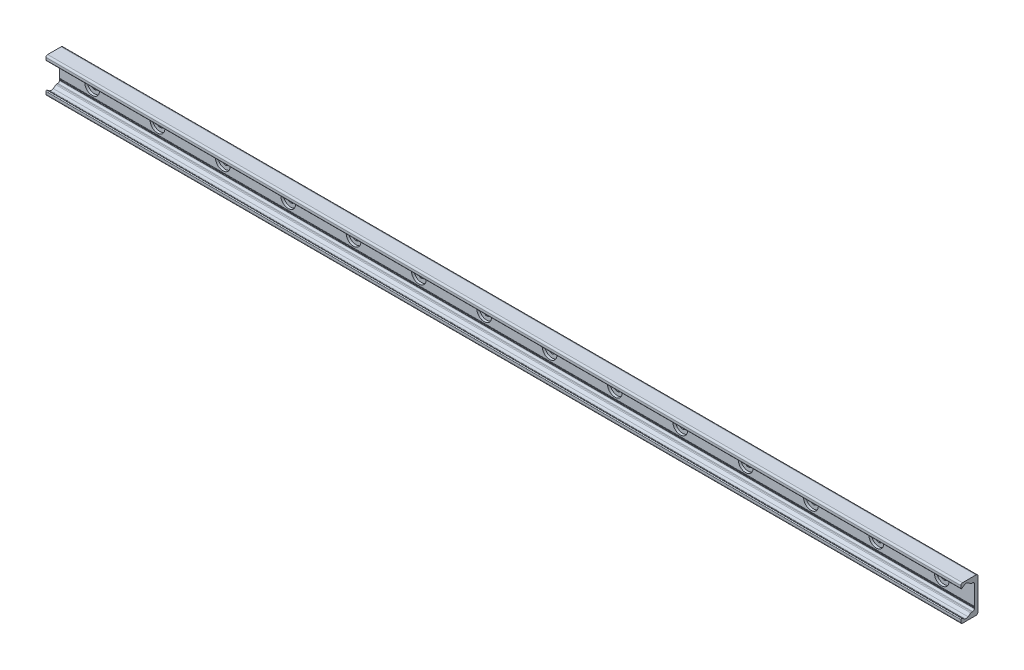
ISO-10303-21;
HEADER;
FILE_DESCRIPTION(('STEP AP214'),'2;1');
FILE_NAME('part.step','',(''),(''),'','','');
FILE_SCHEMA(('AUTOMOTIVE_DESIGN { 1 0 10303 214 1 1 1 1 }'));
ENDSEC;
DATA;
#1=APPLICATION_CONTEXT('core data for automotive mechanical design processes');
#2=APPLICATION_PROTOCOL_DEFINITION('international standard','automotive_design',2000,#1);
#3=PRODUCT_CONTEXT('',#1,'mechanical');
#4=PRODUCT('Part','Part','',(#3));
#5=PRODUCT_RELATED_PRODUCT_CATEGORY('part','',(#4));
#6=PRODUCT_DEFINITION_FORMATION('','',#4);
#7=PRODUCT_DEFINITION_CONTEXT('part definition',#1,'design');
#8=PRODUCT_DEFINITION('design','',#6,#7);
#9=PRODUCT_DEFINITION_SHAPE('','',#8);
#10=(LENGTH_UNIT() NAMED_UNIT(*) SI_UNIT(.MILLI.,.METRE.));
#11=(NAMED_UNIT(*) PLANE_ANGLE_UNIT() SI_UNIT($,.RADIAN.));
#12=(NAMED_UNIT(*) SI_UNIT($,.STERADIAN.) SOLID_ANGLE_UNIT());
#13=UNCERTAINTY_MEASURE_WITH_UNIT(LENGTH_MEASURE(1.E-05),#10,'distance_accuracy_value','');
#14=(GEOMETRIC_REPRESENTATION_CONTEXT(3) GLOBAL_UNCERTAINTY_ASSIGNED_CONTEXT((#13)) GLOBAL_UNIT_ASSIGNED_CONTEXT((#10,
#11,#12)) REPRESENTATION_CONTEXT('',''));
#15=CARTESIAN_POINT('',(0.,0.,0.));
#16=DIRECTION('',(0.,0.,1.));
#17=DIRECTION('',(1.,0.,0.));
#18=AXIS2_PLACEMENT_3D('',#15,#16,#17);
#19=CARTESIAN_POINT('',(-520.,0.,1.39999999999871));
#20=DIRECTION('',(0.,0.,1.));
#21=DIRECTION('',(1.,0.,0.));
#22=AXIS2_PLACEMENT_3D('',#19,#20,#21);
#23=PLANE('',#22);
#24=CARTESIAN_POINT('',(-520.,0.,1.39999999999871));
#25=DIRECTION('',(0.,0.,1.));
#26=DIRECTION('',(1.,0.,0.));
#27=AXIS2_PLACEMENT_3D('',#24,#25,#26);
#28=CIRCLE('',#27,4.50000000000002);
#29=CARTESIAN_POINT('',(-515.5,0.,1.39999999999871));
#30=VERTEX_POINT('',#29);
#31=EDGE_CURVE('E569',#30,#30,#28,.T.);
#32=ORIENTED_EDGE('',*,*,#31,.F.);
#33=EDGE_LOOP('',(#32));
#34=FACE_BOUND('',#33,.T.);
#35=CARTESIAN_POINT('',(-520.,0.,1.39999999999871));
#36=DIRECTION('',(0.,0.,1.));
#37=DIRECTION('',(1.,0.,0.));
#38=AXIS2_PLACEMENT_3D('',#35,#36,#37);
#39=CIRCLE('',#38,9.00000000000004);
#40=CARTESIAN_POINT('',(-511.,0.,1.39999999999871));
#41=VERTEX_POINT('',#40);
#42=EDGE_CURVE('E11',#41,#41,#39,.T.);
#43=ORIENTED_EDGE('',*,*,#42,.T.);
#44=EDGE_LOOP('',(#43));
#45=FACE_BOUND('',#44,.T.);
#46=ADVANCED_FACE('F39',(#34,#45),#23,.T.);
#47=CARTESIAN_POINT('',(-520.,0.,1.39999999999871));
#48=DIRECTION('',(0.,0.,1.));
#49=DIRECTION('',(1.,0.,0.));
#50=AXIS2_PLACEMENT_3D('',#47,#48,#49);
#51=CYLINDRICAL_SURFACE('',#50,9.00000000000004);
#52=CARTESIAN_POINT('',(-520.,0.,4.49999999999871));
#53=DIRECTION('',(0.,0.,1.));
#54=DIRECTION('',(1.,0.,0.));
#55=AXIS2_PLACEMENT_3D('',#52,#53,#54);
#56=CIRCLE('',#55,9.00000000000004);
#57=CARTESIAN_POINT('',(-511.,0.,4.49999999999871));
#58=VERTEX_POINT('',#57);
#59=EDGE_CURVE('E49',#58,#58,#56,.T.);
#60=CARTESIAN_POINT('',(-511.,0.,1.39999999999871));
#61=CARTESIAN_POINT('',(-511.,0.,1.43229166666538));
#62=CARTESIAN_POINT('',(-511.,0.,1.46458333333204));
#63=CARTESIAN_POINT('',(-511.,0.,1.52916666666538));
#64=CARTESIAN_POINT('',(-511.,0.,1.56145833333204));
#65=CARTESIAN_POINT('',(-511.,0.,1.62604166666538));
#66=CARTESIAN_POINT('',(-511.,0.,1.65833333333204));
#67=CARTESIAN_POINT('',(-511.,0.,1.72291666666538));
#68=CARTESIAN_POINT('',(-511.,0.,1.75520833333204));
#69=CARTESIAN_POINT('',(-511.,0.,1.81979166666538));
#70=CARTESIAN_POINT('',(-511.,0.,1.85208333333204));
#71=CARTESIAN_POINT('',(-511.,0.,1.91666666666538));
#72=CARTESIAN_POINT('',(-511.,0.,1.94895833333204));
#73=CARTESIAN_POINT('',(-511.,0.,2.01354166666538));
#74=CARTESIAN_POINT('',(-511.,0.,2.04583333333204));
#75=CARTESIAN_POINT('',(-511.,0.,2.11041666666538));
#76=CARTESIAN_POINT('',(-511.,0.,2.14270833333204));
#77=CARTESIAN_POINT('',(-511.,0.,2.20729166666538));
#78=CARTESIAN_POINT('',(-511.,0.,2.23958333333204));
#79=CARTESIAN_POINT('',(-511.,0.,2.30416666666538));
#80=CARTESIAN_POINT('',(-511.,0.,2.33645833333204));
#81=CARTESIAN_POINT('',(-511.,0.,2.40104166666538));
#82=CARTESIAN_POINT('',(-511.,0.,2.43333333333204));
#83=CARTESIAN_POINT('',(-511.,0.,2.49791666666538));
#84=CARTESIAN_POINT('',(-511.,0.,2.53020833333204));
#85=CARTESIAN_POINT('',(-511.,0.,2.59479166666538));
#86=CARTESIAN_POINT('',(-511.,0.,2.62708333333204));
#87=CARTESIAN_POINT('',(-511.,0.,2.69166666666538));
#88=CARTESIAN_POINT('',(-511.,0.,2.72395833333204));
#89=CARTESIAN_POINT('',(-511.,0.,2.78854166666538));
#90=CARTESIAN_POINT('',(-511.,0.,2.82083333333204));
#91=CARTESIAN_POINT('',(-511.,0.,2.88541666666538));
#92=CARTESIAN_POINT('',(-511.,0.,2.91770833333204));
#93=CARTESIAN_POINT('',(-511.,0.,2.98229166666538));
#94=CARTESIAN_POINT('',(-511.,0.,3.01458333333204));
#95=CARTESIAN_POINT('',(-511.,0.,3.07916666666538));
#96=CARTESIAN_POINT('',(-511.,0.,3.11145833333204));
#97=CARTESIAN_POINT('',(-511.,0.,3.17604166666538));
#98=CARTESIAN_POINT('',(-511.,0.,3.20833333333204));
#99=CARTESIAN_POINT('',(-511.,0.,3.27291666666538));
#100=CARTESIAN_POINT('',(-511.,0.,3.30520833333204));
#101=CARTESIAN_POINT('',(-511.,0.,3.36979166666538));
#102=CARTESIAN_POINT('',(-511.,0.,3.40208333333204));
#103=CARTESIAN_POINT('',(-511.,0.,3.46666666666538));
#104=CARTESIAN_POINT('',(-511.,0.,3.49895833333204));
#105=CARTESIAN_POINT('',(-511.,0.,3.56354166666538));
#106=CARTESIAN_POINT('',(-511.,0.,3.59583333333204));
#107=CARTESIAN_POINT('',(-511.,0.,3.66041666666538));
#108=CARTESIAN_POINT('',(-511.,0.,3.69270833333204));
#109=CARTESIAN_POINT('',(-511.,0.,3.75729166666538));
#110=CARTESIAN_POINT('',(-511.,0.,3.78958333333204));
#111=CARTESIAN_POINT('',(-511.,0.,3.85416666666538));
#112=CARTESIAN_POINT('',(-511.,0.,3.88645833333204));
#113=CARTESIAN_POINT('',(-511.,0.,3.95104166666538));
#114=CARTESIAN_POINT('',(-511.,0.,3.98333333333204));
#115=CARTESIAN_POINT('',(-511.,0.,4.04791666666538));
#116=CARTESIAN_POINT('',(-511.,0.,4.08020833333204));
#117=CARTESIAN_POINT('',(-511.,0.,4.14479166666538));
#118=CARTESIAN_POINT('',(-511.,0.,4.17708333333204));
#119=CARTESIAN_POINT('',(-511.,0.,4.24166666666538));
#120=CARTESIAN_POINT('',(-511.,0.,4.27395833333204));
#121=CARTESIAN_POINT('',(-511.,0.,4.33854166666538));
#122=CARTESIAN_POINT('',(-511.,0.,4.37083333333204));
#123=CARTESIAN_POINT('',(-511.,0.,4.43541666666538));
#124=CARTESIAN_POINT('',(-511.,0.,4.46770833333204));
#125=CARTESIAN_POINT('',(-511.,0.,4.49999999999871));
#126=B_SPLINE_CURVE_WITH_KNOTS('',3,(#60,#61,#62,#63,#64,#65,#66,#67,#68,#69,#70,#71,#72,#73,
#74,#75,#76,#77,#78,#79,#80,#81,#82,#83,#84,#85,#86,#87,#88,#89,#90,#91,#92,#93,#94,#95,#96,#97,
#98,#99,#100,#101,#102,#103,#104,#105,#106,#107,#108,#109,#110,#111,#112,#113,#114,#115,#116,
#117,#118,#119,#120,#121,#122,#123,#124,#125),.UNSPECIFIED.,.F.,.F.,(4,2,2,2,2,2,2,2,2,2,2,2,2,
2,2,2,2,2,2,2,2,2,2,2,2,2,2,2,2,2,2,2,4),(0.,0.0968750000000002,0.19375,0.290625,0.3875,
0.484375,0.58125,0.678125,0.775,0.871875,0.96875,1.065625,1.1625,1.259375,1.35625,1.453125,1.55,
1.646875,1.74375,1.840625,1.9375,2.034375,2.13125,2.228125,2.325,2.421875,2.51875,2.615625,
2.7125,2.809375,2.90625,3.003125,3.1),.UNSPECIFIED.);
#127=EDGE_CURVE('BSEAM539',#41,#58,#126,.T.);
#128=ORIENTED_EDGE('',*,*,#42,.F.);
#129=ORIENTED_EDGE('',*,*,#59,.T.);
#130=ORIENTED_EDGE('',*,*,#127,.T.);
#131=ORIENTED_EDGE('',*,*,#127,.F.);
#132=EDGE_LOOP('',(#128,#130,#129,#131));
#133=FACE_BOUND('',#132,.T.);
#134=ADVANCED_FACE('F539',(#133),#51,.F.);
#135=CARTESIAN_POINT('',(-440.,0.,1.39999999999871));
#136=DIRECTION('',(0.,0.,1.));
#137=DIRECTION('',(1.,0.,0.));
#138=AXIS2_PLACEMENT_3D('',#135,#136,#137);
#139=PLANE('',#138);
#140=CARTESIAN_POINT('',(-440.,0.,1.39999999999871));
#141=DIRECTION('',(0.,0.,1.));
#142=DIRECTION('',(1.,0.,0.));
#143=AXIS2_PLACEMENT_3D('',#140,#141,#142);
#144=CIRCLE('',#143,4.50000000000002);
#145=CARTESIAN_POINT('',(-435.5,0.,1.39999999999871));
#146=VERTEX_POINT('',#145);
#147=EDGE_CURVE('E573',#146,#146,#144,.T.);
#148=ORIENTED_EDGE('',*,*,#147,.F.);
#149=EDGE_LOOP('',(#148));
#150=FACE_BOUND('',#149,.T.);
#151=CARTESIAN_POINT('',(-440.,0.,1.39999999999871));
#152=DIRECTION('',(0.,0.,1.));
#153=DIRECTION('',(1.,0.,0.));
#154=AXIS2_PLACEMENT_3D('',#151,#152,#153);
#155=CIRCLE('',#154,9.00000000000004);
#156=CARTESIAN_POINT('',(-431.,0.,1.39999999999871));
#157=VERTEX_POINT('',#156);
#158=EDGE_CURVE('E530',#157,#157,#155,.T.);
#159=ORIENTED_EDGE('',*,*,#158,.T.);
#160=EDGE_LOOP('',(#159));
#161=FACE_BOUND('',#160,.T.);
#162=ADVANCED_FACE('F564',(#150,#161),#139,.T.);
#163=CARTESIAN_POINT('',(-440.,0.,1.39999999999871));
#164=DIRECTION('',(0.,0.,1.));
#165=DIRECTION('',(1.,0.,0.));
#166=AXIS2_PLACEMENT_3D('',#163,#164,#165);
#167=CYLINDRICAL_SURFACE('',#166,9.00000000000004);
#168=CARTESIAN_POINT('',(-440.,0.,4.49999999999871));
#169=DIRECTION('',(0.,0.,1.));
#170=DIRECTION('',(1.,0.,0.));
#171=AXIS2_PLACEMENT_3D('',#168,#169,#170);
#172=CIRCLE('',#171,9.00000000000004);
#173=CARTESIAN_POINT('',(-431.,0.,4.49999999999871));
#174=VERTEX_POINT('',#173);
#175=EDGE_CURVE('E526',#174,#174,#172,.T.);
#176=CARTESIAN_POINT('',(-431.,0.,1.39999999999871));
#177=CARTESIAN_POINT('',(-431.,0.,1.43229166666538));
#178=CARTESIAN_POINT('',(-431.,0.,1.46458333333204));
#179=CARTESIAN_POINT('',(-431.,0.,1.52916666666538));
#180=CARTESIAN_POINT('',(-431.,0.,1.56145833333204));
#181=CARTESIAN_POINT('',(-431.,0.,1.62604166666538));
#182=CARTESIAN_POINT('',(-431.,0.,1.65833333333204));
#183=CARTESIAN_POINT('',(-431.,0.,1.72291666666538));
#184=CARTESIAN_POINT('',(-431.,0.,1.75520833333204));
#185=CARTESIAN_POINT('',(-431.,0.,1.81979166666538));
#186=CARTESIAN_POINT('',(-431.,0.,1.85208333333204));
#187=CARTESIAN_POINT('',(-431.,0.,1.91666666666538));
#188=CARTESIAN_POINT('',(-431.,0.,1.94895833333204));
#189=CARTESIAN_POINT('',(-431.,0.,2.01354166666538));
#190=CARTESIAN_POINT('',(-431.,0.,2.04583333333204));
#191=CARTESIAN_POINT('',(-431.,0.,2.11041666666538));
#192=CARTESIAN_POINT('',(-431.,0.,2.14270833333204));
#193=CARTESIAN_POINT('',(-431.,0.,2.20729166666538));
#194=CARTESIAN_POINT('',(-431.,0.,2.23958333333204));
#195=CARTESIAN_POINT('',(-431.,0.,2.30416666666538));
#196=CARTESIAN_POINT('',(-431.,0.,2.33645833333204));
#197=CARTESIAN_POINT('',(-431.,0.,2.40104166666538));
#198=CARTESIAN_POINT('',(-431.,0.,2.43333333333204));
#199=CARTESIAN_POINT('',(-431.,0.,2.49791666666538));
#200=CARTESIAN_POINT('',(-431.,0.,2.53020833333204));
#201=CARTESIAN_POINT('',(-431.,0.,2.59479166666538));
#202=CARTESIAN_POINT('',(-431.,0.,2.62708333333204));
#203=CARTESIAN_POINT('',(-431.,0.,2.69166666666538));
#204=CARTESIAN_POINT('',(-431.,0.,2.72395833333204));
#205=CARTESIAN_POINT('',(-431.,0.,2.78854166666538));
#206=CARTESIAN_POINT('',(-431.,0.,2.82083333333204));
#207=CARTESIAN_POINT('',(-431.,0.,2.88541666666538));
#208=CARTESIAN_POINT('',(-431.,0.,2.91770833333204));
#209=CARTESIAN_POINT('',(-431.,0.,2.98229166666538));
#210=CARTESIAN_POINT('',(-431.,0.,3.01458333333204));
#211=CARTESIAN_POINT('',(-431.,0.,3.07916666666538));
#212=CARTESIAN_POINT('',(-431.,0.,3.11145833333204));
#213=CARTESIAN_POINT('',(-431.,0.,3.17604166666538));
#214=CARTESIAN_POINT('',(-431.,0.,3.20833333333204));
#215=CARTESIAN_POINT('',(-431.,0.,3.27291666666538));
#216=CARTESIAN_POINT('',(-431.,0.,3.30520833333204));
#217=CARTESIAN_POINT('',(-431.,0.,3.36979166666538));
#218=CARTESIAN_POINT('',(-431.,0.,3.40208333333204));
#219=CARTESIAN_POINT('',(-431.,0.,3.46666666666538));
#220=CARTESIAN_POINT('',(-431.,0.,3.49895833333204));
#221=CARTESIAN_POINT('',(-431.,0.,3.56354166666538));
#222=CARTESIAN_POINT('',(-431.,0.,3.59583333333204));
#223=CARTESIAN_POINT('',(-431.,0.,3.66041666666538));
#224=CARTESIAN_POINT('',(-431.,0.,3.69270833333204));
#225=CARTESIAN_POINT('',(-431.,0.,3.75729166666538));
#226=CARTESIAN_POINT('',(-431.,0.,3.78958333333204));
#227=CARTESIAN_POINT('',(-431.,0.,3.85416666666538));
#228=CARTESIAN_POINT('',(-431.,0.,3.88645833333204));
#229=CARTESIAN_POINT('',(-431.,0.,3.95104166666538));
#230=CARTESIAN_POINT('',(-431.,0.,3.98333333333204));
#231=CARTESIAN_POINT('',(-431.,0.,4.04791666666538));
#232=CARTESIAN_POINT('',(-431.,0.,4.08020833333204));
#233=CARTESIAN_POINT('',(-431.,0.,4.14479166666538));
#234=CARTESIAN_POINT('',(-431.,0.,4.17708333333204));
#235=CARTESIAN_POINT('',(-431.,0.,4.24166666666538));
#236=CARTESIAN_POINT('',(-431.,0.,4.27395833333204));
#237=CARTESIAN_POINT('',(-431.,0.,4.33854166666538));
#238=CARTESIAN_POINT('',(-431.,0.,4.37083333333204));
#239=CARTESIAN_POINT('',(-431.,0.,4.43541666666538));
#240=CARTESIAN_POINT('',(-431.,0.,4.46770833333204));
#241=CARTESIAN_POINT('',(-431.,0.,4.49999999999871));
#242=B_SPLINE_CURVE_WITH_KNOTS('',3,(#176,#177,#178,#179,#180,#181,#182,#183,#184,#185,#186,
#187,#188,#189,#190,#191,#192,#193,#194,#195,#196,#197,#198,#199,#200,#201,#202,#203,#204,#205,
#206,#207,#208,#209,#210,#211,#212,#213,#214,#215,#216,#217,#218,#219,#220,#221,#222,#223,#224,
#225,#226,#227,#228,#229,#230,#231,#232,#233,#234,#235,#236,#237,#238,#239,#240,#241),
.UNSPECIFIED.,.F.,.F.,(4,2,2,2,2,2,2,2,2,2,2,2,2,2,2,2,2,2,2,2,2,2,2,2,2,2,2,2,2,2,2,2,4),(0.,
0.0968750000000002,0.19375,0.290625,0.3875,0.484375,0.58125,0.678125,0.775,0.871875,0.96875,
1.065625,1.1625,1.259375,1.35625,1.453125,1.55,1.646875,1.74375,1.840625,1.9375,2.034375,
2.13125,2.228125,2.325,2.421875,2.51875,2.615625,2.7125,2.809375,2.90625,3.003125,3.1),.UNSPECIFIED.);
#243=EDGE_CURVE('BSEAM1044',#157,#174,#242,.T.);
#244=ORIENTED_EDGE('',*,*,#158,.F.);
#245=ORIENTED_EDGE('',*,*,#175,.T.);
#246=ORIENTED_EDGE('',*,*,#243,.T.);
#247=ORIENTED_EDGE('',*,*,#243,.F.);
#248=EDGE_LOOP('',(#244,#246,#245,#247));
#249=FACE_BOUND('',#248,.T.);
#250=ADVANCED_FACE('F1044',(#249),#167,.F.);
#251=CARTESIAN_POINT('',(-360.,0.,1.39999999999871));
#252=DIRECTION('',(0.,0.,1.));
#253=DIRECTION('',(1.,0.,0.));
#254=AXIS2_PLACEMENT_3D('',#251,#252,#253);
#255=PLANE('',#254);
#256=CARTESIAN_POINT('',(-360.,0.,1.39999999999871));
#257=DIRECTION('',(0.,0.,1.));
#258=DIRECTION('',(1.,0.,0.));
#259=AXIS2_PLACEMENT_3D('',#256,#257,#258);
#260=CIRCLE('',#259,4.50000000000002);
#261=CARTESIAN_POINT('',(-355.5,0.,1.39999999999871));
#262=VERTEX_POINT('',#261);
#263=EDGE_CURVE('E578',#262,#262,#260,.T.);
#264=ORIENTED_EDGE('',*,*,#263,.F.);
#265=EDGE_LOOP('',(#264));
#266=FACE_BOUND('',#265,.T.);
#267=CARTESIAN_POINT('',(-360.,0.,1.39999999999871));
#268=DIRECTION('',(0.,0.,1.));
#269=DIRECTION('',(1.,0.,0.));
#270=AXIS2_PLACEMENT_3D('',#267,#268,#269);
#271=CIRCLE('',#270,9.00000000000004);
#272=CARTESIAN_POINT('',(-351.,0.,1.39999999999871));
#273=VERTEX_POINT('',#272);
#274=EDGE_CURVE('E522',#273,#273,#271,.T.);
#275=ORIENTED_EDGE('',*,*,#274,.T.);
#276=EDGE_LOOP('',(#275));
#277=FACE_BOUND('',#276,.T.);
#278=ADVANCED_FACE('F1040',(#266,#277),#255,.T.);
#279=CARTESIAN_POINT('',(-360.,0.,1.39999999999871));
#280=DIRECTION('',(0.,0.,1.));
#281=DIRECTION('',(1.,0.,0.));
#282=AXIS2_PLACEMENT_3D('',#279,#280,#281);
#283=CYLINDRICAL_SURFACE('',#282,9.00000000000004);
#284=CARTESIAN_POINT('',(-360.,0.,4.49999999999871));
#285=DIRECTION('',(0.,0.,1.));
#286=DIRECTION('',(1.,0.,0.));
#287=AXIS2_PLACEMENT_3D('',#284,#285,#286);
#288=CIRCLE('',#287,9.00000000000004);
#289=CARTESIAN_POINT('',(-351.,0.,4.49999999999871));
#290=VERTEX_POINT('',#289);
#291=EDGE_CURVE('E518',#290,#290,#288,.T.);
#292=CARTESIAN_POINT('',(-351.,0.,1.39999999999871));
#293=CARTESIAN_POINT('',(-351.,0.,1.43229166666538));
#294=CARTESIAN_POINT('',(-351.,0.,1.46458333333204));
#295=CARTESIAN_POINT('',(-351.,0.,1.52916666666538));
#296=CARTESIAN_POINT('',(-351.,0.,1.56145833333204));
#297=CARTESIAN_POINT('',(-351.,0.,1.62604166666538));
#298=CARTESIAN_POINT('',(-351.,0.,1.65833333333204));
#299=CARTESIAN_POINT('',(-351.,0.,1.72291666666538));
#300=CARTESIAN_POINT('',(-351.,0.,1.75520833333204));
#301=CARTESIAN_POINT('',(-351.,0.,1.81979166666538));
#302=CARTESIAN_POINT('',(-351.,0.,1.85208333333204));
#303=CARTESIAN_POINT('',(-351.,0.,1.91666666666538));
#304=CARTESIAN_POINT('',(-351.,0.,1.94895833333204));
#305=CARTESIAN_POINT('',(-351.,0.,2.01354166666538));
#306=CARTESIAN_POINT('',(-351.,0.,2.04583333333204));
#307=CARTESIAN_POINT('',(-351.,0.,2.11041666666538));
#308=CARTESIAN_POINT('',(-351.,0.,2.14270833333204));
#309=CARTESIAN_POINT('',(-351.,0.,2.20729166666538));
#310=CARTESIAN_POINT('',(-351.,0.,2.23958333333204));
#311=CARTESIAN_POINT('',(-351.,0.,2.30416666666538));
#312=CARTESIAN_POINT('',(-351.,0.,2.33645833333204));
#313=CARTESIAN_POINT('',(-351.,0.,2.40104166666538));
#314=CARTESIAN_POINT('',(-351.,0.,2.43333333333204));
#315=CARTESIAN_POINT('',(-351.,0.,2.49791666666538));
#316=CARTESIAN_POINT('',(-351.,0.,2.53020833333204));
#317=CARTESIAN_POINT('',(-351.,0.,2.59479166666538));
#318=CARTESIAN_POINT('',(-351.,0.,2.62708333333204));
#319=CARTESIAN_POINT('',(-351.,0.,2.69166666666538));
#320=CARTESIAN_POINT('',(-351.,0.,2.72395833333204));
#321=CARTESIAN_POINT('',(-351.,0.,2.78854166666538));
#322=CARTESIAN_POINT('',(-351.,0.,2.82083333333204));
#323=CARTESIAN_POINT('',(-351.,0.,2.88541666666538));
#324=CARTESIAN_POINT('',(-351.,0.,2.91770833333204));
#325=CARTESIAN_POINT('',(-351.,0.,2.98229166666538));
#326=CARTESIAN_POINT('',(-351.,0.,3.01458333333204));
#327=CARTESIAN_POINT('',(-351.,0.,3.07916666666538));
#328=CARTESIAN_POINT('',(-351.,0.,3.11145833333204));
#329=CARTESIAN_POINT('',(-351.,0.,3.17604166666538));
#330=CARTESIAN_POINT('',(-351.,0.,3.20833333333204));
#331=CARTESIAN_POINT('',(-351.,0.,3.27291666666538));
#332=CARTESIAN_POINT('',(-351.,0.,3.30520833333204));
#333=CARTESIAN_POINT('',(-351.,0.,3.36979166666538));
#334=CARTESIAN_POINT('',(-351.,0.,3.40208333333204));
#335=CARTESIAN_POINT('',(-351.,0.,3.46666666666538));
#336=CARTESIAN_POINT('',(-351.,0.,3.49895833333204));
#337=CARTESIAN_POINT('',(-351.,0.,3.56354166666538));
#338=CARTESIAN_POINT('',(-351.,0.,3.59583333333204));
#339=CARTESIAN_POINT('',(-351.,0.,3.66041666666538));
#340=CARTESIAN_POINT('',(-351.,0.,3.69270833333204));
#341=CARTESIAN_POINT('',(-351.,0.,3.75729166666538));
#342=CARTESIAN_POINT('',(-351.,0.,3.78958333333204));
#343=CARTESIAN_POINT('',(-351.,0.,3.85416666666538));
#344=CARTESIAN_POINT('',(-351.,0.,3.88645833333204));
#345=CARTESIAN_POINT('',(-351.,0.,3.95104166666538));
#346=CARTESIAN_POINT('',(-351.,0.,3.98333333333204));
#347=CARTESIAN_POINT('',(-351.,0.,4.04791666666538));
#348=CARTESIAN_POINT('',(-351.,0.,4.08020833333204));
#349=CARTESIAN_POINT('',(-351.,0.,4.14479166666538));
#350=CARTESIAN_POINT('',(-351.,0.,4.17708333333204));
#351=CARTESIAN_POINT('',(-351.,0.,4.24166666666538));
#352=CARTESIAN_POINT('',(-351.,0.,4.27395833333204));
#353=CARTESIAN_POINT('',(-351.,0.,4.33854166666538));
#354=CARTESIAN_POINT('',(-351.,0.,4.37083333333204));
#355=CARTESIAN_POINT('',(-351.,0.,4.43541666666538));
#356=CARTESIAN_POINT('',(-351.,0.,4.46770833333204));
#357=CARTESIAN_POINT('',(-351.,0.,4.49999999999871));
#358=B_SPLINE_CURVE_WITH_KNOTS('',3,(#292,#293,#294,#295,#296,#297,#298,#299,#300,#301,#302,
#303,#304,#305,#306,#307,#308,#309,#310,#311,#312,#313,#314,#315,#316,#317,#318,#319,#320,#321,
#322,#323,#324,#325,#326,#327,#328,#329,#330,#331,#332,#333,#334,#335,#336,#337,#338,#339,#340,
#341,#342,#343,#344,#345,#346,#347,#348,#349,#350,#351,#352,#353,#354,#355,#356,#357),
.UNSPECIFIED.,.F.,.F.,(4,2,2,2,2,2,2,2,2,2,2,2,2,2,2,2,2,2,2,2,2,2,2,2,2,2,2,2,2,2,2,2,4),(0.,
0.0968750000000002,0.19375,0.290625,0.3875,0.484375,0.58125,0.678125,0.775,0.871875,0.96875,
1.065625,1.1625,1.259375,1.35625,1.453125,1.55,1.646875,1.74375,1.840625,1.9375,2.034375,
2.13125,2.228125,2.325,2.421875,2.51875,2.615625,2.7125,2.809375,2.90625,3.003125,3.1),.UNSPECIFIED.);
#359=EDGE_CURVE('BSEAM1036',#273,#290,#358,.T.);
#360=ORIENTED_EDGE('',*,*,#274,.F.);
#361=ORIENTED_EDGE('',*,*,#291,.T.);
#362=ORIENTED_EDGE('',*,*,#359,.T.);
#363=ORIENTED_EDGE('',*,*,#359,.F.);
#364=EDGE_LOOP('',(#360,#362,#361,#363));
#365=FACE_BOUND('',#364,.T.);
#366=ADVANCED_FACE('F1036',(#365),#283,.F.);
#367=CARTESIAN_POINT('',(-280.,0.,1.39999999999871));
#368=DIRECTION('',(0.,0.,1.));
#369=DIRECTION('',(1.,0.,0.));
#370=AXIS2_PLACEMENT_3D('',#367,#368,#369);
#371=PLANE('',#370);
#372=CARTESIAN_POINT('',(-280.,0.,1.39999999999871));
#373=DIRECTION('',(0.,0.,1.));
#374=DIRECTION('',(1.,0.,0.));
#375=AXIS2_PLACEMENT_3D('',#372,#373,#374);
#376=CIRCLE('',#375,4.50000000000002);
#377=CARTESIAN_POINT('',(-275.5,0.,1.39999999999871));
#378=VERTEX_POINT('',#377);
#379=EDGE_CURVE('E590',#378,#378,#376,.T.);
#380=ORIENTED_EDGE('',*,*,#379,.F.);
#381=EDGE_LOOP('',(#380));
#382=FACE_BOUND('',#381,.T.);
#383=CARTESIAN_POINT('',(-280.,0.,1.39999999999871));
#384=DIRECTION('',(0.,0.,1.));
#385=DIRECTION('',(1.,0.,0.));
#386=AXIS2_PLACEMENT_3D('',#383,#384,#385);
#387=CIRCLE('',#386,9.00000000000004);
#388=CARTESIAN_POINT('',(-271.,0.,1.39999999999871));
#389=VERTEX_POINT('',#388);
#390=EDGE_CURVE('E514',#389,#389,#387,.T.);
#391=ORIENTED_EDGE('',*,*,#390,.T.);
#392=EDGE_LOOP('',(#391));
#393=FACE_BOUND('',#392,.T.);
#394=ADVANCED_FACE('F1032',(#382,#393),#371,.T.);
#395=CARTESIAN_POINT('',(-280.,0.,1.39999999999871));
#396=DIRECTION('',(0.,0.,1.));
#397=DIRECTION('',(1.,0.,0.));
#398=AXIS2_PLACEMENT_3D('',#395,#396,#397);
#399=CYLINDRICAL_SURFACE('',#398,9.00000000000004);
#400=CARTESIAN_POINT('',(-280.,0.,4.49999999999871));
#401=DIRECTION('',(0.,0.,1.));
#402=DIRECTION('',(1.,0.,0.));
#403=AXIS2_PLACEMENT_3D('',#400,#401,#402);
#404=CIRCLE('',#403,9.00000000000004);
#405=CARTESIAN_POINT('',(-271.,0.,4.49999999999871));
#406=VERTEX_POINT('',#405);
#407=EDGE_CURVE('E510',#406,#406,#404,.T.);
#408=CARTESIAN_POINT('',(-271.,0.,1.39999999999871));
#409=CARTESIAN_POINT('',(-271.,0.,1.43229166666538));
#410=CARTESIAN_POINT('',(-271.,0.,1.46458333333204));
#411=CARTESIAN_POINT('',(-271.,0.,1.52916666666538));
#412=CARTESIAN_POINT('',(-271.,0.,1.56145833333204));
#413=CARTESIAN_POINT('',(-271.,0.,1.62604166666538));
#414=CARTESIAN_POINT('',(-271.,0.,1.65833333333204));
#415=CARTESIAN_POINT('',(-271.,0.,1.72291666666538));
#416=CARTESIAN_POINT('',(-271.,0.,1.75520833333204));
#417=CARTESIAN_POINT('',(-271.,0.,1.81979166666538));
#418=CARTESIAN_POINT('',(-271.,0.,1.85208333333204));
#419=CARTESIAN_POINT('',(-271.,0.,1.91666666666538));
#420=CARTESIAN_POINT('',(-271.,0.,1.94895833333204));
#421=CARTESIAN_POINT('',(-271.,0.,2.01354166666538));
#422=CARTESIAN_POINT('',(-271.,0.,2.04583333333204));
#423=CARTESIAN_POINT('',(-271.,0.,2.11041666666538));
#424=CARTESIAN_POINT('',(-271.,0.,2.14270833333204));
#425=CARTESIAN_POINT('',(-271.,0.,2.20729166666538));
#426=CARTESIAN_POINT('',(-271.,0.,2.23958333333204));
#427=CARTESIAN_POINT('',(-271.,0.,2.30416666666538));
#428=CARTESIAN_POINT('',(-271.,0.,2.33645833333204));
#429=CARTESIAN_POINT('',(-271.,0.,2.40104166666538));
#430=CARTESIAN_POINT('',(-271.,0.,2.43333333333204));
#431=CARTESIAN_POINT('',(-271.,0.,2.49791666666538));
#432=CARTESIAN_POINT('',(-271.,0.,2.53020833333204));
#433=CARTESIAN_POINT('',(-271.,0.,2.59479166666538));
#434=CARTESIAN_POINT('',(-271.,0.,2.62708333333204));
#435=CARTESIAN_POINT('',(-271.,0.,2.69166666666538));
#436=CARTESIAN_POINT('',(-271.,0.,2.72395833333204));
#437=CARTESIAN_POINT('',(-271.,0.,2.78854166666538));
#438=CARTESIAN_POINT('',(-271.,0.,2.82083333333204));
#439=CARTESIAN_POINT('',(-271.,0.,2.88541666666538));
#440=CARTESIAN_POINT('',(-271.,0.,2.91770833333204));
#441=CARTESIAN_POINT('',(-271.,0.,2.98229166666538));
#442=CARTESIAN_POINT('',(-271.,0.,3.01458333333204));
#443=CARTESIAN_POINT('',(-271.,0.,3.07916666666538));
#444=CARTESIAN_POINT('',(-271.,0.,3.11145833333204));
#445=CARTESIAN_POINT('',(-271.,0.,3.17604166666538));
#446=CARTESIAN_POINT('',(-271.,0.,3.20833333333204));
#447=CARTESIAN_POINT('',(-271.,0.,3.27291666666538));
#448=CARTESIAN_POINT('',(-271.,0.,3.30520833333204));
#449=CARTESIAN_POINT('',(-271.,0.,3.36979166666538));
#450=CARTESIAN_POINT('',(-271.,0.,3.40208333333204));
#451=CARTESIAN_POINT('',(-271.,0.,3.46666666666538));
#452=CARTESIAN_POINT('',(-271.,0.,3.49895833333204));
#453=CARTESIAN_POINT('',(-271.,0.,3.56354166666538));
#454=CARTESIAN_POINT('',(-271.,0.,3.59583333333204));
#455=CARTESIAN_POINT('',(-271.,0.,3.66041666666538));
#456=CARTESIAN_POINT('',(-271.,0.,3.69270833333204));
#457=CARTESIAN_POINT('',(-271.,0.,3.75729166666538));
#458=CARTESIAN_POINT('',(-271.,0.,3.78958333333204));
#459=CARTESIAN_POINT('',(-271.,0.,3.85416666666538));
#460=CARTESIAN_POINT('',(-271.,0.,3.88645833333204));
#461=CARTESIAN_POINT('',(-271.,0.,3.95104166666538));
#462=CARTESIAN_POINT('',(-271.,0.,3.98333333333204));
#463=CARTESIAN_POINT('',(-271.,0.,4.04791666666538));
#464=CARTESIAN_POINT('',(-271.,0.,4.08020833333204));
#465=CARTESIAN_POINT('',(-271.,0.,4.14479166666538));
#466=CARTESIAN_POINT('',(-271.,0.,4.17708333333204));
#467=CARTESIAN_POINT('',(-271.,0.,4.24166666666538));
#468=CARTESIAN_POINT('',(-271.,0.,4.27395833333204));
#469=CARTESIAN_POINT('',(-271.,0.,4.33854166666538));
#470=CARTESIAN_POINT('',(-271.,0.,4.37083333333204));
#471=CARTESIAN_POINT('',(-271.,0.,4.43541666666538));
#472=CARTESIAN_POINT('',(-271.,0.,4.46770833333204));
#473=CARTESIAN_POINT('',(-271.,0.,4.49999999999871));
#474=B_SPLINE_CURVE_WITH_KNOTS('',3,(#408,#409,#410,#411,#412,#413,#414,#415,#416,#417,#418,
#419,#420,#421,#422,#423,#424,#425,#426,#427,#428,#429,#430,#431,#432,#433,#434,#435,#436,#437,
#438,#439,#440,#441,#442,#443,#444,#445,#446,#447,#448,#449,#450,#451,#452,#453,#454,#455,#456,
#457,#458,#459,#460,#461,#462,#463,#464,#465,#466,#467,#468,#469,#470,#471,#472,#473),
.UNSPECIFIED.,.F.,.F.,(4,2,2,2,2,2,2,2,2,2,2,2,2,2,2,2,2,2,2,2,2,2,2,2,2,2,2,2,2,2,2,2,4),(0.,
0.0968750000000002,0.19375,0.290625,0.3875,0.484375,0.58125,0.678125,0.775,0.871875,0.96875,
1.065625,1.1625,1.259375,1.35625,1.453125,1.55,1.646875,1.74375,1.840625,1.9375,2.034375,
2.13125,2.228125,2.325,2.421875,2.51875,2.615625,2.7125,2.809375,2.90625,3.003125,3.1),.UNSPECIFIED.);
#475=EDGE_CURVE('BSEAM1028',#389,#406,#474,.T.);
#476=ORIENTED_EDGE('',*,*,#390,.F.);
#477=ORIENTED_EDGE('',*,*,#407,.T.);
#478=ORIENTED_EDGE('',*,*,#475,.T.);
#479=ORIENTED_EDGE('',*,*,#475,.F.);
#480=EDGE_LOOP('',(#476,#478,#477,#479));
#481=FACE_BOUND('',#480,.T.);
#482=ADVANCED_FACE('F1028',(#481),#399,.F.);
#483=CARTESIAN_POINT('',(-200.,0.,1.39999999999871));
#484=DIRECTION('',(0.,0.,1.));
#485=DIRECTION('',(1.,0.,0.));
#486=AXIS2_PLACEMENT_3D('',#483,#484,#485);
#487=PLANE('',#486);
#488=CARTESIAN_POINT('',(-200.,0.,1.39999999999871));
#489=DIRECTION('',(0.,0.,1.));
#490=DIRECTION('',(1.,0.,0.));
#491=AXIS2_PLACEMENT_3D('',#488,#489,#490);
#492=CIRCLE('',#491,4.50000000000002);
#493=CARTESIAN_POINT('',(-195.5,0.,1.39999999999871));
#494=VERTEX_POINT('',#493);
#495=EDGE_CURVE('E594',#494,#494,#492,.T.);
#496=ORIENTED_EDGE('',*,*,#495,.F.);
#497=EDGE_LOOP('',(#496));
#498=FACE_BOUND('',#497,.T.);
#499=CARTESIAN_POINT('',(-200.,0.,1.39999999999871));
#500=DIRECTION('',(0.,0.,1.));
#501=DIRECTION('',(1.,0.,0.));
#502=AXIS2_PLACEMENT_3D('',#499,#500,#501);
#503=CIRCLE('',#502,9.00000000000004);
#504=CARTESIAN_POINT('',(-191.,0.,1.39999999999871));
#505=VERTEX_POINT('',#504);
#506=EDGE_CURVE('E506',#505,#505,#503,.T.);
#507=ORIENTED_EDGE('',*,*,#506,.T.);
#508=EDGE_LOOP('',(#507));
#509=FACE_BOUND('',#508,.T.);
#510=ADVANCED_FACE('F1024',(#498,#509),#487,.T.);
#511=CARTESIAN_POINT('',(-200.,0.,1.39999999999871));
#512=DIRECTION('',(0.,0.,1.));
#513=DIRECTION('',(1.,0.,0.));
#514=AXIS2_PLACEMENT_3D('',#511,#512,#513);
#515=CYLINDRICAL_SURFACE('',#514,9.00000000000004);
#516=CARTESIAN_POINT('',(-200.,0.,4.49999999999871));
#517=DIRECTION('',(0.,0.,1.));
#518=DIRECTION('',(1.,0.,0.));
#519=AXIS2_PLACEMENT_3D('',#516,#517,#518);
#520=CIRCLE('',#519,9.00000000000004);
#521=CARTESIAN_POINT('',(-191.,0.,4.49999999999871));
#522=VERTEX_POINT('',#521);
#523=EDGE_CURVE('E502',#522,#522,#520,.T.);
#524=CARTESIAN_POINT('',(-191.,0.,1.39999999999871));
#525=CARTESIAN_POINT('',(-191.,0.,1.43229166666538));
#526=CARTESIAN_POINT('',(-191.,0.,1.46458333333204));
#527=CARTESIAN_POINT('',(-191.,0.,1.52916666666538));
#528=CARTESIAN_POINT('',(-191.,0.,1.56145833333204));
#529=CARTESIAN_POINT('',(-191.,0.,1.62604166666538));
#530=CARTESIAN_POINT('',(-191.,0.,1.65833333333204));
#531=CARTESIAN_POINT('',(-191.,0.,1.72291666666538));
#532=CARTESIAN_POINT('',(-191.,0.,1.75520833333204));
#533=CARTESIAN_POINT('',(-191.,0.,1.81979166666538));
#534=CARTESIAN_POINT('',(-191.,0.,1.85208333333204));
#535=CARTESIAN_POINT('',(-191.,0.,1.91666666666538));
#536=CARTESIAN_POINT('',(-191.,0.,1.94895833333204));
#537=CARTESIAN_POINT('',(-191.,0.,2.01354166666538));
#538=CARTESIAN_POINT('',(-191.,0.,2.04583333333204));
#539=CARTESIAN_POINT('',(-191.,0.,2.11041666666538));
#540=CARTESIAN_POINT('',(-191.,0.,2.14270833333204));
#541=CARTESIAN_POINT('',(-191.,0.,2.20729166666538));
#542=CARTESIAN_POINT('',(-191.,0.,2.23958333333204));
#543=CARTESIAN_POINT('',(-191.,0.,2.30416666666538));
#544=CARTESIAN_POINT('',(-191.,0.,2.33645833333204));
#545=CARTESIAN_POINT('',(-191.,0.,2.40104166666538));
#546=CARTESIAN_POINT('',(-191.,0.,2.43333333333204));
#547=CARTESIAN_POINT('',(-191.,0.,2.49791666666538));
#548=CARTESIAN_POINT('',(-191.,0.,2.53020833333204));
#549=CARTESIAN_POINT('',(-191.,0.,2.59479166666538));
#550=CARTESIAN_POINT('',(-191.,0.,2.62708333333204));
#551=CARTESIAN_POINT('',(-191.,0.,2.69166666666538));
#552=CARTESIAN_POINT('',(-191.,0.,2.72395833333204));
#553=CARTESIAN_POINT('',(-191.,0.,2.78854166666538));
#554=CARTESIAN_POINT('',(-191.,0.,2.82083333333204));
#555=CARTESIAN_POINT('',(-191.,0.,2.88541666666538));
#556=CARTESIAN_POINT('',(-191.,0.,2.91770833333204));
#557=CARTESIAN_POINT('',(-191.,0.,2.98229166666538));
#558=CARTESIAN_POINT('',(-191.,0.,3.01458333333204));
#559=CARTESIAN_POINT('',(-191.,0.,3.07916666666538));
#560=CARTESIAN_POINT('',(-191.,0.,3.11145833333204));
#561=CARTESIAN_POINT('',(-191.,0.,3.17604166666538));
#562=CARTESIAN_POINT('',(-191.,0.,3.20833333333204));
#563=CARTESIAN_POINT('',(-191.,0.,3.27291666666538));
#564=CARTESIAN_POINT('',(-191.,0.,3.30520833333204));
#565=CARTESIAN_POINT('',(-191.,0.,3.36979166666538));
#566=CARTESIAN_POINT('',(-191.,0.,3.40208333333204));
#567=CARTESIAN_POINT('',(-191.,0.,3.46666666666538));
#568=CARTESIAN_POINT('',(-191.,0.,3.49895833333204));
#569=CARTESIAN_POINT('',(-191.,0.,3.56354166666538));
#570=CARTESIAN_POINT('',(-191.,0.,3.59583333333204));
#571=CARTESIAN_POINT('',(-191.,0.,3.66041666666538));
#572=CARTESIAN_POINT('',(-191.,0.,3.69270833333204));
#573=CARTESIAN_POINT('',(-191.,0.,3.75729166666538));
#574=CARTESIAN_POINT('',(-191.,0.,3.78958333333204));
#575=CARTESIAN_POINT('',(-191.,0.,3.85416666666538));
#576=CARTESIAN_POINT('',(-191.,0.,3.88645833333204));
#577=CARTESIAN_POINT('',(-191.,0.,3.95104166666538));
#578=CARTESIAN_POINT('',(-191.,0.,3.98333333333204));
#579=CARTESIAN_POINT('',(-191.,0.,4.04791666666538));
#580=CARTESIAN_POINT('',(-191.,0.,4.08020833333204));
#581=CARTESIAN_POINT('',(-191.,0.,4.14479166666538));
#582=CARTESIAN_POINT('',(-191.,0.,4.17708333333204));
#583=CARTESIAN_POINT('',(-191.,0.,4.24166666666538));
#584=CARTESIAN_POINT('',(-191.,0.,4.27395833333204));
#585=CARTESIAN_POINT('',(-191.,0.,4.33854166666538));
#586=CARTESIAN_POINT('',(-191.,0.,4.37083333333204));
#587=CARTESIAN_POINT('',(-191.,0.,4.43541666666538));
#588=CARTESIAN_POINT('',(-191.,0.,4.46770833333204));
#589=CARTESIAN_POINT('',(-191.,0.,4.49999999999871));
#590=B_SPLINE_CURVE_WITH_KNOTS('',3,(#524,#525,#526,#527,#528,#529,#530,#531,#532,#533,#534,
#535,#536,#537,#538,#539,#540,#541,#542,#543,#544,#545,#546,#547,#548,#549,#550,#551,#552,#553,
#554,#555,#556,#557,#558,#559,#560,#561,#562,#563,#564,#565,#566,#567,#568,#569,#570,#571,#572,
#573,#574,#575,#576,#577,#578,#579,#580,#581,#582,#583,#584,#585,#586,#587,#588,#589),
.UNSPECIFIED.,.F.,.F.,(4,2,2,2,2,2,2,2,2,2,2,2,2,2,2,2,2,2,2,2,2,2,2,2,2,2,2,2,2,2,2,2,4),(0.,
0.0968750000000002,0.19375,0.290625,0.3875,0.484375,0.58125,0.678125,0.775,0.871875,0.96875,
1.065625,1.1625,1.259375,1.35625,1.453125,1.55,1.646875,1.74375,1.840625,1.9375,2.034375,
2.13125,2.228125,2.325,2.421875,2.51875,2.615625,2.7125,2.809375,2.90625,3.003125,3.1),.UNSPECIFIED.);
#591=EDGE_CURVE('BSEAM1020',#505,#522,#590,.T.);
#592=ORIENTED_EDGE('',*,*,#506,.F.);
#593=ORIENTED_EDGE('',*,*,#523,.T.);
#594=ORIENTED_EDGE('',*,*,#591,.T.);
#595=ORIENTED_EDGE('',*,*,#591,.F.);
#596=EDGE_LOOP('',(#592,#594,#593,#595));
#597=FACE_BOUND('',#596,.T.);
#598=ADVANCED_FACE('F1020',(#597),#515,.F.);
#599=CARTESIAN_POINT('',(-120.,0.,1.39999999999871));
#600=DIRECTION('',(0.,0.,1.));
#601=DIRECTION('',(1.,0.,0.));
#602=AXIS2_PLACEMENT_3D('',#599,#600,#601);
#603=PLANE('',#602);
#604=CARTESIAN_POINT('',(-120.,0.,1.39999999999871));
#605=DIRECTION('',(0.,0.,1.));
#606=DIRECTION('',(1.,0.,0.));
#607=AXIS2_PLACEMENT_3D('',#604,#605,#606);
#608=CIRCLE('',#607,4.50000000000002);
#609=CARTESIAN_POINT('',(-115.5,0.,1.39999999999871));
#610=VERTEX_POINT('',#609);
#611=EDGE_CURVE('E598',#610,#610,#608,.T.);
#612=ORIENTED_EDGE('',*,*,#611,.F.);
#613=EDGE_LOOP('',(#612));
#614=FACE_BOUND('',#613,.T.);
#615=CARTESIAN_POINT('',(-120.,0.,1.39999999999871));
#616=DIRECTION('',(0.,0.,1.));
#617=DIRECTION('',(1.,0.,0.));
#618=AXIS2_PLACEMENT_3D('',#615,#616,#617);
#619=CIRCLE('',#618,9.00000000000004);
#620=CARTESIAN_POINT('',(-111.,0.,1.39999999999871));
#621=VERTEX_POINT('',#620);
#622=EDGE_CURVE('E498',#621,#621,#619,.T.);
#623=ORIENTED_EDGE('',*,*,#622,.T.);
#624=EDGE_LOOP('',(#623));
#625=FACE_BOUND('',#624,.T.);
#626=ADVANCED_FACE('F1016',(#614,#625),#603,.T.);
#627=CARTESIAN_POINT('',(-120.,0.,1.39999999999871));
#628=DIRECTION('',(0.,0.,1.));
#629=DIRECTION('',(1.,0.,0.));
#630=AXIS2_PLACEMENT_3D('',#627,#628,#629);
#631=CYLINDRICAL_SURFACE('',#630,9.00000000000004);
#632=CARTESIAN_POINT('',(-120.,0.,4.49999999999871));
#633=DIRECTION('',(0.,0.,1.));
#634=DIRECTION('',(1.,0.,0.));
#635=AXIS2_PLACEMENT_3D('',#632,#633,#634);
#636=CIRCLE('',#635,9.00000000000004);
#637=CARTESIAN_POINT('',(-111.,0.,4.49999999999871));
#638=VERTEX_POINT('',#637);
#639=EDGE_CURVE('E494',#638,#638,#636,.T.);
#640=CARTESIAN_POINT('',(-111.,0.,1.39999999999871));
#641=CARTESIAN_POINT('',(-111.,0.,1.43229166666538));
#642=CARTESIAN_POINT('',(-111.,0.,1.46458333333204));
#643=CARTESIAN_POINT('',(-111.,0.,1.52916666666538));
#644=CARTESIAN_POINT('',(-111.,0.,1.56145833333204));
#645=CARTESIAN_POINT('',(-111.,0.,1.62604166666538));
#646=CARTESIAN_POINT('',(-111.,0.,1.65833333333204));
#647=CARTESIAN_POINT('',(-111.,0.,1.72291666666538));
#648=CARTESIAN_POINT('',(-111.,0.,1.75520833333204));
#649=CARTESIAN_POINT('',(-111.,0.,1.81979166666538));
#650=CARTESIAN_POINT('',(-111.,0.,1.85208333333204));
#651=CARTESIAN_POINT('',(-111.,0.,1.91666666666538));
#652=CARTESIAN_POINT('',(-111.,0.,1.94895833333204));
#653=CARTESIAN_POINT('',(-111.,0.,2.01354166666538));
#654=CARTESIAN_POINT('',(-111.,0.,2.04583333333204));
#655=CARTESIAN_POINT('',(-111.,0.,2.11041666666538));
#656=CARTESIAN_POINT('',(-111.,0.,2.14270833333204));
#657=CARTESIAN_POINT('',(-111.,0.,2.20729166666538));
#658=CARTESIAN_POINT('',(-111.,0.,2.23958333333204));
#659=CARTESIAN_POINT('',(-111.,0.,2.30416666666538));
#660=CARTESIAN_POINT('',(-111.,0.,2.33645833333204));
#661=CARTESIAN_POINT('',(-111.,0.,2.40104166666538));
#662=CARTESIAN_POINT('',(-111.,0.,2.43333333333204));
#663=CARTESIAN_POINT('',(-111.,0.,2.49791666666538));
#664=CARTESIAN_POINT('',(-111.,0.,2.53020833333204));
#665=CARTESIAN_POINT('',(-111.,0.,2.59479166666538));
#666=CARTESIAN_POINT('',(-111.,0.,2.62708333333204));
#667=CARTESIAN_POINT('',(-111.,0.,2.69166666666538));
#668=CARTESIAN_POINT('',(-111.,0.,2.72395833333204));
#669=CARTESIAN_POINT('',(-111.,0.,2.78854166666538));
#670=CARTESIAN_POINT('',(-111.,0.,2.82083333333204));
#671=CARTESIAN_POINT('',(-111.,0.,2.88541666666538));
#672=CARTESIAN_POINT('',(-111.,0.,2.91770833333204));
#673=CARTESIAN_POINT('',(-111.,0.,2.98229166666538));
#674=CARTESIAN_POINT('',(-111.,0.,3.01458333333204));
#675=CARTESIAN_POINT('',(-111.,0.,3.07916666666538));
#676=CARTESIAN_POINT('',(-111.,0.,3.11145833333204));
#677=CARTESIAN_POINT('',(-111.,0.,3.17604166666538));
#678=CARTESIAN_POINT('',(-111.,0.,3.20833333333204));
#679=CARTESIAN_POINT('',(-111.,0.,3.27291666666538));
#680=CARTESIAN_POINT('',(-111.,0.,3.30520833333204));
#681=CARTESIAN_POINT('',(-111.,0.,3.36979166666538));
#682=CARTESIAN_POINT('',(-111.,0.,3.40208333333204));
#683=CARTESIAN_POINT('',(-111.,0.,3.46666666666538));
#684=CARTESIAN_POINT('',(-111.,0.,3.49895833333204));
#685=CARTESIAN_POINT('',(-111.,0.,3.56354166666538));
#686=CARTESIAN_POINT('',(-111.,0.,3.59583333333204));
#687=CARTESIAN_POINT('',(-111.,0.,3.66041666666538));
#688=CARTESIAN_POINT('',(-111.,0.,3.69270833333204));
#689=CARTESIAN_POINT('',(-111.,0.,3.75729166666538));
#690=CARTESIAN_POINT('',(-111.,0.,3.78958333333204));
#691=CARTESIAN_POINT('',(-111.,0.,3.85416666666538));
#692=CARTESIAN_POINT('',(-111.,0.,3.88645833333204));
#693=CARTESIAN_POINT('',(-111.,0.,3.95104166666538));
#694=CARTESIAN_POINT('',(-111.,0.,3.98333333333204));
#695=CARTESIAN_POINT('',(-111.,0.,4.04791666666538));
#696=CARTESIAN_POINT('',(-111.,0.,4.08020833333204));
#697=CARTESIAN_POINT('',(-111.,0.,4.14479166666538));
#698=CARTESIAN_POINT('',(-111.,0.,4.17708333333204));
#699=CARTESIAN_POINT('',(-111.,0.,4.24166666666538));
#700=CARTESIAN_POINT('',(-111.,0.,4.27395833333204));
#701=CARTESIAN_POINT('',(-111.,0.,4.33854166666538));
#702=CARTESIAN_POINT('',(-111.,0.,4.37083333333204));
#703=CARTESIAN_POINT('',(-111.,0.,4.43541666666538));
#704=CARTESIAN_POINT('',(-111.,0.,4.46770833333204));
#705=CARTESIAN_POINT('',(-111.,0.,4.49999999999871));
#706=B_SPLINE_CURVE_WITH_KNOTS('',3,(#640,#641,#642,#643,#644,#645,#646,#647,#648,#649,#650,
#651,#652,#653,#654,#655,#656,#657,#658,#659,#660,#661,#662,#663,#664,#665,#666,#667,#668,#669,
#670,#671,#672,#673,#674,#675,#676,#677,#678,#679,#680,#681,#682,#683,#684,#685,#686,#687,#688,
#689,#690,#691,#692,#693,#694,#695,#696,#697,#698,#699,#700,#701,#702,#703,#704,#705),
.UNSPECIFIED.,.F.,.F.,(4,2,2,2,2,2,2,2,2,2,2,2,2,2,2,2,2,2,2,2,2,2,2,2,2,2,2,2,2,2,2,2,4),(0.,
0.0968750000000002,0.19375,0.290625,0.3875,0.484375,0.58125,0.678125,0.775,0.871875,0.96875,
1.065625,1.1625,1.259375,1.35625,1.453125,1.55,1.646875,1.74375,1.840625,1.9375,2.034375,
2.13125,2.228125,2.325,2.421875,2.51875,2.615625,2.7125,2.809375,2.90625,3.003125,3.1),.UNSPECIFIED.);
#707=EDGE_CURVE('BSEAM1012',#621,#638,#706,.T.);
#708=ORIENTED_EDGE('',*,*,#622,.F.);
#709=ORIENTED_EDGE('',*,*,#639,.T.);
#710=ORIENTED_EDGE('',*,*,#707,.T.);
#711=ORIENTED_EDGE('',*,*,#707,.F.);
#712=EDGE_LOOP('',(#708,#710,#709,#711));
#713=FACE_BOUND('',#712,.T.);
#714=ADVANCED_FACE('F1012',(#713),#631,.F.);
#715=CARTESIAN_POINT('',(-40.,0.,1.39999999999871));
#716=DIRECTION('',(0.,0.,1.));
#717=DIRECTION('',(1.,0.,0.));
#718=AXIS2_PLACEMENT_3D('',#715,#716,#717);
#719=PLANE('',#718);
#720=CARTESIAN_POINT('',(-40.,0.,1.39999999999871));
#721=DIRECTION('',(0.,0.,1.));
#722=DIRECTION('',(1.,0.,0.));
#723=AXIS2_PLACEMENT_3D('',#720,#721,#722);
#724=CIRCLE('',#723,4.50000000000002);
#725=CARTESIAN_POINT('',(-35.5,0.,1.39999999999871));
#726=VERTEX_POINT('',#725);
#727=EDGE_CURVE('E602',#726,#726,#724,.T.);
#728=ORIENTED_EDGE('',*,*,#727,.F.);
#729=EDGE_LOOP('',(#728));
#730=FACE_BOUND('',#729,.T.);
#731=CARTESIAN_POINT('',(-40.,0.,1.39999999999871));
#732=DIRECTION('',(0.,0.,1.));
#733=DIRECTION('',(1.,0.,0.));
#734=AXIS2_PLACEMENT_3D('',#731,#732,#733);
#735=CIRCLE('',#734,9.00000000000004);
#736=CARTESIAN_POINT('',(-31.,0.,1.39999999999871));
#737=VERTEX_POINT('',#736);
#738=EDGE_CURVE('E490',#737,#737,#735,.T.);
#739=ORIENTED_EDGE('',*,*,#738,.T.);
#740=EDGE_LOOP('',(#739));
#741=FACE_BOUND('',#740,.T.);
#742=ADVANCED_FACE('F1008',(#730,#741),#719,.T.);
#743=CARTESIAN_POINT('',(-40.,0.,1.39999999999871));
#744=DIRECTION('',(0.,0.,1.));
#745=DIRECTION('',(1.,0.,0.));
#746=AXIS2_PLACEMENT_3D('',#743,#744,#745);
#747=CYLINDRICAL_SURFACE('',#746,9.00000000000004);
#748=CARTESIAN_POINT('',(-40.,0.,4.49999999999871));
#749=DIRECTION('',(0.,0.,1.));
#750=DIRECTION('',(1.,0.,0.));
#751=AXIS2_PLACEMENT_3D('',#748,#749,#750);
#752=CIRCLE('',#751,9.00000000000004);
#753=CARTESIAN_POINT('',(-31.,0.,4.49999999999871));
#754=VERTEX_POINT('',#753);
#755=EDGE_CURVE('E486',#754,#754,#752,.T.);
#756=CARTESIAN_POINT('',(-31.,0.,1.39999999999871));
#757=CARTESIAN_POINT('',(-31.,0.,1.43229166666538));
#758=CARTESIAN_POINT('',(-31.,0.,1.46458333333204));
#759=CARTESIAN_POINT('',(-31.,0.,1.52916666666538));
#760=CARTESIAN_POINT('',(-31.,0.,1.56145833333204));
#761=CARTESIAN_POINT('',(-31.,0.,1.62604166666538));
#762=CARTESIAN_POINT('',(-31.,0.,1.65833333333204));
#763=CARTESIAN_POINT('',(-31.,0.,1.72291666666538));
#764=CARTESIAN_POINT('',(-31.,0.,1.75520833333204));
#765=CARTESIAN_POINT('',(-31.,0.,1.81979166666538));
#766=CARTESIAN_POINT('',(-31.,0.,1.85208333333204));
#767=CARTESIAN_POINT('',(-31.,0.,1.91666666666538));
#768=CARTESIAN_POINT('',(-31.,0.,1.94895833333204));
#769=CARTESIAN_POINT('',(-31.,0.,2.01354166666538));
#770=CARTESIAN_POINT('',(-31.,0.,2.04583333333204));
#771=CARTESIAN_POINT('',(-31.,0.,2.11041666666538));
#772=CARTESIAN_POINT('',(-31.,0.,2.14270833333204));
#773=CARTESIAN_POINT('',(-31.,0.,2.20729166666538));
#774=CARTESIAN_POINT('',(-31.,0.,2.23958333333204));
#775=CARTESIAN_POINT('',(-31.,0.,2.30416666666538));
#776=CARTESIAN_POINT('',(-31.,0.,2.33645833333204));
#777=CARTESIAN_POINT('',(-31.,0.,2.40104166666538));
#778=CARTESIAN_POINT('',(-31.,0.,2.43333333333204));
#779=CARTESIAN_POINT('',(-31.,0.,2.49791666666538));
#780=CARTESIAN_POINT('',(-31.,0.,2.53020833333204));
#781=CARTESIAN_POINT('',(-31.,0.,2.59479166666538));
#782=CARTESIAN_POINT('',(-31.,0.,2.62708333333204));
#783=CARTESIAN_POINT('',(-31.,0.,2.69166666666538));
#784=CARTESIAN_POINT('',(-31.,0.,2.72395833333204));
#785=CARTESIAN_POINT('',(-31.,0.,2.78854166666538));
#786=CARTESIAN_POINT('',(-31.,0.,2.82083333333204));
#787=CARTESIAN_POINT('',(-31.,0.,2.88541666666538));
#788=CARTESIAN_POINT('',(-31.,0.,2.91770833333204));
#789=CARTESIAN_POINT('',(-31.,0.,2.98229166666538));
#790=CARTESIAN_POINT('',(-31.,0.,3.01458333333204));
#791=CARTESIAN_POINT('',(-31.,0.,3.07916666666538));
#792=CARTESIAN_POINT('',(-31.,0.,3.11145833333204));
#793=CARTESIAN_POINT('',(-31.,0.,3.17604166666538));
#794=CARTESIAN_POINT('',(-31.,0.,3.20833333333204));
#795=CARTESIAN_POINT('',(-31.,0.,3.27291666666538));
#796=CARTESIAN_POINT('',(-31.,0.,3.30520833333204));
#797=CARTESIAN_POINT('',(-31.,0.,3.36979166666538));
#798=CARTESIAN_POINT('',(-31.,0.,3.40208333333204));
#799=CARTESIAN_POINT('',(-31.,0.,3.46666666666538));
#800=CARTESIAN_POINT('',(-31.,0.,3.49895833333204));
#801=CARTESIAN_POINT('',(-31.,0.,3.56354166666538));
#802=CARTESIAN_POINT('',(-31.,0.,3.59583333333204));
#803=CARTESIAN_POINT('',(-31.,0.,3.66041666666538));
#804=CARTESIAN_POINT('',(-31.,0.,3.69270833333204));
#805=CARTESIAN_POINT('',(-31.,0.,3.75729166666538));
#806=CARTESIAN_POINT('',(-31.,0.,3.78958333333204));
#807=CARTESIAN_POINT('',(-31.,0.,3.85416666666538));
#808=CARTESIAN_POINT('',(-31.,0.,3.88645833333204));
#809=CARTESIAN_POINT('',(-31.,0.,3.95104166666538));
#810=CARTESIAN_POINT('',(-31.,0.,3.98333333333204));
#811=CARTESIAN_POINT('',(-31.,0.,4.04791666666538));
#812=CARTESIAN_POINT('',(-31.,0.,4.08020833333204));
#813=CARTESIAN_POINT('',(-31.,0.,4.14479166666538));
#814=CARTESIAN_POINT('',(-31.,0.,4.17708333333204));
#815=CARTESIAN_POINT('',(-31.,0.,4.24166666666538));
#816=CARTESIAN_POINT('',(-31.,0.,4.27395833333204));
#817=CARTESIAN_POINT('',(-31.,0.,4.33854166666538));
#818=CARTESIAN_POINT('',(-31.,0.,4.37083333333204));
#819=CARTESIAN_POINT('',(-31.,0.,4.43541666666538));
#820=CARTESIAN_POINT('',(-31.,0.,4.46770833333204));
#821=CARTESIAN_POINT('',(-31.,0.,4.49999999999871));
#822=B_SPLINE_CURVE_WITH_KNOTS('',3,(#756,#757,#758,#759,#760,#761,#762,#763,#764,#765,#766,
#767,#768,#769,#770,#771,#772,#773,#774,#775,#776,#777,#778,#779,#780,#781,#782,#783,#784,#785,
#786,#787,#788,#789,#790,#791,#792,#793,#794,#795,#796,#797,#798,#799,#800,#801,#802,#803,#804,
#805,#806,#807,#808,#809,#810,#811,#812,#813,#814,#815,#816,#817,#818,#819,#820,#821),
.UNSPECIFIED.,.F.,.F.,(4,2,2,2,2,2,2,2,2,2,2,2,2,2,2,2,2,2,2,2,2,2,2,2,2,2,2,2,2,2,2,2,4),(0.,
0.0968750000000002,0.19375,0.290625,0.3875,0.484375,0.58125,0.678125,0.775,0.871875,0.96875,
1.065625,1.1625,1.259375,1.35625,1.453125,1.55,1.646875,1.74375,1.840625,1.9375,2.034375,
2.13125,2.228125,2.325,2.421875,2.51875,2.615625,2.7125,2.809375,2.90625,3.003125,3.1),.UNSPECIFIED.);
#823=EDGE_CURVE('BSEAM1004',#737,#754,#822,.T.);
#824=ORIENTED_EDGE('',*,*,#738,.F.);
#825=ORIENTED_EDGE('',*,*,#755,.T.);
#826=ORIENTED_EDGE('',*,*,#823,.T.);
#827=ORIENTED_EDGE('',*,*,#823,.F.);
#828=EDGE_LOOP('',(#824,#826,#825,#827));
#829=FACE_BOUND('',#828,.T.);
#830=ADVANCED_FACE('F1004',(#829),#747,.F.);
#831=CARTESIAN_POINT('',(40.,0.,1.39999999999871));
#832=DIRECTION('',(0.,0.,1.));
#833=DIRECTION('',(1.,0.,0.));
#834=AXIS2_PLACEMENT_3D('',#831,#832,#833);
#835=PLANE('',#834);
#836=CARTESIAN_POINT('',(40.,0.,1.39999999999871));
#837=DIRECTION('',(0.,0.,1.));
#838=DIRECTION('',(1.,0.,0.));
#839=AXIS2_PLACEMENT_3D('',#836,#837,#838);
#840=CIRCLE('',#839,4.50000000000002);
#841=CARTESIAN_POINT('',(44.5000000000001,0.,1.39999999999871));
#842=VERTEX_POINT('',#841);
#843=EDGE_CURVE('E606',#842,#842,#840,.T.);
#844=ORIENTED_EDGE('',*,*,#843,.F.);
#845=EDGE_LOOP('',(#844));
#846=FACE_BOUND('',#845,.T.);
#847=CARTESIAN_POINT('',(40.,0.,1.39999999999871));
#848=DIRECTION('',(0.,0.,1.));
#849=DIRECTION('',(1.,0.,0.));
#850=AXIS2_PLACEMENT_3D('',#847,#848,#849);
#851=CIRCLE('',#850,9.00000000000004);
#852=CARTESIAN_POINT('',(49.0000000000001,0.,1.39999999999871));
#853=VERTEX_POINT('',#852);
#854=EDGE_CURVE('E482',#853,#853,#851,.T.);
#855=ORIENTED_EDGE('',*,*,#854,.T.);
#856=EDGE_LOOP('',(#855));
#857=FACE_BOUND('',#856,.T.);
#858=ADVANCED_FACE('F1000',(#846,#857),#835,.T.);
#859=CARTESIAN_POINT('',(40.,0.,1.39999999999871));
#860=DIRECTION('',(0.,0.,1.));
#861=DIRECTION('',(1.,0.,0.));
#862=AXIS2_PLACEMENT_3D('',#859,#860,#861);
#863=CYLINDRICAL_SURFACE('',#862,9.00000000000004);
#864=CARTESIAN_POINT('',(40.,0.,4.49999999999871));
#865=DIRECTION('',(0.,0.,1.));
#866=DIRECTION('',(1.,0.,0.));
#867=AXIS2_PLACEMENT_3D('',#864,#865,#866);
#868=CIRCLE('',#867,9.00000000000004);
#869=CARTESIAN_POINT('',(49.0000000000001,0.,4.49999999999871));
#870=VERTEX_POINT('',#869);
#871=EDGE_CURVE('E478',#870,#870,#868,.T.);
#872=CARTESIAN_POINT('',(49.0000000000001,0.,1.39999999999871));
#873=CARTESIAN_POINT('',(49.0000000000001,0.,1.43229166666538));
#874=CARTESIAN_POINT('',(49.0000000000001,0.,1.46458333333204));
#875=CARTESIAN_POINT('',(49.0000000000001,0.,1.52916666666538));
#876=CARTESIAN_POINT('',(49.0000000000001,0.,1.56145833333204));
#877=CARTESIAN_POINT('',(49.0000000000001,0.,1.62604166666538));
#878=CARTESIAN_POINT('',(49.0000000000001,0.,1.65833333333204));
#879=CARTESIAN_POINT('',(49.0000000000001,0.,1.72291666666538));
#880=CARTESIAN_POINT('',(49.0000000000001,0.,1.75520833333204));
#881=CARTESIAN_POINT('',(49.0000000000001,0.,1.81979166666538));
#882=CARTESIAN_POINT('',(49.0000000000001,0.,1.85208333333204));
#883=CARTESIAN_POINT('',(49.0000000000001,0.,1.91666666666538));
#884=CARTESIAN_POINT('',(49.0000000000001,0.,1.94895833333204));
#885=CARTESIAN_POINT('',(49.0000000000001,0.,2.01354166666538));
#886=CARTESIAN_POINT('',(49.0000000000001,0.,2.04583333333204));
#887=CARTESIAN_POINT('',(49.0000000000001,0.,2.11041666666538));
#888=CARTESIAN_POINT('',(49.0000000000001,0.,2.14270833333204));
#889=CARTESIAN_POINT('',(49.0000000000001,0.,2.20729166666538));
#890=CARTESIAN_POINT('',(49.0000000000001,0.,2.23958333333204));
#891=CARTESIAN_POINT('',(49.0000000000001,0.,2.30416666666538));
#892=CARTESIAN_POINT('',(49.0000000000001,0.,2.33645833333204));
#893=CARTESIAN_POINT('',(49.0000000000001,0.,2.40104166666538));
#894=CARTESIAN_POINT('',(49.0000000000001,0.,2.43333333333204));
#895=CARTESIAN_POINT('',(49.0000000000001,0.,2.49791666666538));
#896=CARTESIAN_POINT('',(49.0000000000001,0.,2.53020833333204));
#897=CARTESIAN_POINT('',(49.0000000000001,0.,2.59479166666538));
#898=CARTESIAN_POINT('',(49.0000000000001,0.,2.62708333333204));
#899=CARTESIAN_POINT('',(49.0000000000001,0.,2.69166666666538));
#900=CARTESIAN_POINT('',(49.0000000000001,0.,2.72395833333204));
#901=CARTESIAN_POINT('',(49.0000000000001,0.,2.78854166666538));
#902=CARTESIAN_POINT('',(49.0000000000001,0.,2.82083333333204));
#903=CARTESIAN_POINT('',(49.0000000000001,0.,2.88541666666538));
#904=CARTESIAN_POINT('',(49.0000000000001,0.,2.91770833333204));
#905=CARTESIAN_POINT('',(49.0000000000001,0.,2.98229166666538));
#906=CARTESIAN_POINT('',(49.0000000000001,0.,3.01458333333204));
#907=CARTESIAN_POINT('',(49.0000000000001,0.,3.07916666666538));
#908=CARTESIAN_POINT('',(49.0000000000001,0.,3.11145833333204));
#909=CARTESIAN_POINT('',(49.0000000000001,0.,3.17604166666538));
#910=CARTESIAN_POINT('',(49.0000000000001,0.,3.20833333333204));
#911=CARTESIAN_POINT('',(49.0000000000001,0.,3.27291666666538));
#912=CARTESIAN_POINT('',(49.0000000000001,0.,3.30520833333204));
#913=CARTESIAN_POINT('',(49.0000000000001,0.,3.36979166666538));
#914=CARTESIAN_POINT('',(49.0000000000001,0.,3.40208333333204));
#915=CARTESIAN_POINT('',(49.0000000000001,0.,3.46666666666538));
#916=CARTESIAN_POINT('',(49.0000000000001,0.,3.49895833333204));
#917=CARTESIAN_POINT('',(49.0000000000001,0.,3.56354166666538));
#918=CARTESIAN_POINT('',(49.0000000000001,0.,3.59583333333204));
#919=CARTESIAN_POINT('',(49.0000000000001,0.,3.66041666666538));
#920=CARTESIAN_POINT('',(49.0000000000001,0.,3.69270833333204));
#921=CARTESIAN_POINT('',(49.0000000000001,0.,3.75729166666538));
#922=CARTESIAN_POINT('',(49.0000000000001,0.,3.78958333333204));
#923=CARTESIAN_POINT('',(49.0000000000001,0.,3.85416666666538));
#924=CARTESIAN_POINT('',(49.0000000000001,0.,3.88645833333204));
#925=CARTESIAN_POINT('',(49.0000000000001,0.,3.95104166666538));
#926=CARTESIAN_POINT('',(49.0000000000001,0.,3.98333333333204));
#927=CARTESIAN_POINT('',(49.0000000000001,0.,4.04791666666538));
#928=CARTESIAN_POINT('',(49.0000000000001,0.,4.08020833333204));
#929=CARTESIAN_POINT('',(49.0000000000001,0.,4.14479166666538));
#930=CARTESIAN_POINT('',(49.0000000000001,0.,4.17708333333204));
#931=CARTESIAN_POINT('',(49.0000000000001,0.,4.24166666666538));
#932=CARTESIAN_POINT('',(49.0000000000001,0.,4.27395833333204));
#933=CARTESIAN_POINT('',(49.0000000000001,0.,4.33854166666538));
#934=CARTESIAN_POINT('',(49.0000000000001,0.,4.37083333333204));
#935=CARTESIAN_POINT('',(49.0000000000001,0.,4.43541666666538));
#936=CARTESIAN_POINT('',(49.0000000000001,0.,4.46770833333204));
#937=CARTESIAN_POINT('',(49.0000000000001,0.,4.49999999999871));
#938=B_SPLINE_CURVE_WITH_KNOTS('',3,(#872,#873,#874,#875,#876,#877,#878,#879,#880,#881,#882,
#883,#884,#885,#886,#887,#888,#889,#890,#891,#892,#893,#894,#895,#896,#897,#898,#899,#900,#901,
#902,#903,#904,#905,#906,#907,#908,#909,#910,#911,#912,#913,#914,#915,#916,#917,#918,#919,#920,
#921,#922,#923,#924,#925,#926,#927,#928,#929,#930,#931,#932,#933,#934,#935,#936,#937),
.UNSPECIFIED.,.F.,.F.,(4,2,2,2,2,2,2,2,2,2,2,2,2,2,2,2,2,2,2,2,2,2,2,2,2,2,2,2,2,2,2,2,4),(0.,
0.0968750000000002,0.19375,0.290625,0.3875,0.484375,0.58125,0.678125,0.775,0.871875,0.96875,
1.065625,1.1625,1.259375,1.35625,1.453125,1.55,1.646875,1.74375,1.840625,1.9375,2.034375,
2.13125,2.228125,2.325,2.421875,2.51875,2.615625,2.7125,2.809375,2.90625,3.003125,3.1),.UNSPECIFIED.);
#939=EDGE_CURVE('BSEAM996',#853,#870,#938,.T.);
#940=ORIENTED_EDGE('',*,*,#854,.F.);
#941=ORIENTED_EDGE('',*,*,#871,.T.);
#942=ORIENTED_EDGE('',*,*,#939,.T.);
#943=ORIENTED_EDGE('',*,*,#939,.F.);
#944=EDGE_LOOP('',(#940,#942,#941,#943));
#945=FACE_BOUND('',#944,.T.);
#946=ADVANCED_FACE('F996',(#945),#863,.F.);
#947=CARTESIAN_POINT('',(120.,0.,1.39999999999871));
#948=DIRECTION('',(0.,0.,1.));
#949=DIRECTION('',(1.,0.,0.));
#950=AXIS2_PLACEMENT_3D('',#947,#948,#949);
#951=PLANE('',#950);
#952=CARTESIAN_POINT('',(120.,0.,1.39999999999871));
#953=DIRECTION('',(0.,0.,1.));
#954=DIRECTION('',(1.,0.,0.));
#955=AXIS2_PLACEMENT_3D('',#952,#953,#954);
#956=CIRCLE('',#955,4.50000000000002);
#957=CARTESIAN_POINT('',(124.5,0.,1.39999999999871));
#958=VERTEX_POINT('',#957);
#959=EDGE_CURVE('E610',#958,#958,#956,.T.);
#960=ORIENTED_EDGE('',*,*,#959,.F.);
#961=EDGE_LOOP('',(#960));
#962=FACE_BOUND('',#961,.T.);
#963=CARTESIAN_POINT('',(120.,0.,1.39999999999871));
#964=DIRECTION('',(0.,0.,1.));
#965=DIRECTION('',(1.,0.,0.));
#966=AXIS2_PLACEMENT_3D('',#963,#964,#965);
#967=CIRCLE('',#966,9.00000000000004);
#968=CARTESIAN_POINT('',(129.,0.,1.39999999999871));
#969=VERTEX_POINT('',#968);
#970=EDGE_CURVE('E474',#969,#969,#967,.T.);
#971=ORIENTED_EDGE('',*,*,#970,.T.);
#972=EDGE_LOOP('',(#971));
#973=FACE_BOUND('',#972,.T.);
#974=ADVANCED_FACE('F992',(#962,#973),#951,.T.);
#975=CARTESIAN_POINT('',(120.,0.,1.39999999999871));
#976=DIRECTION('',(0.,0.,1.));
#977=DIRECTION('',(1.,0.,0.));
#978=AXIS2_PLACEMENT_3D('',#975,#976,#977);
#979=CYLINDRICAL_SURFACE('',#978,9.00000000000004);
#980=CARTESIAN_POINT('',(120.,0.,4.49999999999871));
#981=DIRECTION('',(0.,0.,1.));
#982=DIRECTION('',(1.,0.,0.));
#983=AXIS2_PLACEMENT_3D('',#980,#981,#982);
#984=CIRCLE('',#983,9.00000000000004);
#985=CARTESIAN_POINT('',(129.,0.,4.49999999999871));
#986=VERTEX_POINT('',#985);
#987=EDGE_CURVE('E470',#986,#986,#984,.T.);
#988=CARTESIAN_POINT('',(129.,0.,1.39999999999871));
#989=CARTESIAN_POINT('',(129.,0.,1.43229166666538));
#990=CARTESIAN_POINT('',(129.,0.,1.46458333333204));
#991=CARTESIAN_POINT('',(129.,0.,1.52916666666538));
#992=CARTESIAN_POINT('',(129.,0.,1.56145833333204));
#993=CARTESIAN_POINT('',(129.,0.,1.62604166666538));
#994=CARTESIAN_POINT('',(129.,0.,1.65833333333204));
#995=CARTESIAN_POINT('',(129.,0.,1.72291666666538));
#996=CARTESIAN_POINT('',(129.,0.,1.75520833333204));
#997=CARTESIAN_POINT('',(129.,0.,1.81979166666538));
#998=CARTESIAN_POINT('',(129.,0.,1.85208333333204));
#999=CARTESIAN_POINT('',(129.,0.,1.91666666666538));
#1000=CARTESIAN_POINT('',(129.,0.,1.94895833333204));
#1001=CARTESIAN_POINT('',(129.,0.,2.01354166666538));
#1002=CARTESIAN_POINT('',(129.,0.,2.04583333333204));
#1003=CARTESIAN_POINT('',(129.,0.,2.11041666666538));
#1004=CARTESIAN_POINT('',(129.,0.,2.14270833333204));
#1005=CARTESIAN_POINT('',(129.,0.,2.20729166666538));
#1006=CARTESIAN_POINT('',(129.,0.,2.23958333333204));
#1007=CARTESIAN_POINT('',(129.,0.,2.30416666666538));
#1008=CARTESIAN_POINT('',(129.,0.,2.33645833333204));
#1009=CARTESIAN_POINT('',(129.,0.,2.40104166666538));
#1010=CARTESIAN_POINT('',(129.,0.,2.43333333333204));
#1011=CARTESIAN_POINT('',(129.,0.,2.49791666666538));
#1012=CARTESIAN_POINT('',(129.,0.,2.53020833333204));
#1013=CARTESIAN_POINT('',(129.,0.,2.59479166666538));
#1014=CARTESIAN_POINT('',(129.,0.,2.62708333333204));
#1015=CARTESIAN_POINT('',(129.,0.,2.69166666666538));
#1016=CARTESIAN_POINT('',(129.,0.,2.72395833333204));
#1017=CARTESIAN_POINT('',(129.,0.,2.78854166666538));
#1018=CARTESIAN_POINT('',(129.,0.,2.82083333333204));
#1019=CARTESIAN_POINT('',(129.,0.,2.88541666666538));
#1020=CARTESIAN_POINT('',(129.,0.,2.91770833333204));
#1021=CARTESIAN_POINT('',(129.,0.,2.98229166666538));
#1022=CARTESIAN_POINT('',(129.,0.,3.01458333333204));
#1023=CARTESIAN_POINT('',(129.,0.,3.07916666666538));
#1024=CARTESIAN_POINT('',(129.,0.,3.11145833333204));
#1025=CARTESIAN_POINT('',(129.,0.,3.17604166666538));
#1026=CARTESIAN_POINT('',(129.,0.,3.20833333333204));
#1027=CARTESIAN_POINT('',(129.,0.,3.27291666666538));
#1028=CARTESIAN_POINT('',(129.,0.,3.30520833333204));
#1029=CARTESIAN_POINT('',(129.,0.,3.36979166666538));
#1030=CARTESIAN_POINT('',(129.,0.,3.40208333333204));
#1031=CARTESIAN_POINT('',(129.,0.,3.46666666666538));
#1032=CARTESIAN_POINT('',(129.,0.,3.49895833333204));
#1033=CARTESIAN_POINT('',(129.,0.,3.56354166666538));
#1034=CARTESIAN_POINT('',(129.,0.,3.59583333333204));
#1035=CARTESIAN_POINT('',(129.,0.,3.66041666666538));
#1036=CARTESIAN_POINT('',(129.,0.,3.69270833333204));
#1037=CARTESIAN_POINT('',(129.,0.,3.75729166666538));
#1038=CARTESIAN_POINT('',(129.,0.,3.78958333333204));
#1039=CARTESIAN_POINT('',(129.,0.,3.85416666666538));
#1040=CARTESIAN_POINT('',(129.,0.,3.88645833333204));
#1041=CARTESIAN_POINT('',(129.,0.,3.95104166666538));
#1042=CARTESIAN_POINT('',(129.,0.,3.98333333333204));
#1043=CARTESIAN_POINT('',(129.,0.,4.04791666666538));
#1044=CARTESIAN_POINT('',(129.,0.,4.08020833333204));
#1045=CARTESIAN_POINT('',(129.,0.,4.14479166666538));
#1046=CARTESIAN_POINT('',(129.,0.,4.17708333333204));
#1047=CARTESIAN_POINT('',(129.,0.,4.24166666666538));
#1048=CARTESIAN_POINT('',(129.,0.,4.27395833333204));
#1049=CARTESIAN_POINT('',(129.,0.,4.33854166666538));
#1050=CARTESIAN_POINT('',(129.,0.,4.37083333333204));
#1051=CARTESIAN_POINT('',(129.,0.,4.43541666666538));
#1052=CARTESIAN_POINT('',(129.,0.,4.46770833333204));
#1053=CARTESIAN_POINT('',(129.,0.,4.49999999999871));
#1054=B_SPLINE_CURVE_WITH_KNOTS('',3,(#988,#989,#990,#991,#992,#993,#994,#995,#996,#997,#998,
#999,#1000,#1001,#1002,#1003,#1004,#1005,#1006,#1007,#1008,#1009,#1010,#1011,#1012,#1013,#1014,
#1015,#1016,#1017,#1018,#1019,#1020,#1021,#1022,#1023,#1024,#1025,#1026,#1027,#1028,#1029,#1030,
#1031,#1032,#1033,#1034,#1035,#1036,#1037,#1038,#1039,#1040,#1041,#1042,#1043,#1044,#1045,#1046,
#1047,#1048,#1049,#1050,#1051,#1052,#1053),.UNSPECIFIED.,.F.,.F.,(4,2,2,2,2,2,2,2,2,2,2,2,2,2,2,
2,2,2,2,2,2,2,2,2,2,2,2,2,2,2,2,2,4),(0.,0.0968750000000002,0.19375,0.290625,0.3875,0.484375,
0.58125,0.678125,0.775,0.871875,0.96875,1.065625,1.1625,1.259375,1.35625,1.453125,1.55,1.646875,
1.74375,1.840625,1.9375,2.034375,2.13125,2.228125,2.325,2.421875,2.51875,2.615625,2.7125,
2.809375,2.90625,3.003125,3.1),.UNSPECIFIED.);
#1055=EDGE_CURVE('BSEAM988',#969,#986,#1054,.T.);
#1056=ORIENTED_EDGE('',*,*,#970,.F.);
#1057=ORIENTED_EDGE('',*,*,#987,.T.);
#1058=ORIENTED_EDGE('',*,*,#1055,.T.);
#1059=ORIENTED_EDGE('',*,*,#1055,.F.);
#1060=EDGE_LOOP('',(#1056,#1058,#1057,#1059));
#1061=FACE_BOUND('',#1060,.T.);
#1062=ADVANCED_FACE('F988',(#1061),#979,.F.);
#1063=CARTESIAN_POINT('',(200.,0.,1.39999999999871));
#1064=DIRECTION('',(0.,0.,1.));
#1065=DIRECTION('',(1.,0.,0.));
#1066=AXIS2_PLACEMENT_3D('',#1063,#1064,#1065);
#1067=PLANE('',#1066);
#1068=CARTESIAN_POINT('',(200.,0.,1.39999999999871));
#1069=DIRECTION('',(0.,0.,1.));
#1070=DIRECTION('',(1.,0.,0.));
#1071=AXIS2_PLACEMENT_3D('',#1068,#1069,#1070);
#1072=CIRCLE('',#1071,4.50000000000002);
#1073=CARTESIAN_POINT('',(204.5,0.,1.39999999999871));
#1074=VERTEX_POINT('',#1073);
#1075=EDGE_CURVE('E614',#1074,#1074,#1072,.T.);
#1076=ORIENTED_EDGE('',*,*,#1075,.F.);
#1077=EDGE_LOOP('',(#1076));
#1078=FACE_BOUND('',#1077,.T.);
#1079=CARTESIAN_POINT('',(200.,0.,1.39999999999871));
#1080=DIRECTION('',(0.,0.,1.));
#1081=DIRECTION('',(1.,0.,0.));
#1082=AXIS2_PLACEMENT_3D('',#1079,#1080,#1081);
#1083=CIRCLE('',#1082,9.00000000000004);
#1084=CARTESIAN_POINT('',(209.,0.,1.39999999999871));
#1085=VERTEX_POINT('',#1084);
#1086=EDGE_CURVE('E466',#1085,#1085,#1083,.T.);
#1087=ORIENTED_EDGE('',*,*,#1086,.T.);
#1088=EDGE_LOOP('',(#1087));
#1089=FACE_BOUND('',#1088,.T.);
#1090=ADVANCED_FACE('F984',(#1078,#1089),#1067,.T.);
#1091=CARTESIAN_POINT('',(200.,0.,1.39999999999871));
#1092=DIRECTION('',(0.,0.,1.));
#1093=DIRECTION('',(1.,0.,0.));
#1094=AXIS2_PLACEMENT_3D('',#1091,#1092,#1093);
#1095=CYLINDRICAL_SURFACE('',#1094,9.00000000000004);
#1096=CARTESIAN_POINT('',(200.,0.,4.49999999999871));
#1097=DIRECTION('',(0.,0.,1.));
#1098=DIRECTION('',(1.,0.,0.));
#1099=AXIS2_PLACEMENT_3D('',#1096,#1097,#1098);
#1100=CIRCLE('',#1099,9.00000000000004);
#1101=CARTESIAN_POINT('',(209.,0.,4.49999999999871));
#1102=VERTEX_POINT('',#1101);
#1103=EDGE_CURVE('E462',#1102,#1102,#1100,.T.);
#1104=CARTESIAN_POINT('',(209.,0.,1.39999999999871));
#1105=CARTESIAN_POINT('',(209.,0.,1.43229166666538));
#1106=CARTESIAN_POINT('',(209.,0.,1.46458333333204));
#1107=CARTESIAN_POINT('',(209.,0.,1.52916666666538));
#1108=CARTESIAN_POINT('',(209.,0.,1.56145833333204));
#1109=CARTESIAN_POINT('',(209.,0.,1.62604166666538));
#1110=CARTESIAN_POINT('',(209.,0.,1.65833333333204));
#1111=CARTESIAN_POINT('',(209.,0.,1.72291666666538));
#1112=CARTESIAN_POINT('',(209.,0.,1.75520833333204));
#1113=CARTESIAN_POINT('',(209.,0.,1.81979166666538));
#1114=CARTESIAN_POINT('',(209.,0.,1.85208333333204));
#1115=CARTESIAN_POINT('',(209.,0.,1.91666666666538));
#1116=CARTESIAN_POINT('',(209.,0.,1.94895833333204));
#1117=CARTESIAN_POINT('',(209.,0.,2.01354166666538));
#1118=CARTESIAN_POINT('',(209.,0.,2.04583333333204));
#1119=CARTESIAN_POINT('',(209.,0.,2.11041666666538));
#1120=CARTESIAN_POINT('',(209.,0.,2.14270833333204));
#1121=CARTESIAN_POINT('',(209.,0.,2.20729166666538));
#1122=CARTESIAN_POINT('',(209.,0.,2.23958333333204));
#1123=CARTESIAN_POINT('',(209.,0.,2.30416666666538));
#1124=CARTESIAN_POINT('',(209.,0.,2.33645833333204));
#1125=CARTESIAN_POINT('',(209.,0.,2.40104166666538));
#1126=CARTESIAN_POINT('',(209.,0.,2.43333333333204));
#1127=CARTESIAN_POINT('',(209.,0.,2.49791666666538));
#1128=CARTESIAN_POINT('',(209.,0.,2.53020833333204));
#1129=CARTESIAN_POINT('',(209.,0.,2.59479166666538));
#1130=CARTESIAN_POINT('',(209.,0.,2.62708333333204));
#1131=CARTESIAN_POINT('',(209.,0.,2.69166666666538));
#1132=CARTESIAN_POINT('',(209.,0.,2.72395833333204));
#1133=CARTESIAN_POINT('',(209.,0.,2.78854166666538));
#1134=CARTESIAN_POINT('',(209.,0.,2.82083333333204));
#1135=CARTESIAN_POINT('',(209.,0.,2.88541666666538));
#1136=CARTESIAN_POINT('',(209.,0.,2.91770833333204));
#1137=CARTESIAN_POINT('',(209.,0.,2.98229166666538));
#1138=CARTESIAN_POINT('',(209.,0.,3.01458333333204));
#1139=CARTESIAN_POINT('',(209.,0.,3.07916666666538));
#1140=CARTESIAN_POINT('',(209.,0.,3.11145833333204));
#1141=CARTESIAN_POINT('',(209.,0.,3.17604166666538));
#1142=CARTESIAN_POINT('',(209.,0.,3.20833333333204));
#1143=CARTESIAN_POINT('',(209.,0.,3.27291666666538));
#1144=CARTESIAN_POINT('',(209.,0.,3.30520833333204));
#1145=CARTESIAN_POINT('',(209.,0.,3.36979166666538));
#1146=CARTESIAN_POINT('',(209.,0.,3.40208333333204));
#1147=CARTESIAN_POINT('',(209.,0.,3.46666666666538));
#1148=CARTESIAN_POINT('',(209.,0.,3.49895833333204));
#1149=CARTESIAN_POINT('',(209.,0.,3.56354166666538));
#1150=CARTESIAN_POINT('',(209.,0.,3.59583333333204));
#1151=CARTESIAN_POINT('',(209.,0.,3.66041666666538));
#1152=CARTESIAN_POINT('',(209.,0.,3.69270833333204));
#1153=CARTESIAN_POINT('',(209.,0.,3.75729166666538));
#1154=CARTESIAN_POINT('',(209.,0.,3.78958333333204));
#1155=CARTESIAN_POINT('',(209.,0.,3.85416666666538));
#1156=CARTESIAN_POINT('',(209.,0.,3.88645833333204));
#1157=CARTESIAN_POINT('',(209.,0.,3.95104166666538));
#1158=CARTESIAN_POINT('',(209.,0.,3.98333333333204));
#1159=CARTESIAN_POINT('',(209.,0.,4.04791666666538));
#1160=CARTESIAN_POINT('',(209.,0.,4.08020833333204));
#1161=CARTESIAN_POINT('',(209.,0.,4.14479166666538));
#1162=CARTESIAN_POINT('',(209.,0.,4.17708333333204));
#1163=CARTESIAN_POINT('',(209.,0.,4.24166666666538));
#1164=CARTESIAN_POINT('',(209.,0.,4.27395833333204));
#1165=CARTESIAN_POINT('',(209.,0.,4.33854166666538));
#1166=CARTESIAN_POINT('',(209.,0.,4.37083333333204));
#1167=CARTESIAN_POINT('',(209.,0.,4.43541666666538));
#1168=CARTESIAN_POINT('',(209.,0.,4.46770833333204));
#1169=CARTESIAN_POINT('',(209.,0.,4.49999999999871));
#1170=B_SPLINE_CURVE_WITH_KNOTS('',3,(#1104,#1105,#1106,#1107,#1108,#1109,#1110,#1111,#1112,
#1113,#1114,#1115,#1116,#1117,#1118,#1119,#1120,#1121,#1122,#1123,#1124,#1125,#1126,#1127,#1128,
#1129,#1130,#1131,#1132,#1133,#1134,#1135,#1136,#1137,#1138,#1139,#1140,#1141,#1142,#1143,#1144,
#1145,#1146,#1147,#1148,#1149,#1150,#1151,#1152,#1153,#1154,#1155,#1156,#1157,#1158,#1159,#1160,
#1161,#1162,#1163,#1164,#1165,#1166,#1167,#1168,#1169),.UNSPECIFIED.,.F.,.F.,(4,2,2,2,2,2,2,2,2,
2,2,2,2,2,2,2,2,2,2,2,2,2,2,2,2,2,2,2,2,2,2,2,4),(0.,0.0968750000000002,0.19375,0.290625,0.3875,
0.484375,0.58125,0.678125,0.775,0.871875,0.96875,1.065625,1.1625,1.259375,1.35625,1.453125,1.55,
1.646875,1.74375,1.840625,1.9375,2.034375,2.13125,2.228125,2.325,2.421875,2.51875,2.615625,
2.7125,2.809375,2.90625,3.003125,3.1),.UNSPECIFIED.);
#1171=EDGE_CURVE('BSEAM980',#1085,#1102,#1170,.T.);
#1172=ORIENTED_EDGE('',*,*,#1086,.F.);
#1173=ORIENTED_EDGE('',*,*,#1103,.T.);
#1174=ORIENTED_EDGE('',*,*,#1171,.T.);
#1175=ORIENTED_EDGE('',*,*,#1171,.F.);
#1176=EDGE_LOOP('',(#1172,#1174,#1173,#1175));
#1177=FACE_BOUND('',#1176,.T.);
#1178=ADVANCED_FACE('F980',(#1177),#1095,.F.);
#1179=CARTESIAN_POINT('',(280.,0.,1.39999999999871));
#1180=DIRECTION('',(0.,0.,1.));
#1181=DIRECTION('',(1.,0.,0.));
#1182=AXIS2_PLACEMENT_3D('',#1179,#1180,#1181);
#1183=PLANE('',#1182);
#1184=CARTESIAN_POINT('',(280.,0.,1.39999999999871));
#1185=DIRECTION('',(0.,0.,1.));
#1186=DIRECTION('',(1.,0.,0.));
#1187=AXIS2_PLACEMENT_3D('',#1184,#1185,#1186);
#1188=CIRCLE('',#1187,4.50000000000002);
#1189=CARTESIAN_POINT('',(284.5,0.,1.39999999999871));
#1190=VERTEX_POINT('',#1189);
#1191=EDGE_CURVE('E618',#1190,#1190,#1188,.T.);
#1192=ORIENTED_EDGE('',*,*,#1191,.F.);
#1193=EDGE_LOOP('',(#1192));
#1194=FACE_BOUND('',#1193,.T.);
#1195=CARTESIAN_POINT('',(280.,0.,1.39999999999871));
#1196=DIRECTION('',(0.,0.,1.));
#1197=DIRECTION('',(1.,0.,0.));
#1198=AXIS2_PLACEMENT_3D('',#1195,#1196,#1197);
#1199=CIRCLE('',#1198,9.00000000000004);
#1200=CARTESIAN_POINT('',(289.,0.,1.39999999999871));
#1201=VERTEX_POINT('',#1200);
#1202=EDGE_CURVE('E458',#1201,#1201,#1199,.T.);
#1203=ORIENTED_EDGE('',*,*,#1202,.T.);
#1204=EDGE_LOOP('',(#1203));
#1205=FACE_BOUND('',#1204,.T.);
#1206=ADVANCED_FACE('F976',(#1194,#1205),#1183,.T.);
#1207=CARTESIAN_POINT('',(280.,0.,1.39999999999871));
#1208=DIRECTION('',(0.,0.,1.));
#1209=DIRECTION('',(1.,0.,0.));
#1210=AXIS2_PLACEMENT_3D('',#1207,#1208,#1209);
#1211=CYLINDRICAL_SURFACE('',#1210,9.00000000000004);
#1212=CARTESIAN_POINT('',(280.,0.,4.49999999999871));
#1213=DIRECTION('',(0.,0.,1.));
#1214=DIRECTION('',(1.,0.,0.));
#1215=AXIS2_PLACEMENT_3D('',#1212,#1213,#1214);
#1216=CIRCLE('',#1215,9.00000000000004);
#1217=CARTESIAN_POINT('',(289.,0.,4.49999999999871));
#1218=VERTEX_POINT('',#1217);
#1219=EDGE_CURVE('E454',#1218,#1218,#1216,.T.);
#1220=CARTESIAN_POINT('',(289.,0.,1.39999999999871));
#1221=CARTESIAN_POINT('',(289.,0.,1.43229166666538));
#1222=CARTESIAN_POINT('',(289.,0.,1.46458333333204));
#1223=CARTESIAN_POINT('',(289.,0.,1.52916666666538));
#1224=CARTESIAN_POINT('',(289.,0.,1.56145833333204));
#1225=CARTESIAN_POINT('',(289.,0.,1.62604166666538));
#1226=CARTESIAN_POINT('',(289.,0.,1.65833333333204));
#1227=CARTESIAN_POINT('',(289.,0.,1.72291666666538));
#1228=CARTESIAN_POINT('',(289.,0.,1.75520833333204));
#1229=CARTESIAN_POINT('',(289.,0.,1.81979166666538));
#1230=CARTESIAN_POINT('',(289.,0.,1.85208333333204));
#1231=CARTESIAN_POINT('',(289.,0.,1.91666666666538));
#1232=CARTESIAN_POINT('',(289.,0.,1.94895833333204));
#1233=CARTESIAN_POINT('',(289.,0.,2.01354166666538));
#1234=CARTESIAN_POINT('',(289.,0.,2.04583333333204));
#1235=CARTESIAN_POINT('',(289.,0.,2.11041666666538));
#1236=CARTESIAN_POINT('',(289.,0.,2.14270833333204));
#1237=CARTESIAN_POINT('',(289.,0.,2.20729166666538));
#1238=CARTESIAN_POINT('',(289.,0.,2.23958333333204));
#1239=CARTESIAN_POINT('',(289.,0.,2.30416666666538));
#1240=CARTESIAN_POINT('',(289.,0.,2.33645833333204));
#1241=CARTESIAN_POINT('',(289.,0.,2.40104166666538));
#1242=CARTESIAN_POINT('',(289.,0.,2.43333333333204));
#1243=CARTESIAN_POINT('',(289.,0.,2.49791666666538));
#1244=CARTESIAN_POINT('',(289.,0.,2.53020833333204));
#1245=CARTESIAN_POINT('',(289.,0.,2.59479166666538));
#1246=CARTESIAN_POINT('',(289.,0.,2.62708333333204));
#1247=CARTESIAN_POINT('',(289.,0.,2.69166666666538));
#1248=CARTESIAN_POINT('',(289.,0.,2.72395833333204));
#1249=CARTESIAN_POINT('',(289.,0.,2.78854166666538));
#1250=CARTESIAN_POINT('',(289.,0.,2.82083333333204));
#1251=CARTESIAN_POINT('',(289.,0.,2.88541666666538));
#1252=CARTESIAN_POINT('',(289.,0.,2.91770833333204));
#1253=CARTESIAN_POINT('',(289.,0.,2.98229166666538));
#1254=CARTESIAN_POINT('',(289.,0.,3.01458333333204));
#1255=CARTESIAN_POINT('',(289.,0.,3.07916666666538));
#1256=CARTESIAN_POINT('',(289.,0.,3.11145833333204));
#1257=CARTESIAN_POINT('',(289.,0.,3.17604166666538));
#1258=CARTESIAN_POINT('',(289.,0.,3.20833333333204));
#1259=CARTESIAN_POINT('',(289.,0.,3.27291666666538));
#1260=CARTESIAN_POINT('',(289.,0.,3.30520833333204));
#1261=CARTESIAN_POINT('',(289.,0.,3.36979166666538));
#1262=CARTESIAN_POINT('',(289.,0.,3.40208333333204));
#1263=CARTESIAN_POINT('',(289.,0.,3.46666666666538));
#1264=CARTESIAN_POINT('',(289.,0.,3.49895833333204));
#1265=CARTESIAN_POINT('',(289.,0.,3.56354166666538));
#1266=CARTESIAN_POINT('',(289.,0.,3.59583333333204));
#1267=CARTESIAN_POINT('',(289.,0.,3.66041666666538));
#1268=CARTESIAN_POINT('',(289.,0.,3.69270833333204));
#1269=CARTESIAN_POINT('',(289.,0.,3.75729166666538));
#1270=CARTESIAN_POINT('',(289.,0.,3.78958333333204));
#1271=CARTESIAN_POINT('',(289.,0.,3.85416666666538));
#1272=CARTESIAN_POINT('',(289.,0.,3.88645833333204));
#1273=CARTESIAN_POINT('',(289.,0.,3.95104166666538));
#1274=CARTESIAN_POINT('',(289.,0.,3.98333333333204));
#1275=CARTESIAN_POINT('',(289.,0.,4.04791666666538));
#1276=CARTESIAN_POINT('',(289.,0.,4.08020833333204));
#1277=CARTESIAN_POINT('',(289.,0.,4.14479166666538));
#1278=CARTESIAN_POINT('',(289.,0.,4.17708333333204));
#1279=CARTESIAN_POINT('',(289.,0.,4.24166666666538));
#1280=CARTESIAN_POINT('',(289.,0.,4.27395833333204));
#1281=CARTESIAN_POINT('',(289.,0.,4.33854166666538));
#1282=CARTESIAN_POINT('',(289.,0.,4.37083333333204));
#1283=CARTESIAN_POINT('',(289.,0.,4.43541666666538));
#1284=CARTESIAN_POINT('',(289.,0.,4.46770833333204));
#1285=CARTESIAN_POINT('',(289.,0.,4.49999999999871));
#1286=B_SPLINE_CURVE_WITH_KNOTS('',3,(#1220,#1221,#1222,#1223,#1224,#1225,#1226,#1227,#1228,
#1229,#1230,#1231,#1232,#1233,#1234,#1235,#1236,#1237,#1238,#1239,#1240,#1241,#1242,#1243,#1244,
#1245,#1246,#1247,#1248,#1249,#1250,#1251,#1252,#1253,#1254,#1255,#1256,#1257,#1258,#1259,#1260,
#1261,#1262,#1263,#1264,#1265,#1266,#1267,#1268,#1269,#1270,#1271,#1272,#1273,#1274,#1275,#1276,
#1277,#1278,#1279,#1280,#1281,#1282,#1283,#1284,#1285),.UNSPECIFIED.,.F.,.F.,(4,2,2,2,2,2,2,2,2,
2,2,2,2,2,2,2,2,2,2,2,2,2,2,2,2,2,2,2,2,2,2,2,4),(0.,0.0968750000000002,0.19375,0.290625,0.3875,
0.484375,0.58125,0.678125,0.775,0.871875,0.96875,1.065625,1.1625,1.259375,1.35625,1.453125,1.55,
1.646875,1.74375,1.840625,1.9375,2.034375,2.13125,2.228125,2.325,2.421875,2.51875,2.615625,
2.7125,2.809375,2.90625,3.003125,3.1),.UNSPECIFIED.);
#1287=EDGE_CURVE('BSEAM972',#1201,#1218,#1286,.T.);
#1288=ORIENTED_EDGE('',*,*,#1202,.F.);
#1289=ORIENTED_EDGE('',*,*,#1219,.T.);
#1290=ORIENTED_EDGE('',*,*,#1287,.T.);
#1291=ORIENTED_EDGE('',*,*,#1287,.F.);
#1292=EDGE_LOOP('',(#1288,#1290,#1289,#1291));
#1293=FACE_BOUND('',#1292,.T.);
#1294=ADVANCED_FACE('F972',(#1293),#1211,.F.);
#1295=CARTESIAN_POINT('',(360.,0.,1.39999999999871));
#1296=DIRECTION('',(0.,0.,1.));
#1297=DIRECTION('',(1.,0.,0.));
#1298=AXIS2_PLACEMENT_3D('',#1295,#1296,#1297);
#1299=PLANE('',#1298);
#1300=CARTESIAN_POINT('',(360.,0.,1.39999999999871));
#1301=DIRECTION('',(0.,0.,1.));
#1302=DIRECTION('',(1.,0.,0.));
#1303=AXIS2_PLACEMENT_3D('',#1300,#1301,#1302);
#1304=CIRCLE('',#1303,4.50000000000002);
#1305=CARTESIAN_POINT('',(364.5,0.,1.39999999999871));
#1306=VERTEX_POINT('',#1305);
#1307=EDGE_CURVE('E622',#1306,#1306,#1304,.T.);
#1308=ORIENTED_EDGE('',*,*,#1307,.F.);
#1309=EDGE_LOOP('',(#1308));
#1310=FACE_BOUND('',#1309,.T.);
#1311=CARTESIAN_POINT('',(360.,0.,1.39999999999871));
#1312=DIRECTION('',(0.,0.,1.));
#1313=DIRECTION('',(1.,0.,0.));
#1314=AXIS2_PLACEMENT_3D('',#1311,#1312,#1313);
#1315=CIRCLE('',#1314,9.00000000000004);
#1316=CARTESIAN_POINT('',(369.,0.,1.39999999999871));
#1317=VERTEX_POINT('',#1316);
#1318=EDGE_CURVE('E450',#1317,#1317,#1315,.T.);
#1319=ORIENTED_EDGE('',*,*,#1318,.T.);
#1320=EDGE_LOOP('',(#1319));
#1321=FACE_BOUND('',#1320,.T.);
#1322=ADVANCED_FACE('F963',(#1310,#1321),#1299,.T.);
#1323=CARTESIAN_POINT('',(360.,0.,1.39999999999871));
#1324=DIRECTION('',(0.,0.,1.));
#1325=DIRECTION('',(1.,0.,0.));
#1326=AXIS2_PLACEMENT_3D('',#1323,#1324,#1325);
#1327=CYLINDRICAL_SURFACE('',#1326,9.00000000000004);
#1328=CARTESIAN_POINT('',(360.,0.,4.49999999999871));
#1329=DIRECTION('',(0.,0.,1.));
#1330=DIRECTION('',(1.,0.,0.));
#1331=AXIS2_PLACEMENT_3D('',#1328,#1329,#1330);
#1332=CIRCLE('',#1331,9.00000000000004);
#1333=CARTESIAN_POINT('',(369.,0.,4.49999999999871));
#1334=VERTEX_POINT('',#1333);
#1335=EDGE_CURVE('E446',#1334,#1334,#1332,.T.);
#1336=CARTESIAN_POINT('',(369.,0.,1.39999999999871));
#1337=CARTESIAN_POINT('',(369.,0.,1.43229166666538));
#1338=CARTESIAN_POINT('',(369.,0.,1.46458333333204));
#1339=CARTESIAN_POINT('',(369.,0.,1.52916666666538));
#1340=CARTESIAN_POINT('',(369.,0.,1.56145833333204));
#1341=CARTESIAN_POINT('',(369.,0.,1.62604166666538));
#1342=CARTESIAN_POINT('',(369.,0.,1.65833333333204));
#1343=CARTESIAN_POINT('',(369.,0.,1.72291666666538));
#1344=CARTESIAN_POINT('',(369.,0.,1.75520833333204));
#1345=CARTESIAN_POINT('',(369.,0.,1.81979166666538));
#1346=CARTESIAN_POINT('',(369.,0.,1.85208333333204));
#1347=CARTESIAN_POINT('',(369.,0.,1.91666666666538));
#1348=CARTESIAN_POINT('',(369.,0.,1.94895833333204));
#1349=CARTESIAN_POINT('',(369.,0.,2.01354166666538));
#1350=CARTESIAN_POINT('',(369.,0.,2.04583333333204));
#1351=CARTESIAN_POINT('',(369.,0.,2.11041666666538));
#1352=CARTESIAN_POINT('',(369.,0.,2.14270833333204));
#1353=CARTESIAN_POINT('',(369.,0.,2.20729166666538));
#1354=CARTESIAN_POINT('',(369.,0.,2.23958333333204));
#1355=CARTESIAN_POINT('',(369.,0.,2.30416666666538));
#1356=CARTESIAN_POINT('',(369.,0.,2.33645833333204));
#1357=CARTESIAN_POINT('',(369.,0.,2.40104166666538));
#1358=CARTESIAN_POINT('',(369.,0.,2.43333333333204));
#1359=CARTESIAN_POINT('',(369.,0.,2.49791666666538));
#1360=CARTESIAN_POINT('',(369.,0.,2.53020833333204));
#1361=CARTESIAN_POINT('',(369.,0.,2.59479166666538));
#1362=CARTESIAN_POINT('',(369.,0.,2.62708333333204));
#1363=CARTESIAN_POINT('',(369.,0.,2.69166666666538));
#1364=CARTESIAN_POINT('',(369.,0.,2.72395833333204));
#1365=CARTESIAN_POINT('',(369.,0.,2.78854166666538));
#1366=CARTESIAN_POINT('',(369.,0.,2.82083333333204));
#1367=CARTESIAN_POINT('',(369.,0.,2.88541666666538));
#1368=CARTESIAN_POINT('',(369.,0.,2.91770833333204));
#1369=CARTESIAN_POINT('',(369.,0.,2.98229166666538));
#1370=CARTESIAN_POINT('',(369.,0.,3.01458333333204));
#1371=CARTESIAN_POINT('',(369.,0.,3.07916666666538));
#1372=CARTESIAN_POINT('',(369.,0.,3.11145833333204));
#1373=CARTESIAN_POINT('',(369.,0.,3.17604166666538));
#1374=CARTESIAN_POINT('',(369.,0.,3.20833333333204));
#1375=CARTESIAN_POINT('',(369.,0.,3.27291666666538));
#1376=CARTESIAN_POINT('',(369.,0.,3.30520833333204));
#1377=CARTESIAN_POINT('',(369.,0.,3.36979166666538));
#1378=CARTESIAN_POINT('',(369.,0.,3.40208333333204));
#1379=CARTESIAN_POINT('',(369.,0.,3.46666666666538));
#1380=CARTESIAN_POINT('',(369.,0.,3.49895833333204));
#1381=CARTESIAN_POINT('',(369.,0.,3.56354166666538));
#1382=CARTESIAN_POINT('',(369.,0.,3.59583333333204));
#1383=CARTESIAN_POINT('',(369.,0.,3.66041666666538));
#1384=CARTESIAN_POINT('',(369.,0.,3.69270833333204));
#1385=CARTESIAN_POINT('',(369.,0.,3.75729166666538));
#1386=CARTESIAN_POINT('',(369.,0.,3.78958333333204));
#1387=CARTESIAN_POINT('',(369.,0.,3.85416666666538));
#1388=CARTESIAN_POINT('',(369.,0.,3.88645833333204));
#1389=CARTESIAN_POINT('',(369.,0.,3.95104166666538));
#1390=CARTESIAN_POINT('',(369.,0.,3.98333333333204));
#1391=CARTESIAN_POINT('',(369.,0.,4.04791666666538));
#1392=CARTESIAN_POINT('',(369.,0.,4.08020833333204));
#1393=CARTESIAN_POINT('',(369.,0.,4.14479166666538));
#1394=CARTESIAN_POINT('',(369.,0.,4.17708333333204));
#1395=CARTESIAN_POINT('',(369.,0.,4.24166666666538));
#1396=CARTESIAN_POINT('',(369.,0.,4.27395833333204));
#1397=CARTESIAN_POINT('',(369.,0.,4.33854166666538));
#1398=CARTESIAN_POINT('',(369.,0.,4.37083333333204));
#1399=CARTESIAN_POINT('',(369.,0.,4.43541666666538));
#1400=CARTESIAN_POINT('',(369.,0.,4.46770833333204));
#1401=CARTESIAN_POINT('',(369.,0.,4.49999999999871));
#1402=B_SPLINE_CURVE_WITH_KNOTS('',3,(#1336,#1337,#1338,#1339,#1340,#1341,#1342,#1343,#1344,
#1345,#1346,#1347,#1348,#1349,#1350,#1351,#1352,#1353,#1354,#1355,#1356,#1357,#1358,#1359,#1360,
#1361,#1362,#1363,#1364,#1365,#1366,#1367,#1368,#1369,#1370,#1371,#1372,#1373,#1374,#1375,#1376,
#1377,#1378,#1379,#1380,#1381,#1382,#1383,#1384,#1385,#1386,#1387,#1388,#1389,#1390,#1391,#1392,
#1393,#1394,#1395,#1396,#1397,#1398,#1399,#1400,#1401),.UNSPECIFIED.,.F.,.F.,(4,2,2,2,2,2,2,2,2,
2,2,2,2,2,2,2,2,2,2,2,2,2,2,2,2,2,2,2,2,2,2,2,4),(0.,0.0968750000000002,0.19375,0.290625,0.3875,
0.484375,0.58125,0.678125,0.775,0.871875,0.96875,1.065625,1.1625,1.259375,1.35625,1.453125,1.55,
1.646875,1.74375,1.840625,1.9375,2.034375,2.13125,2.228125,2.325,2.421875,2.51875,2.615625,
2.7125,2.809375,2.90625,3.003125,3.1),.UNSPECIFIED.);
#1403=EDGE_CURVE('BSEAM955',#1317,#1334,#1402,.T.);
#1404=ORIENTED_EDGE('',*,*,#1318,.F.);
#1405=ORIENTED_EDGE('',*,*,#1335,.T.);
#1406=ORIENTED_EDGE('',*,*,#1403,.T.);
#1407=ORIENTED_EDGE('',*,*,#1403,.F.);
#1408=EDGE_LOOP('',(#1404,#1406,#1405,#1407));
#1409=FACE_BOUND('',#1408,.T.);
#1410=ADVANCED_FACE('F955',(#1409),#1327,.F.);
#1411=CARTESIAN_POINT('',(560.,0.,0.));
#1412=DIRECTION('',(0.,0.,1.));
#1413=DIRECTION('',(1.,0.,0.));
#1414=AXIS2_PLACEMENT_3D('',#1411,#1412,#1413);
#1415=PLANE('',#1414);
#1416=CARTESIAN_POINT('',(440.,0.,0.));
#1417=DIRECTION('',(0.,0.,1.));
#1418=DIRECTION('',(1.,0.,0.));
#1419=AXIS2_PLACEMENT_3D('',#1416,#1417,#1418);
#1420=CIRCLE('',#1419,4.50000000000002);
#1421=CARTESIAN_POINT('',(444.5,0.,0.));
#1422=VERTEX_POINT('',#1421);
#1423=EDGE_CURVE('E582',#1422,#1422,#1420,.T.);
#1424=ORIENTED_EDGE('',*,*,#1423,.T.);
#1425=EDGE_LOOP('',(#1424));
#1426=FACE_BOUND('',#1425,.T.);
#1427=CARTESIAN_POINT('',(360.,0.,0.));
#1428=DIRECTION('',(0.,0.,1.));
#1429=DIRECTION('',(1.,0.,0.));
#1430=AXIS2_PLACEMENT_3D('',#1427,#1428,#1429);
#1431=CIRCLE('',#1430,4.50000000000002);
#1432=CARTESIAN_POINT('',(364.5,0.,0.));
#1433=VERTEX_POINT('',#1432);
#1434=EDGE_CURVE('E729',#1433,#1433,#1431,.T.);
#1435=ORIENTED_EDGE('',*,*,#1434,.T.);
#1436=EDGE_LOOP('',(#1435));
#1437=FACE_BOUND('',#1436,.T.);
#1438=CARTESIAN_POINT('',(280.,0.,0.));
#1439=DIRECTION('',(0.,0.,1.));
#1440=DIRECTION('',(1.,0.,0.));
#1441=AXIS2_PLACEMENT_3D('',#1438,#1439,#1440);
#1442=CIRCLE('',#1441,4.50000000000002);
#1443=CARTESIAN_POINT('',(284.5,0.,0.));
#1444=VERTEX_POINT('',#1443);
#1445=EDGE_CURVE('E722',#1444,#1444,#1442,.T.);
#1446=ORIENTED_EDGE('',*,*,#1445,.T.);
#1447=EDGE_LOOP('',(#1446));
#1448=FACE_BOUND('',#1447,.T.);
#1449=CARTESIAN_POINT('',(200.,0.,0.));
#1450=DIRECTION('',(0.,0.,1.));
#1451=DIRECTION('',(1.,0.,0.));
#1452=AXIS2_PLACEMENT_3D('',#1449,#1450,#1451);
#1453=CIRCLE('',#1452,4.50000000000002);
#1454=CARTESIAN_POINT('',(204.5,0.,0.));
#1455=VERTEX_POINT('',#1454);
#1456=EDGE_CURVE('E720',#1455,#1455,#1453,.T.);
#1457=ORIENTED_EDGE('',*,*,#1456,.T.);
#1458=EDGE_LOOP('',(#1457));
#1459=FACE_BOUND('',#1458,.T.);
#1460=CARTESIAN_POINT('',(120.,0.,0.));
#1461=DIRECTION('',(0.,0.,1.));
#1462=DIRECTION('',(1.,0.,0.));
#1463=AXIS2_PLACEMENT_3D('',#1460,#1461,#1462);
#1464=CIRCLE('',#1463,4.50000000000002);
#1465=CARTESIAN_POINT('',(124.5,0.,0.));
#1466=VERTEX_POINT('',#1465);
#1467=EDGE_CURVE('E723',#1466,#1466,#1464,.T.);
#1468=ORIENTED_EDGE('',*,*,#1467,.T.);
#1469=EDGE_LOOP('',(#1468));
#1470=FACE_BOUND('',#1469,.T.);
#1471=CARTESIAN_POINT('',(40.,0.,0.));
#1472=DIRECTION('',(0.,0.,1.));
#1473=DIRECTION('',(1.,0.,0.));
#1474=AXIS2_PLACEMENT_3D('',#1471,#1472,#1473);
#1475=CIRCLE('',#1474,4.50000000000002);
#1476=CARTESIAN_POINT('',(44.5000000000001,0.,0.));
#1477=VERTEX_POINT('',#1476);
#1478=EDGE_CURVE('E732',#1477,#1477,#1475,.T.);
#1479=ORIENTED_EDGE('',*,*,#1478,.T.);
#1480=EDGE_LOOP('',(#1479));
#1481=FACE_BOUND('',#1480,.T.);
#1482=CARTESIAN_POINT('',(-40.,0.,0.));
#1483=DIRECTION('',(0.,0.,1.));
#1484=DIRECTION('',(1.,0.,0.));
#1485=AXIS2_PLACEMENT_3D('',#1482,#1483,#1484);
#1486=CIRCLE('',#1485,4.50000000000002);
#1487=CARTESIAN_POINT('',(-35.5,0.,0.));
#1488=VERTEX_POINT('',#1487);
#1489=EDGE_CURVE('E739',#1488,#1488,#1486,.T.);
#1490=ORIENTED_EDGE('',*,*,#1489,.T.);
#1491=EDGE_LOOP('',(#1490));
#1492=FACE_BOUND('',#1491,.T.);
#1493=CARTESIAN_POINT('',(-120.,0.,0.));
#1494=DIRECTION('',(0.,0.,1.));
#1495=DIRECTION('',(1.,0.,0.));
#1496=AXIS2_PLACEMENT_3D('',#1493,#1494,#1495);
#1497=CIRCLE('',#1496,4.50000000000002);
#1498=CARTESIAN_POINT('',(-115.5,0.,0.));
#1499=VERTEX_POINT('',#1498);
#1500=EDGE_CURVE('E743',#1499,#1499,#1497,.T.);
#1501=ORIENTED_EDGE('',*,*,#1500,.T.);
#1502=EDGE_LOOP('',(#1501));
#1503=FACE_BOUND('',#1502,.T.);
#1504=CARTESIAN_POINT('',(-200.,0.,0.));
#1505=DIRECTION('',(0.,0.,1.));
#1506=DIRECTION('',(1.,0.,0.));
#1507=AXIS2_PLACEMENT_3D('',#1504,#1505,#1506);
#1508=CIRCLE('',#1507,4.50000000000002);
#1509=CARTESIAN_POINT('',(-195.5,0.,0.));
#1510=VERTEX_POINT('',#1509);
#1511=EDGE_CURVE('E747',#1510,#1510,#1508,.T.);
#1512=ORIENTED_EDGE('',*,*,#1511,.T.);
#1513=EDGE_LOOP('',(#1512));
#1514=FACE_BOUND('',#1513,.T.);
#1515=CARTESIAN_POINT('',(-280.,0.,0.));
#1516=DIRECTION('',(0.,0.,1.));
#1517=DIRECTION('',(1.,0.,0.));
#1518=AXIS2_PLACEMENT_3D('',#1515,#1516,#1517);
#1519=CIRCLE('',#1518,4.50000000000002);
#1520=CARTESIAN_POINT('',(-275.5,0.,0.));
#1521=VERTEX_POINT('',#1520);
#1522=EDGE_CURVE('E751',#1521,#1521,#1519,.T.);
#1523=ORIENTED_EDGE('',*,*,#1522,.T.);
#1524=EDGE_LOOP('',(#1523));
#1525=FACE_BOUND('',#1524,.T.);
#1526=CARTESIAN_POINT('',(-360.,0.,0.));
#1527=DIRECTION('',(0.,0.,1.));
#1528=DIRECTION('',(1.,0.,0.));
#1529=AXIS2_PLACEMENT_3D('',#1526,#1527,#1528);
#1530=CIRCLE('',#1529,4.50000000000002);
#1531=CARTESIAN_POINT('',(-355.5,0.,0.));
#1532=VERTEX_POINT('',#1531);
#1533=EDGE_CURVE('E755',#1532,#1532,#1530,.T.);
#1534=ORIENTED_EDGE('',*,*,#1533,.T.);
#1535=EDGE_LOOP('',(#1534));
#1536=FACE_BOUND('',#1535,.T.);
#1537=CARTESIAN_POINT('',(-440.,0.,0.));
#1538=DIRECTION('',(0.,0.,1.));
#1539=DIRECTION('',(1.,0.,0.));
#1540=AXIS2_PLACEMENT_3D('',#1537,#1538,#1539);
#1541=CIRCLE('',#1540,4.50000000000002);
#1542=CARTESIAN_POINT('',(-435.5,0.,0.));
#1543=VERTEX_POINT('',#1542);
#1544=EDGE_CURVE('E758',#1543,#1543,#1541,.T.);
#1545=ORIENTED_EDGE('',*,*,#1544,.T.);
#1546=EDGE_LOOP('',(#1545));
#1547=FACE_BOUND('',#1546,.T.);
#1548=CARTESIAN_POINT('',(-520.,0.,0.));
#1549=DIRECTION('',(0.,0.,1.));
#1550=DIRECTION('',(1.,0.,0.));
#1551=AXIS2_PLACEMENT_3D('',#1548,#1549,#1550);
#1552=CIRCLE('',#1551,4.50000000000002);
#1553=CARTESIAN_POINT('',(-515.5,0.,0.));
#1554=VERTEX_POINT('',#1553);
#1555=EDGE_CURVE('E584',#1554,#1554,#1552,.T.);
#1556=ORIENTED_EDGE('',*,*,#1555,.T.);
#1557=EDGE_LOOP('',(#1556));
#1558=FACE_BOUND('',#1557,.T.);
#1559=CARTESIAN_POINT('',(520.,0.,0.));
#1560=DIRECTION('',(0.,0.,1.));
#1561=DIRECTION('',(1.,0.,0.));
#1562=AXIS2_PLACEMENT_3D('',#1559,#1560,#1561);
#1563=CIRCLE('',#1562,4.50000000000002);
#1564=CARTESIAN_POINT('',(524.5,0.,0.));
#1565=VERTEX_POINT('',#1564);
#1566=EDGE_CURVE('E634',#1565,#1565,#1563,.T.);
#1567=ORIENTED_EDGE('',*,*,#1566,.T.);
#1568=EDGE_LOOP('',(#1567));
#1569=FACE_BOUND('',#1568,.T.);
#1570=DIRECTION('',(0.,1.,0.));
#1571=VECTOR('',#1570,1.);
#1572=CARTESIAN_POINT('',(-560.,0.,0.));
#1573=LINE('',#1572,#1571);
#1574=CARTESIAN_POINT('',(-560.,-19.,0.));
#1575=VERTEX_POINT('',#1574);
#1576=CARTESIAN_POINT('',(-560.,19.,0.));
#1577=VERTEX_POINT('',#1576);
#1578=EDGE_CURVE('E153',#1575,#1577,#1573,.T.);
#1579=ORIENTED_EDGE('',*,*,#1578,.T.);
#1580=DIRECTION('',(-1.,0.,0.));
#1581=VECTOR('',#1580,1.);
#1582=CARTESIAN_POINT('',(560.,19.,0.));
#1583=LINE('',#1582,#1581);
#1584=CARTESIAN_POINT('',(560.,19.,0.));
#1585=VERTEX_POINT('',#1584);
#1586=EDGE_CURVE('E442',#1585,#1577,#1583,.T.);
#1587=ORIENTED_EDGE('',*,*,#1586,.F.);
#1588=DIRECTION('',(0.,1.,0.));
#1589=VECTOR('',#1588,1.);
#1590=CARTESIAN_POINT('',(560.,0.,0.));
#1591=LINE('',#1590,#1589);
#1592=CARTESIAN_POINT('',(560.,-19.,0.));
#1593=VERTEX_POINT('',#1592);
#1594=EDGE_CURVE('E159',#1593,#1585,#1591,.T.);
#1595=ORIENTED_EDGE('',*,*,#1594,.F.);
#1596=DIRECTION('',(-1.,0.,0.));
#1597=VECTOR('',#1596,1.);
#1598=CARTESIAN_POINT('',(560.,-19.,0.));
#1599=LINE('',#1598,#1597);
#1600=EDGE_CURVE('E258',#1593,#1575,#1599,.T.);
#1601=ORIENTED_EDGE('',*,*,#1600,.T.);
#1602=EDGE_LOOP('',(#1579,#1587,#1595,#1601));
#1603=FACE_BOUND('',#1602,.T.);
#1604=ADVANCED_FACE('F767',(#1426,#1437,#1448,#1459,#1470,#1481,#1492,#1503,#1514,#1525,#1536,
#1547,#1558,#1569,#1603),#1415,.F.);
#1605=CARTESIAN_POINT('',(560.,19.,2.5));
#1606=DIRECTION('',(-1.,0.,0.));
#1607=DIRECTION('',(0.,0.,1.));
#1608=AXIS2_PLACEMENT_3D('',#1605,#1606,#1607);
#1609=CYLINDRICAL_SURFACE('',#1608,2.5);
#1610=CARTESIAN_POINT('',(-560.,19.,2.5));
#1611=DIRECTION('',(1.,0.,0.));
#1612=DIRECTION('',(0.,0.,-1.));
#1613=AXIS2_PLACEMENT_3D('',#1610,#1611,#1612);
#1614=CIRCLE('',#1613,2.5);
#1615=CARTESIAN_POINT('',(-560.,21.5,2.5));
#1616=VERTEX_POINT('',#1615);
#1617=EDGE_CURVE('E264',#1577,#1616,#1614,.T.);
#1618=ORIENTED_EDGE('',*,*,#1617,.T.);
#1619=DIRECTION('',(-1.,0.,0.));
#1620=VECTOR('',#1619,1.);
#1621=CARTESIAN_POINT('',(560.,21.5,2.5));
#1622=LINE('',#1621,#1620);
#1623=CARTESIAN_POINT('',(560.,21.5,2.5));
#1624=VERTEX_POINT('',#1623);
#1625=EDGE_CURVE('E438',#1624,#1616,#1622,.T.);
#1626=ORIENTED_EDGE('',*,*,#1625,.F.);
#1627=CARTESIAN_POINT('',(560.,19.,2.5));
#1628=DIRECTION('',(1.,0.,0.));
#1629=DIRECTION('',(0.,0.,-1.));
#1630=AXIS2_PLACEMENT_3D('',#1627,#1628,#1629);
#1631=CIRCLE('',#1630,2.5);
#1632=EDGE_CURVE('E651',#1585,#1624,#1631,.T.);
#1633=ORIENTED_EDGE('',*,*,#1632,.F.);
#1634=ORIENTED_EDGE('',*,*,#1586,.T.);
#1635=EDGE_LOOP('',(#1618,#1626,#1633,#1634));
#1636=FACE_BOUND('',#1635,.T.);
#1637=ADVANCED_FACE('F936',(#1636),#1609,.T.);
#1638=CARTESIAN_POINT('',(560.,21.5,2.5));
#1639=DIRECTION('',(0.,-1.,0.));
#1640=DIRECTION('',(0.,0.,-1.));
#1641=AXIS2_PLACEMENT_3D('',#1638,#1639,#1640);
#1642=PLANE('',#1641);
#1643=DIRECTION('',(0.,0.,1.));
#1644=VECTOR('',#1643,1.);
#1645=CARTESIAN_POINT('',(-560.,21.5,2.5));
#1646=LINE('',#1645,#1644);
#1647=CARTESIAN_POINT('',(-560.,21.5,19.000000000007));
#1648=VERTEX_POINT('',#1647);
#1649=EDGE_CURVE('E268',#1616,#1648,#1646,.T.);
#1650=ORIENTED_EDGE('',*,*,#1649,.T.);
#1651=DIRECTION('',(-1.,0.,0.));
#1652=VECTOR('',#1651,1.);
#1653=CARTESIAN_POINT('',(560.,21.5,19.000000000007));
#1654=LINE('',#1653,#1652);
#1655=CARTESIAN_POINT('',(560.,21.5,19.000000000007));
#1656=VERTEX_POINT('',#1655);
#1657=EDGE_CURVE('E434',#1656,#1648,#1654,.T.);
#1658=ORIENTED_EDGE('',*,*,#1657,.F.);
#1659=DIRECTION('',(0.,0.,1.));
#1660=VECTOR('',#1659,1.);
#1661=CARTESIAN_POINT('',(560.,21.5,2.5));
#1662=LINE('',#1661,#1660);
#1663=EDGE_CURVE('E654',#1624,#1656,#1662,.T.);
#1664=ORIENTED_EDGE('',*,*,#1663,.F.);
#1665=ORIENTED_EDGE('',*,*,#1625,.T.);
#1666=EDGE_LOOP('',(#1650,#1658,#1664,#1665));
#1667=FACE_BOUND('',#1666,.T.);
#1668=ADVANCED_FACE('F932',(#1667),#1642,.F.);
#1669=CARTESIAN_POINT('',(560.,19.4999999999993,19.000000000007));
#1670=DIRECTION('',(-1.,0.,0.));
#1671=DIRECTION('',(0.,0.,1.));
#1672=AXIS2_PLACEMENT_3D('',#1669,#1670,#1671);
#1673=CYLINDRICAL_SURFACE('',#1672,2.00000000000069);
#1674=CARTESIAN_POINT('',(-560.,19.4999999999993,19.000000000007));
#1675=DIRECTION('',(1.,0.,0.));
#1676=DIRECTION('',(0.,0.,-1.));
#1677=AXIS2_PLACEMENT_3D('',#1674,#1675,#1676);
#1678=CIRCLE('',#1677,2.00000000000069);
#1679=CARTESIAN_POINT('',(-560.,19.4999999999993,21.0000000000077));
#1680=VERTEX_POINT('',#1679);
#1681=EDGE_CURVE('E271',#1648,#1680,#1678,.T.);
#1682=ORIENTED_EDGE('',*,*,#1681,.T.);
#1683=DIRECTION('',(-1.,0.,0.));
#1684=VECTOR('',#1683,1.);
#1685=CARTESIAN_POINT('',(560.,19.4999999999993,21.0000000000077));
#1686=LINE('',#1685,#1684);
#1687=CARTESIAN_POINT('',(560.,19.4999999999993,21.0000000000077));
#1688=VERTEX_POINT('',#1687);
#1689=EDGE_CURVE('E430',#1688,#1680,#1686,.T.);
#1690=ORIENTED_EDGE('',*,*,#1689,.F.);
#1691=CARTESIAN_POINT('',(560.,19.4999999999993,19.000000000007));
#1692=DIRECTION('',(1.,0.,0.));
#1693=DIRECTION('',(0.,0.,-1.));
#1694=AXIS2_PLACEMENT_3D('',#1691,#1692,#1693);
#1695=CIRCLE('',#1694,2.00000000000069);
#1696=EDGE_CURVE('E657',#1656,#1688,#1695,.T.);
#1697=ORIENTED_EDGE('',*,*,#1696,.F.);
#1698=ORIENTED_EDGE('',*,*,#1657,.T.);
#1699=EDGE_LOOP('',(#1682,#1690,#1697,#1698));
#1700=FACE_BOUND('',#1699,.T.);
#1701=ADVANCED_FACE('F927',(#1700),#1673,.T.);
#1702=CARTESIAN_POINT('',(560.,19.4999999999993,21.0000000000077));
#1703=DIRECTION('',(0.,0.,-1.));
#1704=DIRECTION('',(-1.,0.,0.));
#1705=AXIS2_PLACEMENT_3D('',#1702,#1703,#1704);
#1706=PLANE('',#1705);
#1707=DIRECTION('',(0.,-1.,0.));
#1708=VECTOR('',#1707,1.);
#1709=CARTESIAN_POINT('',(-560.,19.4999999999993,21.0000000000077));
#1710=LINE('',#1709,#1708);
#1711=CARTESIAN_POINT('',(-560.,16.6250570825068,21.0000000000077));
#1712=VERTEX_POINT('',#1711);
#1713=EDGE_CURVE('E274',#1680,#1712,#1710,.T.);
#1714=ORIENTED_EDGE('',*,*,#1713,.T.);
#1715=DIRECTION('',(-1.,0.,0.));
#1716=VECTOR('',#1715,1.);
#1717=CARTESIAN_POINT('',(560.,16.6250570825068,21.0000000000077));
#1718=LINE('',#1717,#1716);
#1719=CARTESIAN_POINT('',(560.,16.6250570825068,21.0000000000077));
#1720=VERTEX_POINT('',#1719);
#1721=EDGE_CURVE('E426',#1720,#1712,#1718,.T.);
#1722=ORIENTED_EDGE('',*,*,#1721,.F.);
#1723=DIRECTION('',(0.,-1.,0.));
#1724=VECTOR('',#1723,1.);
#1725=CARTESIAN_POINT('',(560.,19.4999999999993,21.0000000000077));
#1726=LINE('',#1725,#1724);
#1727=EDGE_CURVE('E660',#1688,#1720,#1726,.T.);
#1728=ORIENTED_EDGE('',*,*,#1727,.F.);
#1729=ORIENTED_EDGE('',*,*,#1689,.T.);
#1730=EDGE_LOOP('',(#1714,#1722,#1728,#1729));
#1731=FACE_BOUND('',#1730,.T.);
#1732=ADVANCED_FACE('F922',(#1731),#1706,.F.);
#1733=CARTESIAN_POINT('',(560.,16.6250570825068,20.1700000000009));
#1734=DIRECTION('',(-1.,0.,0.));
#1735=DIRECTION('',(0.,0.,1.));
#1736=AXIS2_PLACEMENT_3D('',#1733,#1734,#1735);
#1737=CYLINDRICAL_SURFACE('',#1736,0.83000000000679);
#1738=CARTESIAN_POINT('',(-560.,16.6250570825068,20.1700000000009));
#1739=DIRECTION('',(1.,0.,0.));
#1740=DIRECTION('',(0.,0.,-1.));
#1741=AXIS2_PLACEMENT_3D('',#1738,#1739,#1740);
#1742=CIRCLE('',#1741,0.83000000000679);
#1743=CARTESIAN_POINT('',(-560.,15.9451608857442,19.6939315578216));
#1744=VERTEX_POINT('',#1743);
#1745=EDGE_CURVE('E277',#1712,#1744,#1742,.T.);
#1746=ORIENTED_EDGE('',*,*,#1745,.T.);
#1747=DIRECTION('',(-1.,0.,0.));
#1748=VECTOR('',#1747,1.);
#1749=CARTESIAN_POINT('',(560.,15.9451608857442,19.6939315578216));
#1750=LINE('',#1749,#1748);
#1751=CARTESIAN_POINT('',(560.,15.9451608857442,19.6939315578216));
#1752=VERTEX_POINT('',#1751);
#1753=EDGE_CURVE('E422',#1752,#1744,#1750,.T.);
#1754=ORIENTED_EDGE('',*,*,#1753,.F.);
#1755=CARTESIAN_POINT('',(560.,16.6250570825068,20.1700000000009));
#1756=DIRECTION('',(1.,0.,0.));
#1757=DIRECTION('',(0.,0.,-1.));
#1758=AXIS2_PLACEMENT_3D('',#1755,#1756,#1757);
#1759=CIRCLE('',#1758,0.83000000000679);
#1760=EDGE_CURVE('E663',#1720,#1752,#1759,.T.);
#1761=ORIENTED_EDGE('',*,*,#1760,.F.);
#1762=ORIENTED_EDGE('',*,*,#1721,.T.);
#1763=EDGE_LOOP('',(#1746,#1754,#1761,#1762));
#1764=FACE_BOUND('',#1763,.T.);
#1765=ADVANCED_FACE('F918',(#1764),#1737,.T.);
#1766=CARTESIAN_POINT('',(560.,15.9451608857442,19.6939315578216));
#1767=DIRECTION('',(0.,0.81915204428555,0.573576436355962));
#1768=DIRECTION('',(0.,-0.573576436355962,0.81915204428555));
#1769=AXIS2_PLACEMENT_3D('',#1766,#1767,#1768);
#1770=PLANE('',#1769);
#1771=DIRECTION('',(0.,0.573576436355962,-0.81915204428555));
#1772=VECTOR('',#1771,1.);
#1773=CARTESIAN_POINT('',(-560.,15.9451608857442,19.6939315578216));
#1774=LINE('',#1773,#1772);
#1775=CARTESIAN_POINT('',(-560.,17.975500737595,16.7943057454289));
#1776=VERTEX_POINT('',#1775);
#1777=EDGE_CURVE('E280',#1744,#1776,#1774,.T.);
#1778=ORIENTED_EDGE('',*,*,#1777,.T.);
#1779=DIRECTION('',(-1.,0.,0.));
#1780=VECTOR('',#1779,1.);
#1781=CARTESIAN_POINT('',(560.,17.975500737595,16.7943057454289));
#1782=LINE('',#1781,#1780);
#1783=CARTESIAN_POINT('',(560.,17.975500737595,16.7943057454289));
#1784=VERTEX_POINT('',#1783);
#1785=EDGE_CURVE('E418',#1784,#1776,#1782,.T.);
#1786=ORIENTED_EDGE('',*,*,#1785,.F.);
#1787=DIRECTION('',(0.,0.573576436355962,-0.81915204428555));
#1788=VECTOR('',#1787,1.);
#1789=CARTESIAN_POINT('',(560.,15.9451608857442,19.6939315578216));
#1790=LINE('',#1789,#1788);
#1791=EDGE_CURVE('E666',#1752,#1784,#1790,.T.);
#1792=ORIENTED_EDGE('',*,*,#1791,.F.);
#1793=ORIENTED_EDGE('',*,*,#1753,.T.);
#1794=EDGE_LOOP('',(#1778,#1786,#1792,#1793));
#1795=FACE_BOUND('',#1794,.T.);
#1796=ADVANCED_FACE('F913',(#1795),#1770,.F.);
#1797=CARTESIAN_POINT('',(560.,14.6988925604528,14.5000000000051));
#1798=DIRECTION('',(-1.,0.,0.));
#1799=DIRECTION('',(0.,0.,1.));
#1800=AXIS2_PLACEMENT_3D('',#1797,#1798,#1799);
#1801=CYLINDRICAL_SURFACE('',#1800,3.99999999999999);
#1802=CARTESIAN_POINT('',(-560.,14.6988925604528,14.5000000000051));
#1803=DIRECTION('',(-1.,0.,0.));
#1804=DIRECTION('',(0.,0.,1.));
#1805=AXIS2_PLACEMENT_3D('',#1802,#1803,#1804);
#1806=CIRCLE('',#1805,3.99999999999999);
#1807=CARTESIAN_POINT('',(-560.,17.975500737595,12.2056942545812));
#1808=VERTEX_POINT('',#1807);
#1809=EDGE_CURVE('E283',#1776,#1808,#1806,.T.);
#1810=ORIENTED_EDGE('',*,*,#1809,.T.);
#1811=DIRECTION('',(-1.,0.,0.));
#1812=VECTOR('',#1811,1.);
#1813=CARTESIAN_POINT('',(560.,17.975500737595,12.2056942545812));
#1814=LINE('',#1813,#1812);
#1815=CARTESIAN_POINT('',(560.,17.975500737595,12.2056942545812));
#1816=VERTEX_POINT('',#1815);
#1817=EDGE_CURVE('E414',#1816,#1808,#1814,.T.);
#1818=ORIENTED_EDGE('',*,*,#1817,.F.);
#1819=CARTESIAN_POINT('',(560.,14.6988925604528,14.5000000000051));
#1820=DIRECTION('',(-1.,0.,0.));
#1821=DIRECTION('',(0.,0.,1.));
#1822=AXIS2_PLACEMENT_3D('',#1819,#1820,#1821);
#1823=CIRCLE('',#1822,3.99999999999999);
#1824=EDGE_CURVE('E669',#1784,#1816,#1823,.T.);
#1825=ORIENTED_EDGE('',*,*,#1824,.F.);
#1826=ORIENTED_EDGE('',*,*,#1785,.T.);
#1827=EDGE_LOOP('',(#1810,#1818,#1825,#1826));
#1828=FACE_BOUND('',#1827,.T.);
#1829=ADVANCED_FACE('F907',(#1828),#1801,.F.);
#1830=CARTESIAN_POINT('',(560.,17.975500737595,12.2056942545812));
#1831=DIRECTION('',(0.,0.81915204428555,-0.573576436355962));
#1832=DIRECTION('',(0.,0.573576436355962,0.81915204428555));
#1833=AXIS2_PLACEMENT_3D('',#1830,#1831,#1832);
#1834=PLANE('',#1833);
#1835=DIRECTION('',(0.,-0.573576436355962,-0.81915204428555));
#1836=VECTOR('',#1835,1.);
#1837=CARTESIAN_POINT('',(-560.,17.975500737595,12.2056942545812));
#1838=LINE('',#1837,#1836);
#1839=CARTESIAN_POINT('',(-560.,15.6116959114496,8.82983110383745));
#1840=VERTEX_POINT('',#1839);
#1841=EDGE_CURVE('E286',#1808,#1840,#1838,.T.);
#1842=ORIENTED_EDGE('',*,*,#1841,.T.);
#1843=DIRECTION('',(-1.,0.,0.));
#1844=VECTOR('',#1843,1.);
#1845=CARTESIAN_POINT('',(560.,15.6116959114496,8.82983110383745));
#1846=LINE('',#1845,#1844);
#1847=CARTESIAN_POINT('',(560.,15.6116959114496,8.82983110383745));
#1848=VERTEX_POINT('',#1847);
#1849=EDGE_CURVE('E410',#1848,#1840,#1846,.T.);
#1850=ORIENTED_EDGE('',*,*,#1849,.F.);
#1851=DIRECTION('',(0.,-0.573576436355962,-0.81915204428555));
#1852=VECTOR('',#1851,1.);
#1853=CARTESIAN_POINT('',(560.,17.975500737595,12.2056942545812));
#1854=LINE('',#1853,#1852);
#1855=EDGE_CURVE('E672',#1816,#1848,#1854,.T.);
#1856=ORIENTED_EDGE('',*,*,#1855,.F.);
#1857=ORIENTED_EDGE('',*,*,#1817,.T.);
#1858=EDGE_LOOP('',(#1842,#1850,#1856,#1857));
#1859=FACE_BOUND('',#1858,.T.);
#1860=ADVANCED_FACE('F903',(#1859),#1834,.F.);
#1861=CARTESIAN_POINT('',(560.,17.2500000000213,7.68267823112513));
#1862=DIRECTION('',(-1.,0.,0.));
#1863=DIRECTION('',(0.,0.,1.));
#1864=AXIS2_PLACEMENT_3D('',#1861,#1862,#1863);
#1865=CYLINDRICAL_SURFACE('',#1864,2.00000000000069);
#1866=CARTESIAN_POINT('',(-560.,17.2500000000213,7.68267823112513));
#1867=DIRECTION('',(1.,0.,0.));
#1868=DIRECTION('',(0.,0.,-1.));
#1869=AXIS2_PLACEMENT_3D('',#1866,#1867,#1868);
#1870=CIRCLE('',#1869,2.00000000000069);
#1871=CARTESIAN_POINT('',(-560.,15.2500000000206,7.68267823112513));
#1872=VERTEX_POINT('',#1871);
#1873=EDGE_CURVE('E289',#1840,#1872,#1870,.T.);
#1874=ORIENTED_EDGE('',*,*,#1873,.T.);
#1875=DIRECTION('',(-1.,0.,0.));
#1876=VECTOR('',#1875,1.);
#1877=CARTESIAN_POINT('',(560.,15.2500000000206,7.68267823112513));
#1878=LINE('',#1877,#1876);
#1879=CARTESIAN_POINT('',(560.,15.2500000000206,7.68267823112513));
#1880=VERTEX_POINT('',#1879);
#1881=EDGE_CURVE('E406',#1880,#1872,#1878,.T.);
#1882=ORIENTED_EDGE('',*,*,#1881,.F.);
#1883=CARTESIAN_POINT('',(560.,17.2500000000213,7.68267823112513));
#1884=DIRECTION('',(1.,0.,0.));
#1885=DIRECTION('',(0.,0.,-1.));
#1886=AXIS2_PLACEMENT_3D('',#1883,#1884,#1885);
#1887=CIRCLE('',#1886,2.00000000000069);
#1888=EDGE_CURVE('E675',#1848,#1880,#1887,.T.);
#1889=ORIENTED_EDGE('',*,*,#1888,.F.);
#1890=ORIENTED_EDGE('',*,*,#1849,.T.);
#1891=EDGE_LOOP('',(#1874,#1882,#1889,#1890));
#1892=FACE_BOUND('',#1891,.T.);
#1893=ADVANCED_FACE('F898',(#1892),#1865,.T.);
#1894=CARTESIAN_POINT('',(560.,15.2500000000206,7.68267823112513));
#1895=DIRECTION('',(0.,1.,0.));
#1896=DIRECTION('',(0.,0.,1.));
#1897=AXIS2_PLACEMENT_3D('',#1894,#1895,#1896);
#1898=PLANE('',#1897);
#1899=DIRECTION('',(0.,0.,-1.));
#1900=VECTOR('',#1899,1.);
#1901=CARTESIAN_POINT('',(-560.,15.2500000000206,7.68267823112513));
#1902=LINE('',#1901,#1900);
#1903=CARTESIAN_POINT('',(-560.,15.2500000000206,6.4999999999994));
#1904=VERTEX_POINT('',#1903);
#1905=EDGE_CURVE('E292',#1872,#1904,#1902,.T.);
#1906=ORIENTED_EDGE('',*,*,#1905,.T.);
#1907=DIRECTION('',(-1.,0.,0.));
#1908=VECTOR('',#1907,1.);
#1909=CARTESIAN_POINT('',(560.,15.2500000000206,6.4999999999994));
#1910=LINE('',#1909,#1908);
#1911=CARTESIAN_POINT('',(560.,15.2500000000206,6.4999999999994));
#1912=VERTEX_POINT('',#1911);
#1913=EDGE_CURVE('E402',#1912,#1904,#1910,.T.);
#1914=ORIENTED_EDGE('',*,*,#1913,.F.);
#1915=DIRECTION('',(0.,0.,-1.));
#1916=VECTOR('',#1915,1.);
#1917=CARTESIAN_POINT('',(560.,15.2500000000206,7.68267823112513));
#1918=LINE('',#1917,#1916);
#1919=EDGE_CURVE('E678',#1880,#1912,#1918,.T.);
#1920=ORIENTED_EDGE('',*,*,#1919,.F.);
#1921=ORIENTED_EDGE('',*,*,#1881,.T.);
#1922=EDGE_LOOP('',(#1906,#1914,#1920,#1921));
#1923=FACE_BOUND('',#1922,.T.);
#1924=ADVANCED_FACE('F554',(#1923),#1898,.F.);
#1925=CARTESIAN_POINT('',(560.,13.2500000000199,6.4999999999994));
#1926=DIRECTION('',(-1.,0.,0.));
#1927=DIRECTION('',(0.,0.,1.));
#1928=AXIS2_PLACEMENT_3D('',#1925,#1926,#1927);
#1929=CYLINDRICAL_SURFACE('',#1928,2.00000000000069);
#1930=CARTESIAN_POINT('',(-560.,13.2500000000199,6.4999999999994));
#1931=DIRECTION('',(-1.,0.,0.));
#1932=DIRECTION('',(0.,0.,1.));
#1933=AXIS2_PLACEMENT_3D('',#1930,#1931,#1932);
#1934=CIRCLE('',#1933,2.00000000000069);
#1935=CARTESIAN_POINT('',(-560.,13.2500000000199,4.49999999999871));
#1936=VERTEX_POINT('',#1935);
#1937=EDGE_CURVE('E295',#1904,#1936,#1934,.T.);
#1938=ORIENTED_EDGE('',*,*,#1937,.T.);
#1939=DIRECTION('',(-1.,0.,0.));
#1940=VECTOR('',#1939,1.);
#1941=CARTESIAN_POINT('',(560.,13.2500000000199,4.49999999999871));
#1942=LINE('',#1941,#1940);
#1943=CARTESIAN_POINT('',(560.,13.2500000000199,4.49999999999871));
#1944=VERTEX_POINT('',#1943);
#1945=EDGE_CURVE('E398',#1944,#1936,#1942,.T.);
#1946=ORIENTED_EDGE('',*,*,#1945,.F.);
#1947=CARTESIAN_POINT('',(560.,13.2500000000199,6.4999999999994));
#1948=DIRECTION('',(-1.,0.,0.));
#1949=DIRECTION('',(0.,0.,1.));
#1950=AXIS2_PLACEMENT_3D('',#1947,#1948,#1949);
#1951=CIRCLE('',#1950,2.00000000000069);
#1952=EDGE_CURVE('E681',#1912,#1944,#1951,.T.);
#1953=ORIENTED_EDGE('',*,*,#1952,.F.);
#1954=ORIENTED_EDGE('',*,*,#1913,.T.);
#1955=EDGE_LOOP('',(#1938,#1946,#1953,#1954));
#1956=FACE_BOUND('',#1955,.T.);
#1957=ADVANCED_FACE('F544',(#1956),#1929,.F.);
#1958=CARTESIAN_POINT('',(560.,13.2500000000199,4.49999999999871));
#1959=DIRECTION('',(0.,0.,-1.));
#1960=DIRECTION('',(0.,1.,0.));
#1961=AXIS2_PLACEMENT_3D('',#1958,#1959,#1960);
#1962=PLANE('',#1961);
#1963=CARTESIAN_POINT('',(440.,0.,4.49999999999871));
#1964=DIRECTION('',(0.,0.,1.));
#1965=DIRECTION('',(1.,0.,0.));
#1966=AXIS2_PLACEMENT_3D('',#1963,#1964,#1965);
#1967=CIRCLE('',#1966,9.00000000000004);
#1968=CARTESIAN_POINT('',(449.,0.,4.49999999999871));
#1969=VERTEX_POINT('',#1968);
#1970=EDGE_CURVE('E626',#1969,#1969,#1967,.T.);
#1971=ORIENTED_EDGE('',*,*,#1970,.F.);
#1972=EDGE_LOOP('',(#1971));
#1973=FACE_BOUND('',#1972,.T.);
#1974=CARTESIAN_POINT('',(520.,0.,4.49999999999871));
#1975=DIRECTION('',(0.,0.,1.));
#1976=DIRECTION('',(1.,0.,0.));
#1977=AXIS2_PLACEMENT_3D('',#1974,#1975,#1976);
#1978=CIRCLE('',#1977,9.00000000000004);
#1979=CARTESIAN_POINT('',(529.,0.,4.49999999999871));
#1980=VERTEX_POINT('',#1979);
#1981=EDGE_CURVE('E642',#1980,#1980,#1978,.T.);
#1982=ORIENTED_EDGE('',*,*,#1981,.F.);
#1983=EDGE_LOOP('',(#1982));
#1984=FACE_BOUND('',#1983,.T.);
#1985=DIRECTION('',(0.,-1.,0.));
#1986=VECTOR('',#1985,1.);
#1987=CARTESIAN_POINT('',(-560.,13.2500000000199,4.49999999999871));
#1988=LINE('',#1987,#1986);
#1989=CARTESIAN_POINT('',(-560.,-10.75,4.49999999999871));
#1990=VERTEX_POINT('',#1989);
#1991=EDGE_CURVE('E298',#1936,#1990,#1988,.T.);
#1992=ORIENTED_EDGE('',*,*,#1991,.T.);
#1993=DIRECTION('',(-1.,0.,0.));
#1994=VECTOR('',#1993,1.);
#1995=CARTESIAN_POINT('',(560.,-10.75,4.49999999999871));
#1996=LINE('',#1995,#1994);
#1997=CARTESIAN_POINT('',(560.,-10.75,4.49999999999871));
#1998=VERTEX_POINT('',#1997);
#1999=EDGE_CURVE('E394',#1998,#1990,#1996,.T.);
#2000=ORIENTED_EDGE('',*,*,#1999,.F.);
#2001=DIRECTION('',(0.,-1.,0.));
#2002=VECTOR('',#2001,1.);
#2003=CARTESIAN_POINT('',(560.,13.2500000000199,4.49999999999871));
#2004=LINE('',#2003,#2002);
#2005=EDGE_CURVE('E684',#1944,#1998,#2004,.T.);
#2006=ORIENTED_EDGE('',*,*,#2005,.F.);
#2007=ORIENTED_EDGE('',*,*,#1945,.T.);
#2008=EDGE_LOOP('',(#1992,#2000,#2006,#2007));
#2009=FACE_BOUND('',#2008,.T.);
#2010=ORIENTED_EDGE('',*,*,#1335,.F.);
#2011=EDGE_LOOP('',(#2010));
#2012=FACE_BOUND('',#2011,.T.);
#2013=ORIENTED_EDGE('',*,*,#1219,.F.);
#2014=EDGE_LOOP('',(#2013));
#2015=FACE_BOUND('',#2014,.T.);
#2016=ORIENTED_EDGE('',*,*,#1103,.F.);
#2017=EDGE_LOOP('',(#2016));
#2018=FACE_BOUND('',#2017,.T.);
#2019=ORIENTED_EDGE('',*,*,#987,.F.);
#2020=EDGE_LOOP('',(#2019));
#2021=FACE_BOUND('',#2020,.T.);
#2022=ORIENTED_EDGE('',*,*,#871,.F.);
#2023=EDGE_LOOP('',(#2022));
#2024=FACE_BOUND('',#2023,.T.);
#2025=ORIENTED_EDGE('',*,*,#755,.F.);
#2026=EDGE_LOOP('',(#2025));
#2027=FACE_BOUND('',#2026,.T.);
#2028=ORIENTED_EDGE('',*,*,#639,.F.);
#2029=EDGE_LOOP('',(#2028));
#2030=FACE_BOUND('',#2029,.T.);
#2031=ORIENTED_EDGE('',*,*,#523,.F.);
#2032=EDGE_LOOP('',(#2031));
#2033=FACE_BOUND('',#2032,.T.);
#2034=ORIENTED_EDGE('',*,*,#407,.F.);
#2035=EDGE_LOOP('',(#2034));
#2036=FACE_BOUND('',#2035,.T.);
#2037=ORIENTED_EDGE('',*,*,#291,.F.);
#2038=EDGE_LOOP('',(#2037));
#2039=FACE_BOUND('',#2038,.T.);
#2040=ORIENTED_EDGE('',*,*,#175,.F.);
#2041=EDGE_LOOP('',(#2040));
#2042=FACE_BOUND('',#2041,.T.);
#2043=ORIENTED_EDGE('',*,*,#59,.F.);
#2044=EDGE_LOOP('',(#2043));
#2045=FACE_BOUND('',#2044,.T.);
#2046=ADVANCED_FACE('F541',(#1973,#1984,#2009,#2012,#2015,#2018,#2021,#2024,#2027,#2030,#2033,
#2036,#2039,#2042,#2045),#1962,.F.);
#2047=CARTESIAN_POINT('',(560.,-11.,4.49999999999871));
#2048=DIRECTION('',(-1.,0.,0.));
#2049=DIRECTION('',(0.,0.,1.));
#2050=AXIS2_PLACEMENT_3D('',#2047,#2048,#2049);
#2051=CYLINDRICAL_SURFACE('',#2050,0.25);
#2052=CARTESIAN_POINT('',(-560.,-11.,4.49999999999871));
#2053=DIRECTION('',(-1.,0.,0.));
#2054=DIRECTION('',(0.,0.,-1.));
#2055=AXIS2_PLACEMENT_3D('',#2052,#2053,#2054);
#2056=CIRCLE('',#2055,0.25);
#2057=CARTESIAN_POINT('',(-560.,-11.25,4.49999999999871));
#2058=VERTEX_POINT('',#2057);
#2059=EDGE_CURVE('E301',#1990,#2058,#2056,.T.);
#2060=ORIENTED_EDGE('',*,*,#2059,.T.);
#2061=DIRECTION('',(-1.,0.,0.));
#2062=VECTOR('',#2061,1.);
#2063=CARTESIAN_POINT('',(560.,-11.25,4.49999999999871));
#2064=LINE('',#2063,#2062);
#2065=CARTESIAN_POINT('',(560.,-11.25,4.49999999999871));
#2066=VERTEX_POINT('',#2065);
#2067=EDGE_CURVE('E390',#2066,#2058,#2064,.T.);
#2068=ORIENTED_EDGE('',*,*,#2067,.F.);
#2069=CARTESIAN_POINT('',(560.,-11.,4.49999999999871));
#2070=DIRECTION('',(-1.,0.,0.));
#2071=DIRECTION('',(0.,0.,-1.));
#2072=AXIS2_PLACEMENT_3D('',#2069,#2070,#2071);
#2073=CIRCLE('',#2072,0.25);
#2074=EDGE_CURVE('E687',#1998,#2066,#2073,.T.);
#2075=ORIENTED_EDGE('',*,*,#2074,.F.);
#2076=ORIENTED_EDGE('',*,*,#1999,.T.);
#2077=EDGE_LOOP('',(#2060,#2068,#2075,#2076));
#2078=FACE_BOUND('',#2077,.T.);
#2079=ADVANCED_FACE('F543',(#2078),#2051,.F.);
#2080=CARTESIAN_POINT('',(560.,-12.25,4.49999999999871));
#2081=DIRECTION('',(0.,0.,-1.));
#2082=DIRECTION('',(-1.,0.,0.));
#2083=AXIS2_PLACEMENT_3D('',#2080,#2081,#2082);
#2084=PLANE('',#2083);
#2085=DIRECTION('',(0.,-1.,0.));
#2086=VECTOR('',#2085,1.);
#2087=CARTESIAN_POINT('',(-560.,-12.25,4.49999999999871));
#2088=LINE('',#2087,#2086);
#2089=CARTESIAN_POINT('',(-560.,-12.25,4.49999999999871));
#2090=VERTEX_POINT('',#2089);
#2091=EDGE_CURVE('E304',#2058,#2090,#2088,.T.);
#2092=ORIENTED_EDGE('',*,*,#2091,.T.);
#2093=DIRECTION('',(-1.,0.,0.));
#2094=VECTOR('',#2093,1.);
#2095=CARTESIAN_POINT('',(560.,-12.25,4.49999999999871));
#2096=LINE('',#2095,#2094);
#2097=CARTESIAN_POINT('',(560.,-12.25,4.49999999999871));
#2098=VERTEX_POINT('',#2097);
#2099=EDGE_CURVE('E387',#2098,#2090,#2096,.T.);
#2100=ORIENTED_EDGE('',*,*,#2099,.F.);
#2101=DIRECTION('',(0.,-1.,0.));
#2102=VECTOR('',#2101,1.);
#2103=CARTESIAN_POINT('',(560.,-12.25,4.49999999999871));
#2104=LINE('',#2103,#2102);
#2105=EDGE_CURVE('E690',#2066,#2098,#2104,.T.);
#2106=ORIENTED_EDGE('',*,*,#2105,.F.);
#2107=ORIENTED_EDGE('',*,*,#2067,.T.);
#2108=EDGE_LOOP('',(#2092,#2100,#2106,#2107));
#2109=FACE_BOUND('',#2108,.T.);
#2110=ADVANCED_FACE('F551',(#2109),#2084,.F.);
#2111=CARTESIAN_POINT('',(560.,-12.5,4.49999999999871));
#2112=DIRECTION('',(-1.,0.,0.));
#2113=DIRECTION('',(0.,0.,1.));
#2114=AXIS2_PLACEMENT_3D('',#2111,#2112,#2113);
#2115=CYLINDRICAL_SURFACE('',#2114,0.25);
#2116=CARTESIAN_POINT('',(-560.,-12.5,4.49999999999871));
#2117=DIRECTION('',(-1.,0.,0.));
#2118=DIRECTION('',(0.,0.,-1.));
#2119=AXIS2_PLACEMENT_3D('',#2116,#2117,#2118);
#2120=CIRCLE('',#2119,0.25);
#2121=CARTESIAN_POINT('',(-560.,-12.75,4.49999999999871));
#2122=VERTEX_POINT('',#2121);
#2123=EDGE_CURVE('E307',#2090,#2122,#2120,.T.);
#2124=ORIENTED_EDGE('',*,*,#2123,.T.);
#2125=DIRECTION('',(-1.,0.,0.));
#2126=VECTOR('',#2125,1.);
#2127=CARTESIAN_POINT('',(560.,-12.75,4.49999999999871));
#2128=LINE('',#2127,#2126);
#2129=CARTESIAN_POINT('',(560.,-12.75,4.49999999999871));
#2130=VERTEX_POINT('',#2129);
#2131=EDGE_CURVE('E383',#2130,#2122,#2128,.T.);
#2132=ORIENTED_EDGE('',*,*,#2131,.F.);
#2133=CARTESIAN_POINT('',(560.,-12.5,4.49999999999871));
#2134=DIRECTION('',(-1.,0.,0.));
#2135=DIRECTION('',(0.,0.,-1.));
#2136=AXIS2_PLACEMENT_3D('',#2133,#2134,#2135);
#2137=CIRCLE('',#2136,0.25);
#2138=EDGE_CURVE('E693',#2098,#2130,#2137,.T.);
#2139=ORIENTED_EDGE('',*,*,#2138,.F.);
#2140=ORIENTED_EDGE('',*,*,#2099,.T.);
#2141=EDGE_LOOP('',(#2124,#2132,#2139,#2140));
#2142=FACE_BOUND('',#2141,.T.);
#2143=ADVANCED_FACE('F854',(#2142),#2115,.F.);
#2144=CARTESIAN_POINT('',(560.,-13.2500000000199,4.49999999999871));
#2145=DIRECTION('',(0.,0.,-1.));
#2146=DIRECTION('',(-1.,0.,0.));
#2147=AXIS2_PLACEMENT_3D('',#2144,#2145,#2146);
#2148=PLANE('',#2147);
#2149=DIRECTION('',(0.,-1.,0.));
#2150=VECTOR('',#2149,1.);
#2151=CARTESIAN_POINT('',(-560.,-13.2500000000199,4.49999999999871));
#2152=LINE('',#2151,#2150);
#2153=CARTESIAN_POINT('',(-560.,-13.2500000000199,4.49999999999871));
#2154=VERTEX_POINT('',#2153);
#2155=EDGE_CURVE('E310',#2122,#2154,#2152,.T.);
#2156=ORIENTED_EDGE('',*,*,#2155,.T.);
#2157=DIRECTION('',(-1.,0.,0.));
#2158=VECTOR('',#2157,1.);
#2159=CARTESIAN_POINT('',(560.,-13.2500000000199,4.49999999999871));
#2160=LINE('',#2159,#2158);
#2161=CARTESIAN_POINT('',(560.,-13.2500000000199,4.49999999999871));
#2162=VERTEX_POINT('',#2161);
#2163=EDGE_CURVE('E379',#2162,#2154,#2160,.T.);
#2164=ORIENTED_EDGE('',*,*,#2163,.F.);
#2165=DIRECTION('',(0.,-1.,0.));
#2166=VECTOR('',#2165,1.);
#2167=CARTESIAN_POINT('',(560.,-13.2500000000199,4.49999999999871));
#2168=LINE('',#2167,#2166);
#2169=EDGE_CURVE('E696',#2130,#2162,#2168,.T.);
#2170=ORIENTED_EDGE('',*,*,#2169,.F.);
#2171=ORIENTED_EDGE('',*,*,#2131,.T.);
#2172=EDGE_LOOP('',(#2156,#2164,#2170,#2171));
#2173=FACE_BOUND('',#2172,.T.);
#2174=ADVANCED_FACE('F850',(#2173),#2148,.F.);
#2175=CARTESIAN_POINT('',(560.,-13.2500000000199,6.4999999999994));
#2176=DIRECTION('',(-1.,0.,0.));
#2177=DIRECTION('',(0.,0.,1.));
#2178=AXIS2_PLACEMENT_3D('',#2175,#2176,#2177);
#2179=CYLINDRICAL_SURFACE('',#2178,2.0000000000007);
#2180=CARTESIAN_POINT('',(-560.,-13.2500000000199,6.4999999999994));
#2181=DIRECTION('',(-1.,0.,0.));
#2182=DIRECTION('',(0.,0.,-1.));
#2183=AXIS2_PLACEMENT_3D('',#2180,#2181,#2182);
#2184=CIRCLE('',#2183,2.0000000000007);
#2185=CARTESIAN_POINT('',(-560.,-15.2500000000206,6.4999999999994));
#2186=VERTEX_POINT('',#2185);
#2187=EDGE_CURVE('E313',#2154,#2186,#2184,.T.);
#2188=ORIENTED_EDGE('',*,*,#2187,.T.);
#2189=DIRECTION('',(-1.,0.,0.));
#2190=VECTOR('',#2189,1.);
#2191=CARTESIAN_POINT('',(560.,-15.2500000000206,6.4999999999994));
#2192=LINE('',#2191,#2190);
#2193=CARTESIAN_POINT('',(560.,-15.2500000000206,6.4999999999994));
#2194=VERTEX_POINT('',#2193);
#2195=EDGE_CURVE('E375',#2194,#2186,#2192,.T.);
#2196=ORIENTED_EDGE('',*,*,#2195,.F.);
#2197=CARTESIAN_POINT('',(560.,-13.2500000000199,6.4999999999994));
#2198=DIRECTION('',(-1.,0.,0.));
#2199=DIRECTION('',(0.,0.,-1.));
#2200=AXIS2_PLACEMENT_3D('',#2197,#2198,#2199);
#2201=CIRCLE('',#2200,2.0000000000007);
#2202=EDGE_CURVE('E699',#2162,#2194,#2201,.T.);
#2203=ORIENTED_EDGE('',*,*,#2202,.F.);
#2204=ORIENTED_EDGE('',*,*,#2163,.T.);
#2205=EDGE_LOOP('',(#2188,#2196,#2203,#2204));
#2206=FACE_BOUND('',#2205,.T.);
#2207=ADVANCED_FACE('F846',(#2206),#2179,.F.);
#2208=CARTESIAN_POINT('',(560.,-15.2500000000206,7.68267823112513));
#2209=DIRECTION('',(0.,-1.,0.));
#2210=DIRECTION('',(0.,0.,-1.));
#2211=AXIS2_PLACEMENT_3D('',#2208,#2209,#2210);
#2212=PLANE('',#2211);
#2213=DIRECTION('',(0.,0.,1.));
#2214=VECTOR('',#2213,1.);
#2215=CARTESIAN_POINT('',(-560.,-15.2500000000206,7.68267823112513));
#2216=LINE('',#2215,#2214);
#2217=CARTESIAN_POINT('',(-560.,-15.2500000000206,7.68267823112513));
#2218=VERTEX_POINT('',#2217);
#2219=EDGE_CURVE('E316',#2186,#2218,#2216,.T.);
#2220=ORIENTED_EDGE('',*,*,#2219,.T.);
#2221=DIRECTION('',(-1.,0.,0.));
#2222=VECTOR('',#2221,1.);
#2223=CARTESIAN_POINT('',(560.,-15.2500000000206,7.68267823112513));
#2224=LINE('',#2223,#2222);
#2225=CARTESIAN_POINT('',(560.,-15.2500000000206,7.68267823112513));
#2226=VERTEX_POINT('',#2225);
#2227=EDGE_CURVE('E371',#2226,#2218,#2224,.T.);
#2228=ORIENTED_EDGE('',*,*,#2227,.F.);
#2229=DIRECTION('',(0.,0.,1.));
#2230=VECTOR('',#2229,1.);
#2231=CARTESIAN_POINT('',(560.,-15.2500000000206,7.68267823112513));
#2232=LINE('',#2231,#2230);
#2233=EDGE_CURVE('E702',#2194,#2226,#2232,.T.);
#2234=ORIENTED_EDGE('',*,*,#2233,.F.);
#2235=ORIENTED_EDGE('',*,*,#2195,.T.);
#2236=EDGE_LOOP('',(#2220,#2228,#2234,#2235));
#2237=FACE_BOUND('',#2236,.T.);
#2238=ADVANCED_FACE('F842',(#2237),#2212,.F.);
#2239=CARTESIAN_POINT('',(560.,-17.2500000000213,7.68267823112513));
#2240=DIRECTION('',(-1.,0.,0.));
#2241=DIRECTION('',(0.,0.,1.));
#2242=AXIS2_PLACEMENT_3D('',#2239,#2240,#2241);
#2243=CYLINDRICAL_SURFACE('',#2242,2.00000000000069);
#2244=CARTESIAN_POINT('',(-560.,-17.2500000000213,7.68267823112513));
#2245=DIRECTION('',(1.,0.,0.));
#2246=DIRECTION('',(0.,0.,1.));
#2247=AXIS2_PLACEMENT_3D('',#2244,#2245,#2246);
#2248=CIRCLE('',#2247,2.00000000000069);
#2249=CARTESIAN_POINT('',(-560.,-15.6116959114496,8.82983110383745));
#2250=VERTEX_POINT('',#2249);
#2251=EDGE_CURVE('E319',#2218,#2250,#2248,.T.);
#2252=ORIENTED_EDGE('',*,*,#2251,.T.);
#2253=DIRECTION('',(-1.,0.,0.));
#2254=VECTOR('',#2253,1.);
#2255=CARTESIAN_POINT('',(560.,-15.6116959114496,8.82983110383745));
#2256=LINE('',#2255,#2254);
#2257=CARTESIAN_POINT('',(560.,-15.6116959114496,8.82983110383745));
#2258=VERTEX_POINT('',#2257);
#2259=EDGE_CURVE('E367',#2258,#2250,#2256,.T.);
#2260=ORIENTED_EDGE('',*,*,#2259,.F.);
#2261=CARTESIAN_POINT('',(560.,-17.2500000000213,7.68267823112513));
#2262=DIRECTION('',(1.,0.,0.));
#2263=DIRECTION('',(0.,0.,1.));
#2264=AXIS2_PLACEMENT_3D('',#2261,#2262,#2263);
#2265=CIRCLE('',#2264,2.00000000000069);
#2266=EDGE_CURVE('E705',#2226,#2258,#2265,.T.);
#2267=ORIENTED_EDGE('',*,*,#2266,.F.);
#2268=ORIENTED_EDGE('',*,*,#2227,.T.);
#2269=EDGE_LOOP('',(#2252,#2260,#2267,#2268));
#2270=FACE_BOUND('',#2269,.T.);
#2271=ADVANCED_FACE('F838',(#2270),#2243,.T.);
#2272=CARTESIAN_POINT('',(560.,-17.975500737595,12.2056942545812));
#2273=DIRECTION('',(0.,-0.81915204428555,-0.573576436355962));
#2274=DIRECTION('',(0.,0.573576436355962,-0.81915204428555));
#2275=AXIS2_PLACEMENT_3D('',#2272,#2273,#2274);
#2276=PLANE('',#2275);
#2277=DIRECTION('',(0.,-0.573576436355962,0.81915204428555));
#2278=VECTOR('',#2277,1.);
#2279=CARTESIAN_POINT('',(-560.,-17.975500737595,12.2056942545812));
#2280=LINE('',#2279,#2278);
#2281=CARTESIAN_POINT('',(-560.,-17.975500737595,12.2056942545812));
#2282=VERTEX_POINT('',#2281);
#2283=EDGE_CURVE('E322',#2250,#2282,#2280,.T.);
#2284=ORIENTED_EDGE('',*,*,#2283,.T.);
#2285=DIRECTION('',(-1.,0.,0.));
#2286=VECTOR('',#2285,1.);
#2287=CARTESIAN_POINT('',(560.,-17.975500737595,12.2056942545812));
#2288=LINE('',#2287,#2286);
#2289=CARTESIAN_POINT('',(560.,-17.975500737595,12.2056942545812));
#2290=VERTEX_POINT('',#2289);
#2291=EDGE_CURVE('E363',#2290,#2282,#2288,.T.);
#2292=ORIENTED_EDGE('',*,*,#2291,.F.);
#2293=DIRECTION('',(0.,-0.573576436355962,0.81915204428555));
#2294=VECTOR('',#2293,1.);
#2295=CARTESIAN_POINT('',(560.,-17.975500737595,12.2056942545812));
#2296=LINE('',#2295,#2294);
#2297=EDGE_CURVE('E708',#2258,#2290,#2296,.T.);
#2298=ORIENTED_EDGE('',*,*,#2297,.F.);
#2299=ORIENTED_EDGE('',*,*,#2259,.T.);
#2300=EDGE_LOOP('',(#2284,#2292,#2298,#2299));
#2301=FACE_BOUND('',#2300,.T.);
#2302=ADVANCED_FACE('F834',(#2301),#2276,.F.);
#2303=CARTESIAN_POINT('',(560.,-14.6988925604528,14.5000000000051));
#2304=DIRECTION('',(-1.,0.,0.));
#2305=DIRECTION('',(0.,0.,1.));
#2306=AXIS2_PLACEMENT_3D('',#2303,#2304,#2305);
#2307=CYLINDRICAL_SURFACE('',#2306,3.99999999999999);
#2308=CARTESIAN_POINT('',(-560.,-14.6988925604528,14.5000000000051));
#2309=DIRECTION('',(-1.,0.,0.));
#2310=DIRECTION('',(0.,0.,-1.));
#2311=AXIS2_PLACEMENT_3D('',#2308,#2309,#2310);
#2312=CIRCLE('',#2311,3.99999999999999);
#2313=CARTESIAN_POINT('',(-560.,-17.975500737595,16.7943057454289));
#2314=VERTEX_POINT('',#2313);
#2315=EDGE_CURVE('E325',#2282,#2314,#2312,.T.);
#2316=ORIENTED_EDGE('',*,*,#2315,.T.);
#2317=DIRECTION('',(-1.,0.,0.));
#2318=VECTOR('',#2317,1.);
#2319=CARTESIAN_POINT('',(560.,-17.975500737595,16.7943057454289));
#2320=LINE('',#2319,#2318);
#2321=CARTESIAN_POINT('',(560.,-17.975500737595,16.7943057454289));
#2322=VERTEX_POINT('',#2321);
#2323=EDGE_CURVE('E359',#2322,#2314,#2320,.T.);
#2324=ORIENTED_EDGE('',*,*,#2323,.F.);
#2325=CARTESIAN_POINT('',(560.,-14.6988925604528,14.5000000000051));
#2326=DIRECTION('',(-1.,0.,0.));
#2327=DIRECTION('',(0.,0.,-1.));
#2328=AXIS2_PLACEMENT_3D('',#2325,#2326,#2327);
#2329=CIRCLE('',#2328,3.99999999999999);
#2330=EDGE_CURVE('E711',#2290,#2322,#2329,.T.);
#2331=ORIENTED_EDGE('',*,*,#2330,.F.);
#2332=ORIENTED_EDGE('',*,*,#2291,.T.);
#2333=EDGE_LOOP('',(#2316,#2324,#2331,#2332));
#2334=FACE_BOUND('',#2333,.T.);
#2335=ADVANCED_FACE('F830',(#2334),#2307,.F.);
#2336=CARTESIAN_POINT('',(560.,-15.9451608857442,19.6939315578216));
#2337=DIRECTION('',(0.,-0.81915204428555,0.573576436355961));
#2338=DIRECTION('',(0.,-0.573576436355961,-0.81915204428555));
#2339=AXIS2_PLACEMENT_3D('',#2336,#2337,#2338);
#2340=PLANE('',#2339);
#2341=DIRECTION('',(0.,0.573576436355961,0.81915204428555));
#2342=VECTOR('',#2341,1.);
#2343=CARTESIAN_POINT('',(-560.,-15.9451608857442,19.6939315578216));
#2344=LINE('',#2343,#2342);
#2345=CARTESIAN_POINT('',(-560.,-15.9451608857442,19.6939315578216));
#2346=VERTEX_POINT('',#2345);
#2347=EDGE_CURVE('E328',#2314,#2346,#2344,.T.);
#2348=ORIENTED_EDGE('',*,*,#2347,.T.);
#2349=DIRECTION('',(-1.,0.,0.));
#2350=VECTOR('',#2349,1.);
#2351=CARTESIAN_POINT('',(560.,-15.9451608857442,19.6939315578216));
#2352=LINE('',#2351,#2350);
#2353=CARTESIAN_POINT('',(560.,-15.9451608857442,19.6939315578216));
#2354=VERTEX_POINT('',#2353);
#2355=EDGE_CURVE('E355',#2354,#2346,#2352,.T.);
#2356=ORIENTED_EDGE('',*,*,#2355,.F.);
#2357=DIRECTION('',(0.,0.573576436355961,0.81915204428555));
#2358=VECTOR('',#2357,1.);
#2359=CARTESIAN_POINT('',(560.,-15.9451608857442,19.6939315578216));
#2360=LINE('',#2359,#2358);
#2361=EDGE_CURVE('E714',#2322,#2354,#2360,.T.);
#2362=ORIENTED_EDGE('',*,*,#2361,.F.);
#2363=ORIENTED_EDGE('',*,*,#2323,.T.);
#2364=EDGE_LOOP('',(#2348,#2356,#2362,#2363));
#2365=FACE_BOUND('',#2364,.T.);
#2366=ADVANCED_FACE('F826',(#2365),#2340,.F.);
#2367=CARTESIAN_POINT('',(560.,-16.6250570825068,20.1700000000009));
#2368=DIRECTION('',(-1.,0.,0.));
#2369=DIRECTION('',(0.,0.,1.));
#2370=AXIS2_PLACEMENT_3D('',#2367,#2368,#2369);
#2371=CYLINDRICAL_SURFACE('',#2370,0.83000000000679);
#2372=CARTESIAN_POINT('',(-560.,-16.6250570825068,20.1700000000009));
#2373=DIRECTION('',(1.,0.,0.));
#2374=DIRECTION('',(0.,0.,1.));
#2375=AXIS2_PLACEMENT_3D('',#2372,#2373,#2374);
#2376=CIRCLE('',#2375,0.83000000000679);
#2377=CARTESIAN_POINT('',(-560.,-16.6250570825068,21.0000000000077));
#2378=VERTEX_POINT('',#2377);
#2379=EDGE_CURVE('E331',#2346,#2378,#2376,.T.);
#2380=ORIENTED_EDGE('',*,*,#2379,.T.);
#2381=DIRECTION('',(-1.,0.,0.));
#2382=VECTOR('',#2381,1.);
#2383=CARTESIAN_POINT('',(560.,-16.6250570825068,21.0000000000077));
#2384=LINE('',#2383,#2382);
#2385=CARTESIAN_POINT('',(560.,-16.6250570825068,21.0000000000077));
#2386=VERTEX_POINT('',#2385);
#2387=EDGE_CURVE('E351',#2386,#2378,#2384,.T.);
#2388=ORIENTED_EDGE('',*,*,#2387,.F.);
#2389=CARTESIAN_POINT('',(560.,-16.6250570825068,20.1700000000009));
#2390=DIRECTION('',(1.,0.,0.));
#2391=DIRECTION('',(0.,0.,1.));
#2392=AXIS2_PLACEMENT_3D('',#2389,#2390,#2391);
#2393=CIRCLE('',#2392,0.83000000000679);
#2394=EDGE_CURVE('E717',#2354,#2386,#2393,.T.);
#2395=ORIENTED_EDGE('',*,*,#2394,.F.);
#2396=ORIENTED_EDGE('',*,*,#2355,.T.);
#2397=EDGE_LOOP('',(#2380,#2388,#2395,#2396));
#2398=FACE_BOUND('',#2397,.T.);
#2399=ADVANCED_FACE('F822',(#2398),#2371,.T.);
#2400=CARTESIAN_POINT('',(560.,-19.4999999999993,21.0000000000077));
#2401=DIRECTION('',(0.,0.,-1.));
#2402=DIRECTION('',(-1.,0.,0.));
#2403=AXIS2_PLACEMENT_3D('',#2400,#2401,#2402);
#2404=PLANE('',#2403);
#2405=DIRECTION('',(0.,-1.,0.));
#2406=VECTOR('',#2405,1.);
#2407=CARTESIAN_POINT('',(-560.,-19.4999999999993,21.0000000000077));
#2408=LINE('',#2407,#2406);
#2409=CARTESIAN_POINT('',(-560.,-19.4999999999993,21.0000000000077));
#2410=VERTEX_POINT('',#2409);
#2411=EDGE_CURVE('E334',#2378,#2410,#2408,.T.);
#2412=ORIENTED_EDGE('',*,*,#2411,.T.);
#2413=DIRECTION('',(-1.,0.,0.));
#2414=VECTOR('',#2413,1.);
#2415=CARTESIAN_POINT('',(560.,-19.4999999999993,21.0000000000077));
#2416=LINE('',#2415,#2414);
#2417=CARTESIAN_POINT('',(560.,-19.4999999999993,21.0000000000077));
#2418=VERTEX_POINT('',#2417);
#2419=EDGE_CURVE('E250',#2418,#2410,#2416,.T.);
#2420=ORIENTED_EDGE('',*,*,#2419,.F.);
#2421=DIRECTION('',(0.,-1.,0.));
#2422=VECTOR('',#2421,1.);
#2423=CARTESIAN_POINT('',(560.,-19.4999999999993,21.0000000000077));
#2424=LINE('',#2423,#2422);
#2425=EDGE_CURVE('E239',#2386,#2418,#2424,.T.);
#2426=ORIENTED_EDGE('',*,*,#2425,.F.);
#2427=ORIENTED_EDGE('',*,*,#2387,.T.);
#2428=EDGE_LOOP('',(#2412,#2420,#2426,#2427));
#2429=FACE_BOUND('',#2428,.T.);
#2430=ADVANCED_FACE('F819',(#2429),#2404,.F.);
#2431=CARTESIAN_POINT('',(560.,-19.4999999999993,19.000000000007));
#2432=DIRECTION('',(-1.,0.,0.));
#2433=DIRECTION('',(0.,0.,1.));
#2434=AXIS2_PLACEMENT_3D('',#2431,#2432,#2433);
#2435=CYLINDRICAL_SURFACE('',#2434,2.00000000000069);
#2436=CARTESIAN_POINT('',(-560.,-19.4999999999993,19.000000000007));
#2437=DIRECTION('',(1.,0.,0.));
#2438=DIRECTION('',(0.,0.,1.));
#2439=AXIS2_PLACEMENT_3D('',#2436,#2437,#2438);
#2440=CIRCLE('',#2439,2.00000000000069);
#2441=CARTESIAN_POINT('',(-560.,-21.5,19.000000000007));
#2442=VERTEX_POINT('',#2441);
#2443=EDGE_CURVE('E248',#2410,#2442,#2440,.T.);
#2444=ORIENTED_EDGE('',*,*,#2443,.T.);
#2445=DIRECTION('',(-1.,0.,0.));
#2446=VECTOR('',#2445,1.);
#2447=CARTESIAN_POINT('',(560.,-21.5,19.000000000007));
#2448=LINE('',#2447,#2446);
#2449=CARTESIAN_POINT('',(560.,-21.5,19.000000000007));
#2450=VERTEX_POINT('',#2449);
#2451=EDGE_CURVE('E245',#2450,#2442,#2448,.T.);
#2452=ORIENTED_EDGE('',*,*,#2451,.F.);
#2453=CARTESIAN_POINT('',(560.,-19.4999999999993,19.000000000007));
#2454=DIRECTION('',(1.,0.,0.));
#2455=DIRECTION('',(0.,0.,1.));
#2456=AXIS2_PLACEMENT_3D('',#2453,#2454,#2455);
#2457=CIRCLE('',#2456,2.00000000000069);
#2458=EDGE_CURVE('E233',#2418,#2450,#2457,.T.);
#2459=ORIENTED_EDGE('',*,*,#2458,.F.);
#2460=ORIENTED_EDGE('',*,*,#2419,.T.);
#2461=EDGE_LOOP('',(#2444,#2452,#2459,#2460));
#2462=FACE_BOUND('',#2461,.T.);
#2463=ADVANCED_FACE('F246',(#2462),#2435,.T.);
#2464=CARTESIAN_POINT('',(560.,-21.5,2.5));
#2465=DIRECTION('',(0.,1.,0.));
#2466=DIRECTION('',(0.,0.,1.));
#2467=AXIS2_PLACEMENT_3D('',#2464,#2465,#2466);
#2468=PLANE('',#2467);
#2469=DIRECTION('',(0.,0.,-1.));
#2470=VECTOR('',#2469,1.);
#2471=CARTESIAN_POINT('',(-560.,-21.5,2.5));
#2472=LINE('',#2471,#2470);
#2473=CARTESIAN_POINT('',(-560.,-21.5,2.5));
#2474=VERTEX_POINT('',#2473);
#2475=EDGE_CURVE('E146',#2442,#2474,#2472,.T.);
#2476=ORIENTED_EDGE('',*,*,#2475,.T.);
#2477=DIRECTION('',(-1.,0.,0.));
#2478=VECTOR('',#2477,1.);
#2479=CARTESIAN_POINT('',(560.,-21.5,2.5));
#2480=LINE('',#2479,#2478);
#2481=CARTESIAN_POINT('',(560.,-21.5,2.5));
#2482=VERTEX_POINT('',#2481);
#2483=EDGE_CURVE('E251',#2482,#2474,#2480,.T.);
#2484=ORIENTED_EDGE('',*,*,#2483,.F.);
#2485=DIRECTION('',(0.,0.,-1.));
#2486=VECTOR('',#2485,1.);
#2487=CARTESIAN_POINT('',(560.,-21.5,2.5));
#2488=LINE('',#2487,#2486);
#2489=EDGE_CURVE('E237',#2450,#2482,#2488,.T.);
#2490=ORIENTED_EDGE('',*,*,#2489,.F.);
#2491=ORIENTED_EDGE('',*,*,#2451,.T.);
#2492=EDGE_LOOP('',(#2476,#2484,#2490,#2491));
#2493=FACE_BOUND('',#2492,.T.);
#2494=ADVANCED_FACE('F253',(#2493),#2468,.F.);
#2495=CARTESIAN_POINT('',(560.,-19.,2.5));
#2496=DIRECTION('',(-1.,0.,0.));
#2497=DIRECTION('',(0.,0.,1.));
#2498=AXIS2_PLACEMENT_3D('',#2495,#2496,#2497);
#2499=CYLINDRICAL_SURFACE('',#2498,2.5);
#2500=CARTESIAN_POINT('',(-560.,-19.,2.5));
#2501=DIRECTION('',(1.,0.,0.));
#2502=DIRECTION('',(0.,0.,1.));
#2503=AXIS2_PLACEMENT_3D('',#2500,#2501,#2502);
#2504=CIRCLE('',#2503,2.5);
#2505=EDGE_CURVE('E341',#2474,#1575,#2504,.T.);
#2506=ORIENTED_EDGE('',*,*,#2505,.T.);
#2507=ORIENTED_EDGE('',*,*,#1600,.F.);
#2508=CARTESIAN_POINT('',(560.,-19.,2.5));
#2509=DIRECTION('',(1.,0.,0.));
#2510=DIRECTION('',(0.,0.,1.));
#2511=AXIS2_PLACEMENT_3D('',#2508,#2509,#2510);
#2512=CIRCLE('',#2511,2.5);
#2513=EDGE_CURVE('E57',#2482,#1593,#2512,.T.);
#2514=ORIENTED_EDGE('',*,*,#2513,.F.);
#2515=ORIENTED_EDGE('',*,*,#2483,.T.);
#2516=EDGE_LOOP('',(#2506,#2507,#2514,#2515));
#2517=FACE_BOUND('',#2516,.T.);
#2518=ADVANCED_FACE('F809',(#2517),#2499,.T.);
#2519=CARTESIAN_POINT('',(560.,-19.,2.5));
#2520=DIRECTION('',(-1.,0.,0.));
#2521=DIRECTION('',(0.,0.,1.));
#2522=AXIS2_PLACEMENT_3D('',#2519,#2520,#2521);
#2523=PLANE('',#2522);
#2524=ORIENTED_EDGE('',*,*,#1594,.T.);
#2525=ORIENTED_EDGE('',*,*,#1632,.T.);
#2526=ORIENTED_EDGE('',*,*,#1663,.T.);
#2527=ORIENTED_EDGE('',*,*,#1696,.T.);
#2528=ORIENTED_EDGE('',*,*,#1727,.T.);
#2529=ORIENTED_EDGE('',*,*,#1760,.T.);
#2530=ORIENTED_EDGE('',*,*,#1791,.T.);
#2531=ORIENTED_EDGE('',*,*,#1824,.T.);
#2532=ORIENTED_EDGE('',*,*,#1855,.T.);
#2533=ORIENTED_EDGE('',*,*,#1888,.T.);
#2534=ORIENTED_EDGE('',*,*,#1919,.T.);
#2535=ORIENTED_EDGE('',*,*,#1952,.T.);
#2536=ORIENTED_EDGE('',*,*,#2005,.T.);
#2537=ORIENTED_EDGE('',*,*,#2074,.T.);
#2538=ORIENTED_EDGE('',*,*,#2105,.T.);
#2539=ORIENTED_EDGE('',*,*,#2138,.T.);
#2540=ORIENTED_EDGE('',*,*,#2169,.T.);
#2541=ORIENTED_EDGE('',*,*,#2202,.T.);
#2542=ORIENTED_EDGE('',*,*,#2233,.T.);
#2543=ORIENTED_EDGE('',*,*,#2266,.T.);
#2544=ORIENTED_EDGE('',*,*,#2297,.T.);
#2545=ORIENTED_EDGE('',*,*,#2330,.T.);
#2546=ORIENTED_EDGE('',*,*,#2361,.T.);
#2547=ORIENTED_EDGE('',*,*,#2394,.T.);
#2548=ORIENTED_EDGE('',*,*,#2425,.T.);
#2549=ORIENTED_EDGE('',*,*,#2458,.T.);
#2550=ORIENTED_EDGE('',*,*,#2489,.T.);
#2551=ORIENTED_EDGE('',*,*,#2513,.T.);
#2552=EDGE_LOOP('',(#2524,#2525,#2526,#2527,#2528,#2529,#2530,#2531,#2532,#2533,#2534,#2535,
#2536,#2537,#2538,#2539,#2540,#2541,#2542,#2543,#2544,#2545,#2546,#2547,#2548,#2549,#2550,#2551));
#2553=FACE_BOUND('',#2552,.T.);
#2554=ADVANCED_FACE('F235',(#2553),#2523,.F.);
#2555=CARTESIAN_POINT('',(-560.,-19.,2.5));
#2556=DIRECTION('',(-1.,0.,0.));
#2557=DIRECTION('',(0.,0.,1.));
#2558=AXIS2_PLACEMENT_3D('',#2555,#2556,#2557);
#2559=PLANE('',#2558);
#2560=ORIENTED_EDGE('',*,*,#1578,.F.);
#2561=ORIENTED_EDGE('',*,*,#2505,.F.);
#2562=ORIENTED_EDGE('',*,*,#2475,.F.);
#2563=ORIENTED_EDGE('',*,*,#2443,.F.);
#2564=ORIENTED_EDGE('',*,*,#2411,.F.);
#2565=ORIENTED_EDGE('',*,*,#2379,.F.);
#2566=ORIENTED_EDGE('',*,*,#2347,.F.);
#2567=ORIENTED_EDGE('',*,*,#2315,.F.);
#2568=ORIENTED_EDGE('',*,*,#2283,.F.);
#2569=ORIENTED_EDGE('',*,*,#2251,.F.);
#2570=ORIENTED_EDGE('',*,*,#2219,.F.);
#2571=ORIENTED_EDGE('',*,*,#2187,.F.);
#2572=ORIENTED_EDGE('',*,*,#2155,.F.);
#2573=ORIENTED_EDGE('',*,*,#2123,.F.);
#2574=ORIENTED_EDGE('',*,*,#2091,.F.);
#2575=ORIENTED_EDGE('',*,*,#2059,.F.);
#2576=ORIENTED_EDGE('',*,*,#1991,.F.);
#2577=ORIENTED_EDGE('',*,*,#1937,.F.);
#2578=ORIENTED_EDGE('',*,*,#1905,.F.);
#2579=ORIENTED_EDGE('',*,*,#1873,.F.);
#2580=ORIENTED_EDGE('',*,*,#1841,.F.);
#2581=ORIENTED_EDGE('',*,*,#1809,.F.);
#2582=ORIENTED_EDGE('',*,*,#1777,.F.);
#2583=ORIENTED_EDGE('',*,*,#1745,.F.);
#2584=ORIENTED_EDGE('',*,*,#1713,.F.);
#2585=ORIENTED_EDGE('',*,*,#1681,.F.);
#2586=ORIENTED_EDGE('',*,*,#1649,.F.);
#2587=ORIENTED_EDGE('',*,*,#1617,.F.);
#2588=EDGE_LOOP('',(#2560,#2561,#2562,#2563,#2564,#2565,#2566,#2567,#2568,#2569,#2570,#2571,
#2572,#2573,#2574,#2575,#2576,#2577,#2578,#2579,#2580,#2581,#2582,#2583,#2584,#2585,#2586,#2587));
#2589=FACE_BOUND('',#2588,.T.);
#2590=ADVANCED_FACE('F805',(#2589),#2559,.T.);
#2591=CARTESIAN_POINT('',(520.,0.,1.39999999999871));
#2592=DIRECTION('',(0.,0.,1.));
#2593=DIRECTION('',(1.,0.,0.));
#2594=AXIS2_PLACEMENT_3D('',#2591,#2592,#2593);
#2595=CYLINDRICAL_SURFACE('',#2594,9.00000000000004);
#2596=CARTESIAN_POINT('',(520.,0.,1.39999999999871));
#2597=DIRECTION('',(0.,0.,1.));
#2598=DIRECTION('',(1.,0.,0.));
#2599=AXIS2_PLACEMENT_3D('',#2596,#2597,#2598);
#2600=CIRCLE('',#2599,9.00000000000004);
#2601=CARTESIAN_POINT('',(529.,0.,1.39999999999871));
#2602=VERTEX_POINT('',#2601);
#2603=EDGE_CURVE('E265',#2602,#2602,#2600,.T.);
#2604=CARTESIAN_POINT('',(529.,0.,1.39999999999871));
#2605=CARTESIAN_POINT('',(529.,0.,1.43229166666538));
#2606=CARTESIAN_POINT('',(529.,0.,1.46458333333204));
#2607=CARTESIAN_POINT('',(529.,0.,1.52916666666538));
#2608=CARTESIAN_POINT('',(529.,0.,1.56145833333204));
#2609=CARTESIAN_POINT('',(529.,0.,1.62604166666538));
#2610=CARTESIAN_POINT('',(529.,0.,1.65833333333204));
#2611=CARTESIAN_POINT('',(529.,0.,1.72291666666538));
#2612=CARTESIAN_POINT('',(529.,0.,1.75520833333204));
#2613=CARTESIAN_POINT('',(529.,0.,1.81979166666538));
#2614=CARTESIAN_POINT('',(529.,0.,1.85208333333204));
#2615=CARTESIAN_POINT('',(529.,0.,1.91666666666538));
#2616=CARTESIAN_POINT('',(529.,0.,1.94895833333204));
#2617=CARTESIAN_POINT('',(529.,0.,2.01354166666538));
#2618=CARTESIAN_POINT('',(529.,0.,2.04583333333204));
#2619=CARTESIAN_POINT('',(529.,0.,2.11041666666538));
#2620=CARTESIAN_POINT('',(529.,0.,2.14270833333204));
#2621=CARTESIAN_POINT('',(529.,0.,2.20729166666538));
#2622=CARTESIAN_POINT('',(529.,0.,2.23958333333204));
#2623=CARTESIAN_POINT('',(529.,0.,2.30416666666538));
#2624=CARTESIAN_POINT('',(529.,0.,2.33645833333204));
#2625=CARTESIAN_POINT('',(529.,0.,2.40104166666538));
#2626=CARTESIAN_POINT('',(529.,0.,2.43333333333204));
#2627=CARTESIAN_POINT('',(529.,0.,2.49791666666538));
#2628=CARTESIAN_POINT('',(529.,0.,2.53020833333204));
#2629=CARTESIAN_POINT('',(529.,0.,2.59479166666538));
#2630=CARTESIAN_POINT('',(529.,0.,2.62708333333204));
#2631=CARTESIAN_POINT('',(529.,0.,2.69166666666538));
#2632=CARTESIAN_POINT('',(529.,0.,2.72395833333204));
#2633=CARTESIAN_POINT('',(529.,0.,2.78854166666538));
#2634=CARTESIAN_POINT('',(529.,0.,2.82083333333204));
#2635=CARTESIAN_POINT('',(529.,0.,2.88541666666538));
#2636=CARTESIAN_POINT('',(529.,0.,2.91770833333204));
#2637=CARTESIAN_POINT('',(529.,0.,2.98229166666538));
#2638=CARTESIAN_POINT('',(529.,0.,3.01458333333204));
#2639=CARTESIAN_POINT('',(529.,0.,3.07916666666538));
#2640=CARTESIAN_POINT('',(529.,0.,3.11145833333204));
#2641=CARTESIAN_POINT('',(529.,0.,3.17604166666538));
#2642=CARTESIAN_POINT('',(529.,0.,3.20833333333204));
#2643=CARTESIAN_POINT('',(529.,0.,3.27291666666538));
#2644=CARTESIAN_POINT('',(529.,0.,3.30520833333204));
#2645=CARTESIAN_POINT('',(529.,0.,3.36979166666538));
#2646=CARTESIAN_POINT('',(529.,0.,3.40208333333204));
#2647=CARTESIAN_POINT('',(529.,0.,3.46666666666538));
#2648=CARTESIAN_POINT('',(529.,0.,3.49895833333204));
#2649=CARTESIAN_POINT('',(529.,0.,3.56354166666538));
#2650=CARTESIAN_POINT('',(529.,0.,3.59583333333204));
#2651=CARTESIAN_POINT('',(529.,0.,3.66041666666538));
#2652=CARTESIAN_POINT('',(529.,0.,3.69270833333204));
#2653=CARTESIAN_POINT('',(529.,0.,3.75729166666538));
#2654=CARTESIAN_POINT('',(529.,0.,3.78958333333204));
#2655=CARTESIAN_POINT('',(529.,0.,3.85416666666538));
#2656=CARTESIAN_POINT('',(529.,0.,3.88645833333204));
#2657=CARTESIAN_POINT('',(529.,0.,3.95104166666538));
#2658=CARTESIAN_POINT('',(529.,0.,3.98333333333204));
#2659=CARTESIAN_POINT('',(529.,0.,4.04791666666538));
#2660=CARTESIAN_POINT('',(529.,0.,4.08020833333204));
#2661=CARTESIAN_POINT('',(529.,0.,4.14479166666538));
#2662=CARTESIAN_POINT('',(529.,0.,4.17708333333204));
#2663=CARTESIAN_POINT('',(529.,0.,4.24166666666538));
#2664=CARTESIAN_POINT('',(529.,0.,4.27395833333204));
#2665=CARTESIAN_POINT('',(529.,0.,4.33854166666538));
#2666=CARTESIAN_POINT('',(529.,0.,4.37083333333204));
#2667=CARTESIAN_POINT('',(529.,0.,4.43541666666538));
#2668=CARTESIAN_POINT('',(529.,0.,4.46770833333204));
#2669=CARTESIAN_POINT('',(529.,0.,4.49999999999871));
#2670=B_SPLINE_CURVE_WITH_KNOTS('',3,(#2604,#2605,#2606,#2607,#2608,#2609,#2610,#2611,#2612,
#2613,#2614,#2615,#2616,#2617,#2618,#2619,#2620,#2621,#2622,#2623,#2624,#2625,#2626,#2627,#2628,
#2629,#2630,#2631,#2632,#2633,#2634,#2635,#2636,#2637,#2638,#2639,#2640,#2641,#2642,#2643,#2644,
#2645,#2646,#2647,#2648,#2649,#2650,#2651,#2652,#2653,#2654,#2655,#2656,#2657,#2658,#2659,#2660,
#2661,#2662,#2663,#2664,#2665,#2666,#2667,#2668,#2669),.UNSPECIFIED.,.F.,.F.,(4,2,2,2,2,2,2,2,2,
2,2,2,2,2,2,2,2,2,2,2,2,2,2,2,2,2,2,2,2,2,2,2,4),(0.,0.0968750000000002,0.19375,0.290625,0.3875,
0.484375,0.58125,0.678125,0.775,0.871875,0.96875,1.065625,1.1625,1.259375,1.35625,1.453125,1.55,
1.646875,1.74375,1.840625,1.9375,2.034375,2.13125,2.228125,2.325,2.421875,2.51875,2.615625,
2.7125,2.809375,2.90625,3.003125,3.1),.UNSPECIFIED.);
#2671=EDGE_CURVE('BSEAM801',#2602,#1980,#2670,.T.);
#2672=ORIENTED_EDGE('',*,*,#2603,.F.);
#2673=ORIENTED_EDGE('',*,*,#1981,.T.);
#2674=ORIENTED_EDGE('',*,*,#2671,.T.);
#2675=ORIENTED_EDGE('',*,*,#2671,.F.);
#2676=EDGE_LOOP('',(#2672,#2674,#2673,#2675));
#2677=FACE_BOUND('',#2676,.T.);
#2678=ADVANCED_FACE('F801',(#2677),#2595,.F.);
#2679=CARTESIAN_POINT('',(520.,0.,1.39999999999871));
#2680=DIRECTION('',(0.,0.,1.));
#2681=DIRECTION('',(1.,0.,0.));
#2682=AXIS2_PLACEMENT_3D('',#2679,#2680,#2681);
#2683=PLANE('',#2682);
#2684=CARTESIAN_POINT('',(520.,0.,1.39999999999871));
#2685=DIRECTION('',(0.,0.,1.));
#2686=DIRECTION('',(1.,0.,0.));
#2687=AXIS2_PLACEMENT_3D('',#2684,#2685,#2686);
#2688=CIRCLE('',#2687,4.50000000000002);
#2689=CARTESIAN_POINT('',(524.5,0.,1.39999999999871));
#2690=VERTEX_POINT('',#2689);
#2691=EDGE_CURVE('E638',#2690,#2690,#2688,.T.);
#2692=ORIENTED_EDGE('',*,*,#2691,.F.);
#2693=EDGE_LOOP('',(#2692));
#2694=FACE_BOUND('',#2693,.T.);
#2695=ORIENTED_EDGE('',*,*,#2603,.T.);
#2696=EDGE_LOOP('',(#2695));
#2697=FACE_BOUND('',#2696,.T.);
#2698=ADVANCED_FACE('F797',(#2694,#2697),#2683,.T.);
#2699=CARTESIAN_POINT('',(520.,0.,0.));
#2700=DIRECTION('',(0.,0.,1.));
#2701=DIRECTION('',(1.,0.,0.));
#2702=AXIS2_PLACEMENT_3D('',#2699,#2700,#2701);
#2703=CYLINDRICAL_SURFACE('',#2702,4.50000000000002);
#2704=ORIENTED_EDGE('',*,*,#2691,.T.);
#2705=EDGE_LOOP('',(#2704));
#2706=FACE_BOUND('',#2705,.T.);
#2707=ORIENTED_EDGE('',*,*,#1566,.F.);
#2708=EDGE_LOOP('',(#2707));
#2709=FACE_BOUND('',#2708,.T.);
#2710=ADVANCED_FACE('F793',(#2706,#2709),#2703,.F.);
#2711=CARTESIAN_POINT('',(440.,0.,1.39999999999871));
#2712=DIRECTION('',(0.,0.,1.));
#2713=DIRECTION('',(1.,0.,0.));
#2714=AXIS2_PLACEMENT_3D('',#2711,#2712,#2713);
#2715=CYLINDRICAL_SURFACE('',#2714,9.00000000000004);
#2716=CARTESIAN_POINT('',(440.,0.,1.39999999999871));
#2717=DIRECTION('',(0.,0.,1.));
#2718=DIRECTION('',(1.,0.,0.));
#2719=AXIS2_PLACEMENT_3D('',#2716,#2717,#2718);
#2720=CIRCLE('',#2719,9.00000000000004);
#2721=CARTESIAN_POINT('',(449.,0.,1.39999999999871));
#2722=VERTEX_POINT('',#2721);
#2723=EDGE_CURVE('E630',#2722,#2722,#2720,.T.);
#2724=CARTESIAN_POINT('',(449.,0.,1.39999999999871));
#2725=CARTESIAN_POINT('',(449.,0.,1.43229166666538));
#2726=CARTESIAN_POINT('',(449.,0.,1.46458333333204));
#2727=CARTESIAN_POINT('',(449.,0.,1.52916666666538));
#2728=CARTESIAN_POINT('',(449.,0.,1.56145833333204));
#2729=CARTESIAN_POINT('',(449.,0.,1.62604166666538));
#2730=CARTESIAN_POINT('',(449.,0.,1.65833333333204));
#2731=CARTESIAN_POINT('',(449.,0.,1.72291666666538));
#2732=CARTESIAN_POINT('',(449.,0.,1.75520833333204));
#2733=CARTESIAN_POINT('',(449.,0.,1.81979166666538));
#2734=CARTESIAN_POINT('',(449.,0.,1.85208333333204));
#2735=CARTESIAN_POINT('',(449.,0.,1.91666666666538));
#2736=CARTESIAN_POINT('',(449.,0.,1.94895833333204));
#2737=CARTESIAN_POINT('',(449.,0.,2.01354166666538));
#2738=CARTESIAN_POINT('',(449.,0.,2.04583333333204));
#2739=CARTESIAN_POINT('',(449.,0.,2.11041666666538));
#2740=CARTESIAN_POINT('',(449.,0.,2.14270833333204));
#2741=CARTESIAN_POINT('',(449.,0.,2.20729166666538));
#2742=CARTESIAN_POINT('',(449.,0.,2.23958333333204));
#2743=CARTESIAN_POINT('',(449.,0.,2.30416666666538));
#2744=CARTESIAN_POINT('',(449.,0.,2.33645833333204));
#2745=CARTESIAN_POINT('',(449.,0.,2.40104166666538));
#2746=CARTESIAN_POINT('',(449.,0.,2.43333333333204));
#2747=CARTESIAN_POINT('',(449.,0.,2.49791666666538));
#2748=CARTESIAN_POINT('',(449.,0.,2.53020833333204));
#2749=CARTESIAN_POINT('',(449.,0.,2.59479166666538));
#2750=CARTESIAN_POINT('',(449.,0.,2.62708333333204));
#2751=CARTESIAN_POINT('',(449.,0.,2.69166666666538));
#2752=CARTESIAN_POINT('',(449.,0.,2.72395833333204));
#2753=CARTESIAN_POINT('',(449.,0.,2.78854166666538));
#2754=CARTESIAN_POINT('',(449.,0.,2.82083333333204));
#2755=CARTESIAN_POINT('',(449.,0.,2.88541666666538));
#2756=CARTESIAN_POINT('',(449.,0.,2.91770833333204));
#2757=CARTESIAN_POINT('',(449.,0.,2.98229166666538));
#2758=CARTESIAN_POINT('',(449.,0.,3.01458333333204));
#2759=CARTESIAN_POINT('',(449.,0.,3.07916666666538));
#2760=CARTESIAN_POINT('',(449.,0.,3.11145833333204));
#2761=CARTESIAN_POINT('',(449.,0.,3.17604166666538));
#2762=CARTESIAN_POINT('',(449.,0.,3.20833333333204));
#2763=CARTESIAN_POINT('',(449.,0.,3.27291666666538));
#2764=CARTESIAN_POINT('',(449.,0.,3.30520833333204));
#2765=CARTESIAN_POINT('',(449.,0.,3.36979166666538));
#2766=CARTESIAN_POINT('',(449.,0.,3.40208333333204));
#2767=CARTESIAN_POINT('',(449.,0.,3.46666666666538));
#2768=CARTESIAN_POINT('',(449.,0.,3.49895833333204));
#2769=CARTESIAN_POINT('',(449.,0.,3.56354166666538));
#2770=CARTESIAN_POINT('',(449.,0.,3.59583333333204));
#2771=CARTESIAN_POINT('',(449.,0.,3.66041666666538));
#2772=CARTESIAN_POINT('',(449.,0.,3.69270833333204));
#2773=CARTESIAN_POINT('',(449.,0.,3.75729166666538));
#2774=CARTESIAN_POINT('',(449.,0.,3.78958333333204));
#2775=CARTESIAN_POINT('',(449.,0.,3.85416666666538));
#2776=CARTESIAN_POINT('',(449.,0.,3.88645833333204));
#2777=CARTESIAN_POINT('',(449.,0.,3.95104166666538));
#2778=CARTESIAN_POINT('',(449.,0.,3.98333333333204));
#2779=CARTESIAN_POINT('',(449.,0.,4.04791666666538));
#2780=CARTESIAN_POINT('',(449.,0.,4.08020833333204));
#2781=CARTESIAN_POINT('',(449.,0.,4.14479166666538));
#2782=CARTESIAN_POINT('',(449.,0.,4.17708333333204));
#2783=CARTESIAN_POINT('',(449.,0.,4.24166666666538));
#2784=CARTESIAN_POINT('',(449.,0.,4.27395833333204));
#2785=CARTESIAN_POINT('',(449.,0.,4.33854166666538));
#2786=CARTESIAN_POINT('',(449.,0.,4.37083333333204));
#2787=CARTESIAN_POINT('',(449.,0.,4.43541666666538));
#2788=CARTESIAN_POINT('',(449.,0.,4.46770833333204));
#2789=CARTESIAN_POINT('',(449.,0.,4.49999999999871));
#2790=B_SPLINE_CURVE_WITH_KNOTS('',3,(#2724,#2725,#2726,#2727,#2728,#2729,#2730,#2731,#2732,
#2733,#2734,#2735,#2736,#2737,#2738,#2739,#2740,#2741,#2742,#2743,#2744,#2745,#2746,#2747,#2748,
#2749,#2750,#2751,#2752,#2753,#2754,#2755,#2756,#2757,#2758,#2759,#2760,#2761,#2762,#2763,#2764,
#2765,#2766,#2767,#2768,#2769,#2770,#2771,#2772,#2773,#2774,#2775,#2776,#2777,#2778,#2779,#2780,
#2781,#2782,#2783,#2784,#2785,#2786,#2787,#2788,#2789),.UNSPECIFIED.,.F.,.F.,(4,2,2,2,2,2,2,2,2,
2,2,2,2,2,2,2,2,2,2,2,2,2,2,2,2,2,2,2,2,2,2,2,4),(0.,0.0968750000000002,0.19375,0.290625,0.3875,
0.484375,0.58125,0.678125,0.775,0.871875,0.96875,1.065625,1.1625,1.259375,1.35625,1.453125,1.55,
1.646875,1.74375,1.840625,1.9375,2.034375,2.13125,2.228125,2.325,2.421875,2.51875,2.615625,
2.7125,2.809375,2.90625,3.003125,3.1),.UNSPECIFIED.);
#2791=EDGE_CURVE('BSEAM789',#2722,#1969,#2790,.T.);
#2792=ORIENTED_EDGE('',*,*,#2723,.F.);
#2793=ORIENTED_EDGE('',*,*,#1970,.T.);
#2794=ORIENTED_EDGE('',*,*,#2791,.T.);
#2795=ORIENTED_EDGE('',*,*,#2791,.F.);
#2796=EDGE_LOOP('',(#2792,#2794,#2793,#2795));
#2797=FACE_BOUND('',#2796,.T.);
#2798=ADVANCED_FACE('F789',(#2797),#2715,.F.);
#2799=CARTESIAN_POINT('',(440.,0.,1.39999999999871));
#2800=DIRECTION('',(0.,0.,1.));
#2801=DIRECTION('',(1.,0.,0.));
#2802=AXIS2_PLACEMENT_3D('',#2799,#2800,#2801);
#2803=PLANE('',#2802);
#2804=CARTESIAN_POINT('',(440.,0.,1.39999999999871));
#2805=DIRECTION('',(0.,0.,1.));
#2806=DIRECTION('',(1.,0.,0.));
#2807=AXIS2_PLACEMENT_3D('',#2804,#2805,#2806);
#2808=CIRCLE('',#2807,4.50000000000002);
#2809=CARTESIAN_POINT('',(444.5,0.,1.39999999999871));
#2810=VERTEX_POINT('',#2809);
#2811=EDGE_CURVE('E42',#2810,#2810,#2808,.T.);
#2812=ORIENTED_EDGE('',*,*,#2811,.F.);
#2813=EDGE_LOOP('',(#2812));
#2814=FACE_BOUND('',#2813,.T.);
#2815=ORIENTED_EDGE('',*,*,#2723,.T.);
#2816=EDGE_LOOP('',(#2815));
#2817=FACE_BOUND('',#2816,.T.);
#2818=ADVANCED_FACE('F782',(#2814,#2817),#2803,.T.);
#2819=CARTESIAN_POINT('',(440.,0.,0.));
#2820=DIRECTION('',(0.,0.,1.));
#2821=DIRECTION('',(1.,0.,0.));
#2822=AXIS2_PLACEMENT_3D('',#2819,#2820,#2821);
#2823=CYLINDRICAL_SURFACE('',#2822,4.50000000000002);
#2824=ORIENTED_EDGE('',*,*,#2811,.T.);
#2825=EDGE_LOOP('',(#2824));
#2826=FACE_BOUND('',#2825,.T.);
#2827=ORIENTED_EDGE('',*,*,#1423,.F.);
#2828=EDGE_LOOP('',(#2827));
#2829=FACE_BOUND('',#2828,.T.);
#2830=ADVANCED_FACE('F773',(#2826,#2829),#2823,.F.);
#2831=CARTESIAN_POINT('',(-520.,0.,0.));
#2832=DIRECTION('',(0.,0.,1.));
#2833=DIRECTION('',(1.,0.,0.));
#2834=AXIS2_PLACEMENT_3D('',#2831,#2832,#2833);
#2835=CYLINDRICAL_SURFACE('',#2834,4.50000000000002);
#2836=ORIENTED_EDGE('',*,*,#31,.T.);
#2837=EDGE_LOOP('',(#2836));
#2838=FACE_BOUND('',#2837,.T.);
#2839=ORIENTED_EDGE('',*,*,#1555,.F.);
#2840=EDGE_LOOP('',(#2839));
#2841=FACE_BOUND('',#2840,.T.);
#2842=ADVANCED_FACE('F770',(#2838,#2841),#2835,.F.);
#2843=CARTESIAN_POINT('',(-440.,0.,0.));
#2844=DIRECTION('',(0.,0.,1.));
#2845=DIRECTION('',(1.,0.,0.));
#2846=AXIS2_PLACEMENT_3D('',#2843,#2844,#2845);
#2847=CYLINDRICAL_SURFACE('',#2846,4.50000000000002);
#2848=ORIENTED_EDGE('',*,*,#147,.T.);
#2849=EDGE_LOOP('',(#2848));
#2850=FACE_BOUND('',#2849,.T.);
#2851=ORIENTED_EDGE('',*,*,#1544,.F.);
#2852=EDGE_LOOP('',(#2851));
#2853=FACE_BOUND('',#2852,.T.);
#2854=ADVANCED_FACE('F772',(#2850,#2853),#2847,.F.);
#2855=CARTESIAN_POINT('',(-360.,0.,0.));
#2856=DIRECTION('',(0.,0.,1.));
#2857=DIRECTION('',(1.,0.,0.));
#2858=AXIS2_PLACEMENT_3D('',#2855,#2856,#2857);
#2859=CYLINDRICAL_SURFACE('',#2858,4.50000000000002);
#2860=ORIENTED_EDGE('',*,*,#263,.T.);
#2861=EDGE_LOOP('',(#2860));
#2862=FACE_BOUND('',#2861,.T.);
#2863=ORIENTED_EDGE('',*,*,#1533,.F.);
#2864=EDGE_LOOP('',(#2863));
#2865=FACE_BOUND('',#2864,.T.);
#2866=ADVANCED_FACE('F779',(#2862,#2865),#2859,.F.);
#2867=CARTESIAN_POINT('',(-280.,0.,0.));
#2868=DIRECTION('',(0.,0.,1.));
#2869=DIRECTION('',(1.,0.,0.));
#2870=AXIS2_PLACEMENT_3D('',#2867,#2868,#2869);
#2871=CYLINDRICAL_SURFACE('',#2870,4.50000000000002);
#2872=ORIENTED_EDGE('',*,*,#379,.T.);
#2873=EDGE_LOOP('',(#2872));
#2874=FACE_BOUND('',#2873,.T.);
#2875=ORIENTED_EDGE('',*,*,#1522,.F.);
#2876=EDGE_LOOP('',(#2875));
#2877=FACE_BOUND('',#2876,.T.);
#2878=ADVANCED_FACE('F1332',(#2874,#2877),#2871,.F.);
#2879=CARTESIAN_POINT('',(-200.,0.,0.));
#2880=DIRECTION('',(0.,0.,1.));
#2881=DIRECTION('',(1.,0.,0.));
#2882=AXIS2_PLACEMENT_3D('',#2879,#2880,#2881);
#2883=CYLINDRICAL_SURFACE('',#2882,4.50000000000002);
#2884=ORIENTED_EDGE('',*,*,#495,.T.);
#2885=EDGE_LOOP('',(#2884));
#2886=FACE_BOUND('',#2885,.T.);
#2887=ORIENTED_EDGE('',*,*,#1511,.F.);
#2888=EDGE_LOOP('',(#2887));
#2889=FACE_BOUND('',#2888,.T.);
#2890=ADVANCED_FACE('F1340',(#2886,#2889),#2883,.F.);
#2891=CARTESIAN_POINT('',(-120.,0.,0.));
#2892=DIRECTION('',(0.,0.,1.));
#2893=DIRECTION('',(1.,0.,0.));
#2894=AXIS2_PLACEMENT_3D('',#2891,#2892,#2893);
#2895=CYLINDRICAL_SURFACE('',#2894,4.50000000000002);
#2896=ORIENTED_EDGE('',*,*,#611,.T.);
#2897=EDGE_LOOP('',(#2896));
#2898=FACE_BOUND('',#2897,.T.);
#2899=ORIENTED_EDGE('',*,*,#1500,.F.);
#2900=EDGE_LOOP('',(#2899));
#2901=FACE_BOUND('',#2900,.T.);
#2902=ADVANCED_FACE('F1349',(#2898,#2901),#2895,.F.);
#2903=CARTESIAN_POINT('',(-40.,0.,0.));
#2904=DIRECTION('',(0.,0.,1.));
#2905=DIRECTION('',(1.,0.,0.));
#2906=AXIS2_PLACEMENT_3D('',#2903,#2904,#2905);
#2907=CYLINDRICAL_SURFACE('',#2906,4.50000000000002);
#2908=ORIENTED_EDGE('',*,*,#727,.T.);
#2909=EDGE_LOOP('',(#2908));
#2910=FACE_BOUND('',#2909,.T.);
#2911=ORIENTED_EDGE('',*,*,#1489,.F.);
#2912=EDGE_LOOP('',(#2911));
#2913=FACE_BOUND('',#2912,.T.);
#2914=ADVANCED_FACE('F1358',(#2910,#2913),#2907,.F.);
#2915=CARTESIAN_POINT('',(40.,0.,0.));
#2916=DIRECTION('',(0.,0.,1.));
#2917=DIRECTION('',(1.,0.,0.));
#2918=AXIS2_PLACEMENT_3D('',#2915,#2916,#2917);
#2919=CYLINDRICAL_SURFACE('',#2918,4.50000000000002);
#2920=ORIENTED_EDGE('',*,*,#843,.T.);
#2921=EDGE_LOOP('',(#2920));
#2922=FACE_BOUND('',#2921,.T.);
#2923=ORIENTED_EDGE('',*,*,#1478,.F.);
#2924=EDGE_LOOP('',(#2923));
#2925=FACE_BOUND('',#2924,.T.);
#2926=ADVANCED_FACE('F1367',(#2922,#2925),#2919,.F.);
#2927=CARTESIAN_POINT('',(120.,0.,0.));
#2928=DIRECTION('',(0.,0.,1.));
#2929=DIRECTION('',(1.,0.,0.));
#2930=AXIS2_PLACEMENT_3D('',#2927,#2928,#2929);
#2931=CYLINDRICAL_SURFACE('',#2930,4.50000000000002);
#2932=ORIENTED_EDGE('',*,*,#959,.T.);
#2933=EDGE_LOOP('',(#2932));
#2934=FACE_BOUND('',#2933,.T.);
#2935=ORIENTED_EDGE('',*,*,#1467,.F.);
#2936=EDGE_LOOP('',(#2935));
#2937=FACE_BOUND('',#2936,.T.);
#2938=ADVANCED_FACE('F1376',(#2934,#2937),#2931,.F.);
#2939=CARTESIAN_POINT('',(200.,0.,0.));
#2940=DIRECTION('',(0.,0.,1.));
#2941=DIRECTION('',(1.,0.,0.));
#2942=AXIS2_PLACEMENT_3D('',#2939,#2940,#2941);
#2943=CYLINDRICAL_SURFACE('',#2942,4.50000000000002);
#2944=ORIENTED_EDGE('',*,*,#1075,.T.);
#2945=EDGE_LOOP('',(#2944));
#2946=FACE_BOUND('',#2945,.T.);
#2947=ORIENTED_EDGE('',*,*,#1456,.F.);
#2948=EDGE_LOOP('',(#2947));
#2949=FACE_BOUND('',#2948,.T.);
#2950=ADVANCED_FACE('F1385',(#2946,#2949),#2943,.F.);
#2951=CARTESIAN_POINT('',(280.,0.,0.));
#2952=DIRECTION('',(0.,0.,1.));
#2953=DIRECTION('',(1.,0.,0.));
#2954=AXIS2_PLACEMENT_3D('',#2951,#2952,#2953);
#2955=CYLINDRICAL_SURFACE('',#2954,4.50000000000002);
#2956=ORIENTED_EDGE('',*,*,#1191,.T.);
#2957=EDGE_LOOP('',(#2956));
#2958=FACE_BOUND('',#2957,.T.);
#2959=ORIENTED_EDGE('',*,*,#1445,.F.);
#2960=EDGE_LOOP('',(#2959));
#2961=FACE_BOUND('',#2960,.T.);
#2962=ADVANCED_FACE('F1394',(#2958,#2961),#2955,.F.);
#2963=CARTESIAN_POINT('',(360.,0.,0.));
#2964=DIRECTION('',(0.,0.,1.));
#2965=DIRECTION('',(1.,0.,0.));
#2966=AXIS2_PLACEMENT_3D('',#2963,#2964,#2965);
#2967=CYLINDRICAL_SURFACE('',#2966,4.50000000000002);
#2968=ORIENTED_EDGE('',*,*,#1307,.T.);
#2969=EDGE_LOOP('',(#2968));
#2970=FACE_BOUND('',#2969,.T.);
#2971=ORIENTED_EDGE('',*,*,#1434,.F.);
#2972=EDGE_LOOP('',(#2971));
#2973=FACE_BOUND('',#2972,.T.);
#2974=ADVANCED_FACE('F1403',(#2970,#2973),#2967,.F.);
#2975=CLOSED_SHELL('',(#46,#134,#162,#250,#278,#366,#394,#482,#510,#598,#626,#714,#742,#830,
#858,#946,#974,#1062,#1090,#1178,#1206,#1294,#1322,#1410,#1604,#1637,#1668,#1701,#1732,#1765,
#1796,#1829,#1860,#1893,#1924,#1957,#2046,#2079,#2110,#2143,#2174,#2207,#2238,#2271,#2302,#2335,
#2366,#2399,#2430,#2463,#2494,#2518,#2554,#2590,#2678,#2698,#2710,#2798,#2818,#2830,#2842,#2854,
#2866,#2878,#2890,#2902,#2914,#2926,#2938,#2950,#2962,#2974));
#2976=MANIFOLD_SOLID_BREP('B2',#2975);
#2977=ADVANCED_BREP_SHAPE_REPRESENTATION('',(#18,#2976),#14);
#2978=SHAPE_DEFINITION_REPRESENTATION(#9,#2977);
ENDSEC;
END-ISO-10303-21;
